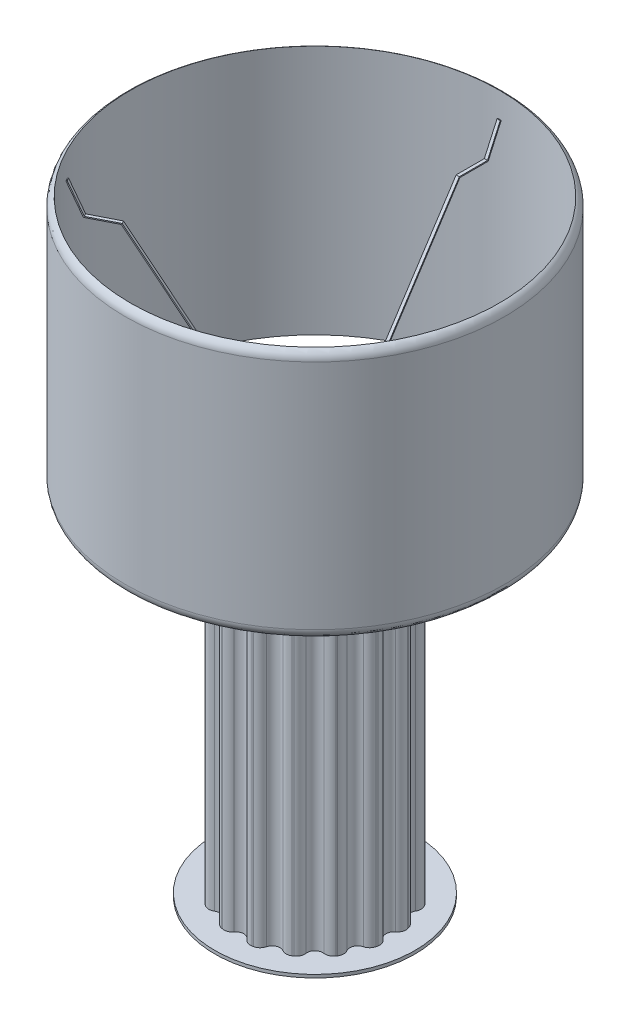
ISO-10303-21;
HEADER;
FILE_DESCRIPTION(('STEP AP214'),'2;1');
FILE_NAME('part.step','',(''),(''),'','','');
FILE_SCHEMA(('AUTOMOTIVE_DESIGN { 1 0 10303 214 1 1 1 1 }'));
ENDSEC;
DATA;
#1=APPLICATION_CONTEXT('core data for automotive mechanical design processes');
#2=APPLICATION_PROTOCOL_DEFINITION('international standard','automotive_design',2000,#1);
#3=PRODUCT_CONTEXT('',#1,'mechanical');
#4=PRODUCT('Part','Part','',(#3));
#5=PRODUCT_RELATED_PRODUCT_CATEGORY('part','',(#4));
#6=PRODUCT_DEFINITION_FORMATION('','',#4);
#7=PRODUCT_DEFINITION_CONTEXT('part definition',#1,'design');
#8=PRODUCT_DEFINITION('design','',#6,#7);
#9=PRODUCT_DEFINITION_SHAPE('','',#8);
#10=(LENGTH_UNIT() NAMED_UNIT(*) SI_UNIT(.MILLI.,.METRE.));
#11=(NAMED_UNIT(*) PLANE_ANGLE_UNIT() SI_UNIT($,.RADIAN.));
#12=(NAMED_UNIT(*) SI_UNIT($,.STERADIAN.) SOLID_ANGLE_UNIT());
#13=UNCERTAINTY_MEASURE_WITH_UNIT(LENGTH_MEASURE(1.E-05),#10,'distance_accuracy_value','');
#14=(GEOMETRIC_REPRESENTATION_CONTEXT(3) GLOBAL_UNCERTAINTY_ASSIGNED_CONTEXT((#13)) GLOBAL_UNIT_ASSIGNED_CONTEXT((#10,
#11,#12)) REPRESENTATION_CONTEXT('',''));
#15=CARTESIAN_POINT('',(0.,0.,0.));
#16=DIRECTION('',(0.,0.,1.));
#17=DIRECTION('',(1.,0.,0.));
#18=AXIS2_PLACEMENT_3D('',#15,#16,#17);
#19=CARTESIAN_POINT('',(-27.9914003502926,-161.683837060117,400.));
#20=DIRECTION('',(0.,-1.,0.));
#21=DIRECTION('',(0.,0.,-1.));
#22=AXIS2_PLACEMENT_3D('',#19,#20,#21);
#23=CYLINDRICAL_SURFACE('',#22,80.);
#24=CARTESIAN_POINT('',(-27.9914003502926,-161.683837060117,400.));
#25=DIRECTION('',(0.,1.,0.));
#26=DIRECTION('',(0.,0.,1.));
#27=AXIS2_PLACEMENT_3D('',#24,#25,#26);
#28=CIRCLE('',#27,80.);
#29=CARTESIAN_POINT('',(-27.9914003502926,-161.683837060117,480.));
#30=VERTEX_POINT('',#29);
#31=EDGE_CURVE('P0_E9',#30,#30,#28,.T.);
#32=ORIENTED_EDGE('',*,*,#31,.F.);
#33=EDGE_LOOP('',(#32));
#34=FACE_BOUND('',#33,.T.);
#35=CARTESIAN_POINT('',(-27.9914003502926,-164.683837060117,400.));
#36=DIRECTION('',(0.,1.,0.));
#37=DIRECTION('',(0.,0.,1.));
#38=AXIS2_PLACEMENT_3D('',#35,#36,#37);
#39=CIRCLE('',#38,80.);
#40=CARTESIAN_POINT('',(-27.9914003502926,-164.683837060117,480.));
#41=VERTEX_POINT('',#40);
#42=EDGE_CURVE('P0_E17',#41,#41,#39,.T.);
#43=ORIENTED_EDGE('',*,*,#42,.T.);
#44=EDGE_LOOP('',(#43));
#45=FACE_BOUND('',#44,.T.);
#46=ADVANCED_FACE('P0_F14',(#34,#45),#23,.T.);
#47=CARTESIAN_POINT('',(-27.9914003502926,-161.683837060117,400.));
#48=DIRECTION('',(0.,1.,0.));
#49=DIRECTION('',(0.,0.,1.));
#50=AXIS2_PLACEMENT_3D('',#47,#48,#49);
#51=PLANE('',#50);
#52=CARTESIAN_POINT('',(-27.9914003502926,-161.683837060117,400.));
#53=DIRECTION('',(0.,1.,0.));
#54=DIRECTION('',(0.,0.,1.));
#55=AXIS2_PLACEMENT_3D('',#52,#53,#54);
#56=CIRCLE('',#55,5.);
#57=CARTESIAN_POINT('',(-27.9914003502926,-161.683837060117,405.));
#58=VERTEX_POINT('',#57);
#59=EDGE_CURVE('P0_E26',#58,#58,#56,.T.);
#60=ORIENTED_EDGE('',*,*,#59,.F.);
#61=EDGE_LOOP('',(#60));
#62=FACE_BOUND('',#61,.T.);
#63=ORIENTED_EDGE('',*,*,#31,.T.);
#64=EDGE_LOOP('',(#63));
#65=FACE_BOUND('',#64,.T.);
#66=ADVANCED_FACE('P0_F41',(#62,#65),#51,.T.);
#67=CARTESIAN_POINT('',(-27.9914003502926,-164.683837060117,400.));
#68=DIRECTION('',(0.,1.,0.));
#69=DIRECTION('',(0.,0.,1.));
#70=AXIS2_PLACEMENT_3D('',#67,#68,#69);
#71=PLANE('',#70);
#72=ORIENTED_EDGE('',*,*,#42,.F.);
#73=EDGE_LOOP('',(#72));
#74=FACE_BOUND('',#73,.T.);
#75=ADVANCED_FACE('P0_F37',(#74),#71,.F.);
#76=CARTESIAN_POINT('',(-27.9914003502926,-111.683837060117,400.));
#77=DIRECTION('',(0.,-1.,0.));
#78=DIRECTION('',(0.,0.,-1.));
#79=AXIS2_PLACEMENT_3D('',#76,#77,#78);
#80=CYLINDRICAL_SURFACE('',#79,5.);
#81=CARTESIAN_POINT('',(-27.9914003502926,-111.683837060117,400.));
#82=DIRECTION('',(0.,1.,0.));
#83=DIRECTION('',(0.,0.,1.));
#84=AXIS2_PLACEMENT_3D('',#81,#82,#83);
#85=CIRCLE('',#84,5.);
#86=CARTESIAN_POINT('',(-27.9914003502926,-111.683837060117,405.));
#87=VERTEX_POINT('',#86);
#88=EDGE_CURVE('P0_E24',#87,#87,#85,.T.);
#89=ORIENTED_EDGE('',*,*,#88,.F.);
#90=EDGE_LOOP('',(#89));
#91=FACE_BOUND('',#90,.T.);
#92=ORIENTED_EDGE('',*,*,#59,.T.);
#93=EDGE_LOOP('',(#92));
#94=FACE_BOUND('',#93,.T.);
#95=ADVANCED_FACE('P0_F34',(#91,#94),#80,.T.);
#96=CARTESIAN_POINT('',(-27.9914003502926,-111.683837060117,400.));
#97=DIRECTION('',(0.,1.,0.));
#98=DIRECTION('',(0.,0.,1.));
#99=AXIS2_PLACEMENT_3D('',#96,#97,#98);
#100=PLANE('',#99);
#101=ORIENTED_EDGE('',*,*,#88,.T.);
#102=EDGE_LOOP('',(#101));
#103=FACE_BOUND('',#102,.T.);
#104=ADVANCED_FACE('P0_F32',(#103),#100,.T.);
#105=CLOSED_SHELL('',(#46,#66,#75,#95,#104));
#106=MANIFOLD_SOLID_BREP('P0_B1',#105);
#107=CARTESIAN_POINT('',(-27.9914003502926,-467.683837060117,466.));
#108=DIRECTION('',(0.,1.,0.));
#109=DIRECTION('',(0.,0.,-1.));
#110=AXIS2_PLACEMENT_3D('',#107,#108,#109);
#111=CONICAL_SURFACE('',#110,10.,0.715584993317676);
#112=CARTESIAN_POINT('',(-27.9914003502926,-471.995955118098,466.));
#113=DIRECTION('',(0.,1.,0.));
#114=DIRECTION('',(0.,0.,1.));
#115=AXIS2_PLACEMENT_3D('',#112,#113,#114);
#116=CIRCLE('',#115,6.25153296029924);
#117=CARTESIAN_POINT('',(-27.9914003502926,-471.995955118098,472.251532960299));
#118=VERTEX_POINT('',#117);
#119=EDGE_CURVE('P1_E10',#118,#118,#116,.T.);
#120=ORIENTED_EDGE('',*,*,#119,.T.);
#121=EDGE_LOOP('',(#120));
#122=FACE_BOUND('',#121,.T.);
#123=CARTESIAN_POINT('',(-27.9914003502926,-467.683837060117,466.));
#124=DIRECTION('',(0.,-1.,0.));
#125=DIRECTION('',(0.,0.,-1.));
#126=AXIS2_PLACEMENT_3D('',#123,#124,#125);
#127=CIRCLE('',#126,10.);
#128=CARTESIAN_POINT('',(-27.9914003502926,-467.683837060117,456.));
#129=VERTEX_POINT('',#128);
#130=EDGE_CURVE('P1_E26',#129,#129,#127,.T.);
#131=ORIENTED_EDGE('',*,*,#130,.T.);
#132=EDGE_LOOP('',(#131));
#133=FACE_BOUND('',#132,.T.);
#134=ADVANCED_FACE('P1_F15',(#122,#133),#111,.T.);
#135=CARTESIAN_POINT('',(-27.9914003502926,-472.683837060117,466.));
#136=DIRECTION('',(0.,-1.,0.));
#137=DIRECTION('',(0.,0.,-1.));
#138=AXIS2_PLACEMENT_3D('',#135,#136,#137);
#139=PLANE('',#138);
#140=CARTESIAN_POINT('',(-27.9914003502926,-472.683837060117,466.));
#141=DIRECTION('',(0.,-1.,0.));
#142=DIRECTION('',(0.,0.,-1.));
#143=AXIS2_PLACEMENT_3D('',#140,#141,#142);
#144=CIRCLE('',#143,4.74211379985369);
#145=CARTESIAN_POINT('',(-27.9914003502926,-472.683837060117,461.257886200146));
#146=VERTEX_POINT('',#145);
#147=EDGE_CURVE('P1_E22',#146,#146,#144,.T.);
#148=ORIENTED_EDGE('',*,*,#147,.T.);
#149=EDGE_LOOP('',(#148));
#150=FACE_BOUND('',#149,.T.);
#151=ADVANCED_FACE('P1_F36',(#150),#139,.T.);
#152=CARTESIAN_POINT('',(-27.9914003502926,-467.683837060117,466.));
#153=DIRECTION('',(0.,-1.,0.));
#154=DIRECTION('',(0.,0.,-1.));
#155=AXIS2_PLACEMENT_3D('',#152,#153,#154);
#156=PLANE('',#155);
#157=ORIENTED_EDGE('',*,*,#130,.F.);
#158=EDGE_LOOP('',(#157));
#159=FACE_BOUND('',#158,.T.);
#160=ADVANCED_FACE('P1_F34',(#159),#156,.F.);
#161=CARTESIAN_POINT('',(-27.9914003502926,-470.683837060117,466.));
#162=DIRECTION('',(0.,-1.,0.));
#163=DIRECTION('',(0.,0.,-1.));
#164=AXIS2_PLACEMENT_3D('',#161,#162,#163);
#165=TOROIDAL_SURFACE('',#164,4.74211379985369,2.);
#166=ORIENTED_EDGE('',*,*,#119,.F.);
#167=EDGE_LOOP('',(#166));
#168=FACE_BOUND('',#167,.T.);
#169=ORIENTED_EDGE('',*,*,#147,.F.);
#170=EDGE_LOOP('',(#169));
#171=FACE_BOUND('',#170,.T.);
#172=ADVANCED_FACE('P1_F17',(#168,#171),#165,.T.);
#173=CLOSED_SHELL('',(#134,#151,#160,#172));
#174=MANIFOLD_SOLID_BREP('P1_B1',#173);
#175=CARTESIAN_POINT('',(22.3932587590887,-467.683837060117,357.369188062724));
#176=DIRECTION('',(0.,1.,0.));
#177=DIRECTION('',(0.,0.,-1.));
#178=AXIS2_PLACEMENT_3D('',#175,#176,#177);
#179=CONICAL_SURFACE('',#178,10.,0.715584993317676);
#180=CARTESIAN_POINT('',(22.3932587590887,-471.995955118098,357.369188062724));
#181=DIRECTION('',(0.,1.,0.));
#182=DIRECTION('',(0.,0.,1.));
#183=AXIS2_PLACEMENT_3D('',#180,#181,#182);
#184=CIRCLE('',#183,6.25153296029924);
#185=CARTESIAN_POINT('',(22.3932587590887,-471.995955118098,363.620721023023));
#186=VERTEX_POINT('',#185);
#187=EDGE_CURVE('P2_E10',#186,#186,#184,.T.);
#188=ORIENTED_EDGE('',*,*,#187,.T.);
#189=EDGE_LOOP('',(#188));
#190=FACE_BOUND('',#189,.T.);
#191=CARTESIAN_POINT('',(22.3932587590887,-467.683837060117,357.369188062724));
#192=DIRECTION('',(0.,-1.,0.));
#193=DIRECTION('',(0.,0.,-1.));
#194=AXIS2_PLACEMENT_3D('',#191,#192,#193);
#195=CIRCLE('',#194,10.);
#196=CARTESIAN_POINT('',(22.3932587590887,-467.683837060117,347.369188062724));
#197=VERTEX_POINT('',#196);
#198=EDGE_CURVE('P2_E26',#197,#197,#195,.T.);
#199=ORIENTED_EDGE('',*,*,#198,.T.);
#200=EDGE_LOOP('',(#199));
#201=FACE_BOUND('',#200,.T.);
#202=ADVANCED_FACE('P2_F15',(#190,#201),#179,.T.);
#203=CARTESIAN_POINT('',(22.3932587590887,-472.683837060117,357.369188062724));
#204=DIRECTION('',(0.,-1.,0.));
#205=DIRECTION('',(0.,0.,-1.));
#206=AXIS2_PLACEMENT_3D('',#203,#204,#205);
#207=PLANE('',#206);
#208=CARTESIAN_POINT('',(22.3932587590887,-472.683837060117,357.369188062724));
#209=DIRECTION('',(0.,-1.,0.));
#210=DIRECTION('',(0.,0.,-1.));
#211=AXIS2_PLACEMENT_3D('',#208,#209,#210);
#212=CIRCLE('',#211,4.74211379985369);
#213=CARTESIAN_POINT('',(22.3932587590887,-472.683837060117,352.62707426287));
#214=VERTEX_POINT('',#213);
#215=EDGE_CURVE('P2_E22',#214,#214,#212,.T.);
#216=ORIENTED_EDGE('',*,*,#215,.T.);
#217=EDGE_LOOP('',(#216));
#218=FACE_BOUND('',#217,.T.);
#219=ADVANCED_FACE('P2_F36',(#218),#207,.T.);
#220=CARTESIAN_POINT('',(22.3932587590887,-467.683837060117,357.369188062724));
#221=DIRECTION('',(0.,-1.,0.));
#222=DIRECTION('',(0.,0.,-1.));
#223=AXIS2_PLACEMENT_3D('',#220,#221,#222);
#224=PLANE('',#223);
#225=ORIENTED_EDGE('',*,*,#198,.F.);
#226=EDGE_LOOP('',(#225));
#227=FACE_BOUND('',#226,.T.);
#228=ADVANCED_FACE('P2_F34',(#227),#224,.F.);
#229=CARTESIAN_POINT('',(22.3932587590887,-470.683837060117,357.369188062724));
#230=DIRECTION('',(0.,-1.,0.));
#231=DIRECTION('',(0.,0.,-1.));
#232=AXIS2_PLACEMENT_3D('',#229,#230,#231);
#233=TOROIDAL_SURFACE('',#232,4.74211379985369,2.);
#234=ORIENTED_EDGE('',*,*,#187,.F.);
#235=EDGE_LOOP('',(#234));
#236=FACE_BOUND('',#235,.T.);
#237=ORIENTED_EDGE('',*,*,#215,.F.);
#238=EDGE_LOOP('',(#237));
#239=FACE_BOUND('',#238,.T.);
#240=ADVANCED_FACE('P2_F17',(#236,#239),#233,.T.);
#241=CLOSED_SHELL('',(#202,#219,#228,#240));
#242=MANIFOLD_SOLID_BREP('P2_B1',#241);
#243=CARTESIAN_POINT('',(-78.3047212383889,-467.683837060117,357.285017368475));
#244=DIRECTION('',(0.,1.,0.));
#245=DIRECTION('',(0.,0.,-1.));
#246=AXIS2_PLACEMENT_3D('',#243,#244,#245);
#247=CONICAL_SURFACE('',#246,10.,0.715584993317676);
#248=CARTESIAN_POINT('',(-78.3047212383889,-471.995955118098,357.285017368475));
#249=DIRECTION('',(0.,1.,0.));
#250=DIRECTION('',(0.,0.,1.));
#251=AXIS2_PLACEMENT_3D('',#248,#249,#250);
#252=CIRCLE('',#251,6.25153296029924);
#253=CARTESIAN_POINT('',(-78.3047212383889,-471.995955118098,363.536550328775));
#254=VERTEX_POINT('',#253);
#255=EDGE_CURVE('P3_E10',#254,#254,#252,.T.);
#256=ORIENTED_EDGE('',*,*,#255,.T.);
#257=EDGE_LOOP('',(#256));
#258=FACE_BOUND('',#257,.T.);
#259=CARTESIAN_POINT('',(-78.3047212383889,-467.683837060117,357.285017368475));
#260=DIRECTION('',(0.,-1.,0.));
#261=DIRECTION('',(0.,0.,-1.));
#262=AXIS2_PLACEMENT_3D('',#259,#260,#261);
#263=CIRCLE('',#262,10.);
#264=CARTESIAN_POINT('',(-78.3047212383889,-467.683837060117,347.285017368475));
#265=VERTEX_POINT('',#264);
#266=EDGE_CURVE('P3_E26',#265,#265,#263,.T.);
#267=ORIENTED_EDGE('',*,*,#266,.T.);
#268=EDGE_LOOP('',(#267));
#269=FACE_BOUND('',#268,.T.);
#270=ADVANCED_FACE('P3_F15',(#258,#269),#247,.T.);
#271=CARTESIAN_POINT('',(-78.3047212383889,-472.683837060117,357.285017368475));
#272=DIRECTION('',(0.,-1.,0.));
#273=DIRECTION('',(0.,0.,-1.));
#274=AXIS2_PLACEMENT_3D('',#271,#272,#273);
#275=PLANE('',#274);
#276=CARTESIAN_POINT('',(-78.3047212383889,-472.683837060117,357.285017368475));
#277=DIRECTION('',(0.,-1.,0.));
#278=DIRECTION('',(0.,0.,-1.));
#279=AXIS2_PLACEMENT_3D('',#276,#277,#278);
#280=CIRCLE('',#279,4.74211379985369);
#281=CARTESIAN_POINT('',(-78.3047212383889,-472.683837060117,352.542903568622));
#282=VERTEX_POINT('',#281);
#283=EDGE_CURVE('P3_E22',#282,#282,#280,.T.);
#284=ORIENTED_EDGE('',*,*,#283,.T.);
#285=EDGE_LOOP('',(#284));
#286=FACE_BOUND('',#285,.T.);
#287=ADVANCED_FACE('P3_F36',(#286),#275,.T.);
#288=CARTESIAN_POINT('',(-78.3047212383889,-467.683837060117,357.285017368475));
#289=DIRECTION('',(0.,-1.,0.));
#290=DIRECTION('',(0.,0.,-1.));
#291=AXIS2_PLACEMENT_3D('',#288,#289,#290);
#292=PLANE('',#291);
#293=ORIENTED_EDGE('',*,*,#266,.F.);
#294=EDGE_LOOP('',(#293));
#295=FACE_BOUND('',#294,.T.);
#296=ADVANCED_FACE('P3_F34',(#295),#292,.F.);
#297=CARTESIAN_POINT('',(-78.3047212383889,-470.683837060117,357.285017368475));
#298=DIRECTION('',(0.,-1.,0.));
#299=DIRECTION('',(0.,0.,-1.));
#300=AXIS2_PLACEMENT_3D('',#297,#298,#299);
#301=TOROIDAL_SURFACE('',#300,4.74211379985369,2.);
#302=ORIENTED_EDGE('',*,*,#255,.F.);
#303=EDGE_LOOP('',(#302));
#304=FACE_BOUND('',#303,.T.);
#305=ORIENTED_EDGE('',*,*,#283,.F.);
#306=EDGE_LOOP('',(#305));
#307=FACE_BOUND('',#306,.T.);
#308=ADVANCED_FACE('P3_F17',(#304,#307),#301,.T.);
#309=CLOSED_SHELL('',(#270,#287,#296,#308));
#310=MANIFOLD_SOLID_BREP('P3_B1',#309);
#311=CARTESIAN_POINT('',(-27.9914003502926,-467.683837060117,400.));
#312=DIRECTION('',(0.,1.,0.));
#313=DIRECTION('',(0.,0.,1.));
#314=AXIS2_PLACEMENT_3D('',#311,#312,#313);
#315=CYLINDRICAL_SURFACE('',#314,95.);
#316=CARTESIAN_POINT('',(-27.9914003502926,-467.683837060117,400.));
#317=DIRECTION('',(0.,-1.,0.));
#318=DIRECTION('',(0.,0.,-1.));
#319=AXIS2_PLACEMENT_3D('',#316,#317,#318);
#320=CIRCLE('',#319,95.);
#321=CARTESIAN_POINT('',(-27.9914003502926,-467.683837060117,305.));
#322=VERTEX_POINT('',#321);
#323=EDGE_CURVE('P4_E10',#322,#322,#320,.T.);
#324=ORIENTED_EDGE('',*,*,#323,.F.);
#325=EDGE_LOOP('',(#324));
#326=FACE_BOUND('',#325,.T.);
#327=CARTESIAN_POINT('',(-27.9914003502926,-464.683837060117,400.));
#328=DIRECTION('',(0.,-1.,0.));
#329=DIRECTION('',(0.,0.,-1.));
#330=AXIS2_PLACEMENT_3D('',#327,#328,#329);
#331=CIRCLE('',#330,95.);
#332=CARTESIAN_POINT('',(-27.9914003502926,-464.683837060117,305.));
#333=VERTEX_POINT('',#332);
#334=EDGE_CURVE('P4_E18',#333,#333,#331,.T.);
#335=ORIENTED_EDGE('',*,*,#334,.T.);
#336=EDGE_LOOP('',(#335));
#337=FACE_BOUND('',#336,.T.);
#338=ADVANCED_FACE('P4_F15',(#326,#337),#315,.T.);
#339=CARTESIAN_POINT('',(-27.9914003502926,-467.683837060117,400.));
#340=DIRECTION('',(0.,-1.,0.));
#341=DIRECTION('',(0.,0.,-1.));
#342=AXIS2_PLACEMENT_3D('',#339,#340,#341);
#343=PLANE('',#342);
#344=ORIENTED_EDGE('',*,*,#323,.T.);
#345=EDGE_LOOP('',(#344));
#346=FACE_BOUND('',#345,.T.);
#347=ADVANCED_FACE('P4_F30',(#346),#343,.T.);
#348=CARTESIAN_POINT('',(-27.9914003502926,-464.683837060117,400.));
#349=DIRECTION('',(0.,-1.,0.));
#350=DIRECTION('',(0.,0.,-1.));
#351=AXIS2_PLACEMENT_3D('',#348,#349,#350);
#352=PLANE('',#351);
#353=ORIENTED_EDGE('',*,*,#334,.F.);
#354=EDGE_LOOP('',(#353));
#355=FACE_BOUND('',#354,.T.);
#356=ADVANCED_FACE('P4_F28',(#355),#352,.F.);
#357=CLOSED_SHELL('',(#338,#347,#356));
#358=MANIFOLD_SOLID_BREP('P4_B1',#357);
#359=CARTESIAN_POINT('',(-27.9914003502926,-164.683837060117,400.));
#360=DIRECTION('',(0.,-1.,0.));
#361=DIRECTION('',(0.,0.,-1.));
#362=AXIS2_PLACEMENT_3D('',#359,#360,#361);
#363=CYLINDRICAL_SURFACE('',#362,75.);
#364=CARTESIAN_POINT('',(-27.9914003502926,-164.683837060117,400.));
#365=DIRECTION('',(0.,1.,0.));
#366=DIRECTION('',(0.,0.,1.));
#367=AXIS2_PLACEMENT_3D('',#364,#365,#366);
#368=CIRCLE('',#367,75.);
#369=CARTESIAN_POINT('',(13.126458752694,-164.683837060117,462.724171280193));
#370=VERTEX_POINT('',#369);
#371=CARTESIAN_POINT('',(14.2230542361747,-164.683837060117,461.991449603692));
#372=VERTEX_POINT('',#371);
#373=EDGE_CURVE('P5_E831',#370,#372,#368,.T.);
#374=ORIENTED_EDGE('',*,*,#373,.F.);
#375=DIRECTION('',(0.,-1.,0.));
#376=VECTOR('',#375,1.);
#377=CARTESIAN_POINT('',(13.126458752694,-164.683837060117,462.724171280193));
#378=LINE('',#377,#376);
#379=CARTESIAN_POINT('',(13.126458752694,-464.683837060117,462.724171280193));
#380=VERTEX_POINT('',#379);
#381=EDGE_CURVE('P5_E666',#370,#380,#378,.T.);
#382=ORIENTED_EDGE('',*,*,#381,.T.);
#383=CARTESIAN_POINT('',(-27.9914003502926,-464.683837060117,400.));
#384=DIRECTION('',(0.,1.,0.));
#385=DIRECTION('',(0.,0.,1.));
#386=AXIS2_PLACEMENT_3D('',#383,#384,#385);
#387=CIRCLE('',#386,75.);
#388=CARTESIAN_POINT('',(14.2230542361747,-464.683837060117,461.991449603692));
#389=VERTEX_POINT('',#388);
#390=EDGE_CURVE('P5_E828',#380,#389,#387,.T.);
#391=ORIENTED_EDGE('',*,*,#390,.T.);
#392=DIRECTION('',(0.,-1.,0.));
#393=VECTOR('',#392,1.);
#394=CARTESIAN_POINT('',(14.2230542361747,-164.683837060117,461.991449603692));
#395=LINE('',#394,#393);
#396=EDGE_CURVE('P5_E498',#389,#372,#395,.F.);
#397=ORIENTED_EDGE('',*,*,#396,.T.);
#398=EDGE_LOOP('',(#374,#382,#391,#397));
#399=FACE_BOUND('',#398,.T.);
#400=ADVANCED_FACE('P5_F17',(#399),#363,.T.);
#401=CARTESIAN_POINT('',(34.0000492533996,-164.683837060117,442.214454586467));
#402=VERTEX_POINT('',#401);
#403=CARTESIAN_POINT('',(34.7327709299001,-164.683837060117,441.117859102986));
#404=VERTEX_POINT('',#403);
#405=EDGE_CURVE('P5_E1531',#402,#404,#368,.T.);
#406=ORIENTED_EDGE('',*,*,#405,.F.);
#407=DIRECTION('',(0.,-1.,0.));
#408=VECTOR('',#407,1.);
#409=CARTESIAN_POINT('',(34.0000492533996,-164.683837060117,442.214454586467));
#410=LINE('',#409,#408);
#411=CARTESIAN_POINT('',(34.0000492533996,-464.683837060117,442.214454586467));
#412=VERTEX_POINT('',#411);
#413=EDGE_CURVE('P5_E675',#402,#412,#410,.T.);
#414=ORIENTED_EDGE('',*,*,#413,.T.);
#415=CARTESIAN_POINT('',(34.7327709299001,-464.683837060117,441.117859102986));
#416=VERTEX_POINT('',#415);
#417=EDGE_CURVE('P5_E1543',#412,#416,#387,.T.);
#418=ORIENTED_EDGE('',*,*,#417,.T.);
#419=DIRECTION('',(0.,-1.,0.));
#420=VECTOR('',#419,1.);
#421=CARTESIAN_POINT('',(34.7327709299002,-164.683837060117,441.117859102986));
#422=LINE('',#421,#420);
#423=EDGE_CURVE('P5_E510',#416,#404,#422,.F.);
#424=ORIENTED_EDGE('',*,*,#423,.T.);
#425=EDGE_LOOP('',(#406,#414,#418,#424));
#426=FACE_BOUND('',#425,.T.);
#427=ADVANCED_FACE('P5_F913',(#426),#363,.T.);
#428=CARTESIAN_POINT('',(45.436003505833,-164.683837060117,415.277969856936));
#429=VERTEX_POINT('',#428);
#430=CARTESIAN_POINT('',(45.6933011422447,-164.683837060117,413.984447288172));
#431=VERTEX_POINT('',#430);
#432=EDGE_CURVE('P5_E1526',#429,#431,#368,.T.);
#433=ORIENTED_EDGE('',*,*,#432,.F.);
#434=DIRECTION('',(0.,-1.,0.));
#435=VECTOR('',#434,1.);
#436=CARTESIAN_POINT('',(45.436003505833,-164.683837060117,415.277969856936));
#437=LINE('',#436,#435);
#438=CARTESIAN_POINT('',(45.436003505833,-464.683837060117,415.277969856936));
#439=VERTEX_POINT('',#438);
#440=EDGE_CURVE('P5_E684',#429,#439,#437,.T.);
#441=ORIENTED_EDGE('',*,*,#440,.T.);
#442=CARTESIAN_POINT('',(45.6933011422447,-464.683837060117,413.984447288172));
#443=VERTEX_POINT('',#442);
#444=EDGE_CURVE('P5_E1536',#439,#443,#387,.T.);
#445=ORIENTED_EDGE('',*,*,#444,.T.);
#446=DIRECTION('',(0.,-1.,0.));
#447=VECTOR('',#446,1.);
#448=CARTESIAN_POINT('',(45.6933011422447,-164.683837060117,413.984447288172));
#449=LINE('',#448,#447);
#450=EDGE_CURVE('P5_E522',#443,#431,#449,.F.);
#451=ORIENTED_EDGE('',*,*,#450,.T.);
#452=EDGE_LOOP('',(#433,#441,#445,#451));
#453=FACE_BOUND('',#452,.T.);
#454=ADVANCED_FACE('P5_F918',(#453),#363,.T.);
#455=CARTESIAN_POINT('',(45.6933011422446,-164.683837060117,386.015552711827));
#456=VERTEX_POINT('',#455);
#457=CARTESIAN_POINT('',(45.4360035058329,-164.683837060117,384.722030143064));
#458=VERTEX_POINT('',#457);
#459=EDGE_CURVE('P5_E1532',#456,#458,#368,.T.);
#460=ORIENTED_EDGE('',*,*,#459,.F.);
#461=DIRECTION('',(0.,-1.,0.));
#462=VECTOR('',#461,1.);
#463=CARTESIAN_POINT('',(45.6933011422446,-164.683837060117,386.015552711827));
#464=LINE('',#463,#462);
#465=CARTESIAN_POINT('',(45.6933011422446,-464.683837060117,386.015552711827));
#466=VERTEX_POINT('',#465);
#467=EDGE_CURVE('P5_E693',#456,#466,#464,.T.);
#468=ORIENTED_EDGE('',*,*,#467,.T.);
#469=CARTESIAN_POINT('',(45.4360035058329,-464.683837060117,384.722030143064));
#470=VERTEX_POINT('',#469);
#471=EDGE_CURVE('P5_E1545',#466,#470,#387,.T.);
#472=ORIENTED_EDGE('',*,*,#471,.T.);
#473=DIRECTION('',(0.,-1.,0.));
#474=VECTOR('',#473,1.);
#475=CARTESIAN_POINT('',(45.4360035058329,-164.683837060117,384.722030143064));
#476=LINE('',#475,#474);
#477=EDGE_CURVE('P5_E534',#470,#458,#476,.F.);
#478=ORIENTED_EDGE('',*,*,#477,.T.);
#479=EDGE_LOOP('',(#460,#468,#472,#478));
#480=FACE_BOUND('',#479,.T.);
#481=ADVANCED_FACE('P5_F1489',(#480),#363,.T.);
#482=CARTESIAN_POINT('',(34.7327709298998,-164.683837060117,358.882140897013));
#483=VERTEX_POINT('',#482);
#484=CARTESIAN_POINT('',(34.0000492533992,-164.683837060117,357.785545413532));
#485=VERTEX_POINT('',#484);
#486=EDGE_CURVE('P5_E1598',#483,#485,#368,.T.);
#487=ORIENTED_EDGE('',*,*,#486,.F.);
#488=DIRECTION('',(0.,-1.,0.));
#489=VECTOR('',#488,1.);
#490=CARTESIAN_POINT('',(34.7327709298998,-164.683837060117,358.882140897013));
#491=LINE('',#490,#489);
#492=CARTESIAN_POINT('',(34.7327709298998,-464.683837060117,358.882140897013));
#493=VERTEX_POINT('',#492);
#494=EDGE_CURVE('P5_E702',#483,#493,#491,.T.);
#495=ORIENTED_EDGE('',*,*,#494,.T.);
#496=CARTESIAN_POINT('',(34.0000492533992,-464.683837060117,357.785545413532));
#497=VERTEX_POINT('',#496);
#498=EDGE_CURVE('P5_E1546',#493,#497,#387,.T.);
#499=ORIENTED_EDGE('',*,*,#498,.T.);
#500=DIRECTION('',(0.,-1.,0.));
#501=VECTOR('',#500,1.);
#502=CARTESIAN_POINT('',(34.0000492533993,-164.683837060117,357.785545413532));
#503=LINE('',#502,#501);
#504=EDGE_CURVE('P5_E546',#497,#485,#503,.F.);
#505=ORIENTED_EDGE('',*,*,#504,.T.);
#506=EDGE_LOOP('',(#487,#495,#499,#505));
#507=FACE_BOUND('',#506,.T.);
#508=ADVANCED_FACE('P5_F1481',(#507),#363,.T.);
#509=CARTESIAN_POINT('',(14.2230542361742,-164.683837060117,338.008550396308));
#510=VERTEX_POINT('',#509);
#511=CARTESIAN_POINT('',(13.1264587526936,-164.683837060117,337.275828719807));
#512=VERTEX_POINT('',#511);
#513=EDGE_CURVE('P5_E1595',#510,#512,#368,.T.);
#514=ORIENTED_EDGE('',*,*,#513,.F.);
#515=DIRECTION('',(0.,-1.,0.));
#516=VECTOR('',#515,1.);
#517=CARTESIAN_POINT('',(14.2230542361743,-164.683837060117,338.008550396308));
#518=LINE('',#517,#516);
#519=CARTESIAN_POINT('',(14.2230542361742,-464.683837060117,338.008550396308));
#520=VERTEX_POINT('',#519);
#521=EDGE_CURVE('P5_E711',#510,#520,#518,.T.);
#522=ORIENTED_EDGE('',*,*,#521,.T.);
#523=CARTESIAN_POINT('',(13.1264587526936,-464.683837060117,337.275828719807));
#524=VERTEX_POINT('',#523);
#525=EDGE_CURVE('P5_E1548',#520,#524,#387,.T.);
#526=ORIENTED_EDGE('',*,*,#525,.T.);
#527=DIRECTION('',(0.,-1.,0.));
#528=VECTOR('',#527,1.);
#529=CARTESIAN_POINT('',(13.1264587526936,-164.683837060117,337.275828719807));
#530=LINE('',#529,#528);
#531=EDGE_CURVE('P5_E558',#524,#512,#530,.F.);
#532=ORIENTED_EDGE('',*,*,#531,.T.);
#533=EDGE_LOOP('',(#514,#522,#526,#532));
#534=FACE_BOUND('',#533,.T.);
#535=ADVANCED_FACE('P5_F1473',(#534),#363,.T.);
#536=CARTESIAN_POINT('',(-12.7134304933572,-164.683837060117,326.572596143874));
#537=VERTEX_POINT('',#536);
#538=CARTESIAN_POINT('',(-14.0069530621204,-164.683837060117,326.315298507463));
#539=VERTEX_POINT('',#538);
#540=EDGE_CURVE('P5_E1594',#537,#539,#368,.T.);
#541=ORIENTED_EDGE('',*,*,#540,.F.);
#542=DIRECTION('',(0.,-1.,0.));
#543=VECTOR('',#542,1.);
#544=CARTESIAN_POINT('',(-12.7134304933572,-164.683837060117,326.572596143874));
#545=LINE('',#544,#543);
#546=CARTESIAN_POINT('',(-12.7134304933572,-464.683837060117,326.572596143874));
#547=VERTEX_POINT('',#546);
#548=EDGE_CURVE('P5_E720',#537,#547,#545,.T.);
#549=ORIENTED_EDGE('',*,*,#548,.T.);
#550=CARTESIAN_POINT('',(-14.0069530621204,-464.683837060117,326.315298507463));
#551=VERTEX_POINT('',#550);
#552=EDGE_CURVE('P5_E1550',#547,#551,#387,.T.);
#553=ORIENTED_EDGE('',*,*,#552,.T.);
#554=DIRECTION('',(0.,-1.,0.));
#555=VECTOR('',#554,1.);
#556=CARTESIAN_POINT('',(-14.0069530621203,-164.683837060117,326.315298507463));
#557=LINE('',#556,#555);
#558=EDGE_CURVE('P5_E570',#551,#539,#557,.F.);
#559=ORIENTED_EDGE('',*,*,#558,.T.);
#560=EDGE_LOOP('',(#541,#549,#553,#559));
#561=FACE_BOUND('',#560,.T.);
#562=ADVANCED_FACE('P5_F1465',(#561),#363,.T.);
#563=CARTESIAN_POINT('',(-41.9758476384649,-164.683837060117,326.315298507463));
#564=VERTEX_POINT('',#563);
#565=CARTESIAN_POINT('',(-43.2693702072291,-164.683837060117,326.572596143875));
#566=VERTEX_POINT('',#565);
#567=EDGE_CURVE('P5_E888',#564,#566,#368,.T.);
#568=ORIENTED_EDGE('',*,*,#567,.F.);
#569=DIRECTION('',(0.,-1.,0.));
#570=VECTOR('',#569,1.);
#571=CARTESIAN_POINT('',(-41.9758476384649,-164.683837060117,326.315298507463));
#572=LINE('',#571,#570);
#573=CARTESIAN_POINT('',(-41.9758476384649,-464.683837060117,326.315298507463));
#574=VERTEX_POINT('',#573);
#575=EDGE_CURVE('P5_E729',#564,#574,#572,.T.);
#576=ORIENTED_EDGE('',*,*,#575,.T.);
#577=CARTESIAN_POINT('',(-43.2693702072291,-464.683837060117,326.572596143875));
#578=VERTEX_POINT('',#577);
#579=EDGE_CURVE('P5_E1552',#574,#578,#387,.T.);
#580=ORIENTED_EDGE('',*,*,#579,.T.);
#581=DIRECTION('',(0.,-1.,0.));
#582=VECTOR('',#581,1.);
#583=CARTESIAN_POINT('',(-43.2693702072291,-164.683837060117,326.572596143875));
#584=LINE('',#583,#582);
#585=EDGE_CURVE('P5_E582',#578,#566,#584,.F.);
#586=ORIENTED_EDGE('',*,*,#585,.T.);
#587=EDGE_LOOP('',(#568,#576,#580,#586));
#588=FACE_BOUND('',#587,.T.);
#589=ADVANCED_FACE('P5_F1457',(#588),#363,.T.);
#590=CARTESIAN_POINT('',(-69.1092594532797,-164.683837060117,337.275828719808));
#591=VERTEX_POINT('',#590);
#592=CARTESIAN_POINT('',(-70.2058549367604,-164.683837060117,338.008550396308));
#593=VERTEX_POINT('',#592);
#594=EDGE_CURVE('P5_E871',#591,#593,#368,.T.);
#595=ORIENTED_EDGE('',*,*,#594,.F.);
#596=DIRECTION('',(0.,-1.,0.));
#597=VECTOR('',#596,1.);
#598=CARTESIAN_POINT('',(-69.1092594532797,-164.683837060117,337.275828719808));
#599=LINE('',#598,#597);
#600=CARTESIAN_POINT('',(-69.1092594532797,-464.683837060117,337.275828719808));
#601=VERTEX_POINT('',#600);
#602=EDGE_CURVE('P5_E738',#591,#601,#599,.T.);
#603=ORIENTED_EDGE('',*,*,#602,.T.);
#604=CARTESIAN_POINT('',(-70.2058549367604,-464.683837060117,338.008550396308));
#605=VERTEX_POINT('',#604);
#606=EDGE_CURVE('P5_E876',#601,#605,#387,.T.);
#607=ORIENTED_EDGE('',*,*,#606,.T.);
#608=DIRECTION('',(0.,-1.,0.));
#609=VECTOR('',#608,1.);
#610=CARTESIAN_POINT('',(-70.2058549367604,-164.683837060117,338.008550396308));
#611=LINE('',#610,#609);
#612=EDGE_CURVE('P5_E594',#605,#593,#611,.F.);
#613=ORIENTED_EDGE('',*,*,#612,.T.);
#614=EDGE_LOOP('',(#595,#603,#607,#613));
#615=FACE_BOUND('',#614,.T.);
#616=ADVANCED_FACE('P5_F1450',(#615),#363,.T.);
#617=CARTESIAN_POINT('',(-89.9828499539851,-164.683837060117,357.785545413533));
#618=VERTEX_POINT('',#617);
#619=CARTESIAN_POINT('',(-90.7155716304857,-164.683837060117,358.882140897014));
#620=VERTEX_POINT('',#619);
#621=EDGE_CURVE('P5_E882',#618,#620,#368,.T.);
#622=ORIENTED_EDGE('',*,*,#621,.F.);
#623=DIRECTION('',(0.,-1.,0.));
#624=VECTOR('',#623,1.);
#625=CARTESIAN_POINT('',(-89.9828499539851,-164.683837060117,357.785545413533));
#626=LINE('',#625,#624);
#627=CARTESIAN_POINT('',(-89.9828499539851,-464.683837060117,357.785545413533));
#628=VERTEX_POINT('',#627);
#629=EDGE_CURVE('P5_E747',#618,#628,#626,.T.);
#630=ORIENTED_EDGE('',*,*,#629,.T.);
#631=CARTESIAN_POINT('',(-90.7155716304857,-464.683837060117,358.882140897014));
#632=VERTEX_POINT('',#631);
#633=EDGE_CURVE('P5_E1555',#628,#632,#387,.T.);
#634=ORIENTED_EDGE('',*,*,#633,.T.);
#635=DIRECTION('',(0.,-1.,0.));
#636=VECTOR('',#635,1.);
#637=CARTESIAN_POINT('',(-90.7155716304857,-164.683837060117,358.882140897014));
#638=LINE('',#637,#636);
#639=EDGE_CURVE('P5_E606',#632,#620,#638,.F.);
#640=ORIENTED_EDGE('',*,*,#639,.T.);
#641=EDGE_LOOP('',(#622,#630,#634,#640));
#642=FACE_BOUND('',#641,.T.);
#643=ADVANCED_FACE('P5_F885',(#642),#363,.T.);
#644=CARTESIAN_POINT('',(-101.418804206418,-164.683837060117,384.722030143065));
#645=VERTEX_POINT('',#644);
#646=CARTESIAN_POINT('',(-101.67610184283,-164.683837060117,386.015552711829));
#647=VERTEX_POINT('',#646);
#648=EDGE_CURVE('P5_E887',#645,#647,#368,.T.);
#649=ORIENTED_EDGE('',*,*,#648,.F.);
#650=DIRECTION('',(0.,-1.,0.));
#651=VECTOR('',#650,1.);
#652=CARTESIAN_POINT('',(-101.418804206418,-164.683837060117,384.722030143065));
#653=LINE('',#652,#651);
#654=CARTESIAN_POINT('',(-101.418804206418,-464.683837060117,384.722030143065));
#655=VERTEX_POINT('',#654);
#656=EDGE_CURVE('P5_E756',#645,#655,#653,.T.);
#657=ORIENTED_EDGE('',*,*,#656,.T.);
#658=CARTESIAN_POINT('',(-101.67610184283,-464.683837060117,386.015552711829));
#659=VERTEX_POINT('',#658);
#660=EDGE_CURVE('P5_E826',#655,#659,#387,.T.);
#661=ORIENTED_EDGE('',*,*,#660,.T.);
#662=DIRECTION('',(0.,-1.,0.));
#663=VECTOR('',#662,1.);
#664=CARTESIAN_POINT('',(-101.67610184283,-164.683837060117,386.015552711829));
#665=LINE('',#664,#663);
#666=EDGE_CURVE('P5_E618',#659,#647,#665,.F.);
#667=ORIENTED_EDGE('',*,*,#666,.T.);
#668=EDGE_LOOP('',(#649,#657,#661,#667));
#669=FACE_BOUND('',#668,.T.);
#670=ADVANCED_FACE('P5_F908',(#669),#363,.T.);
#671=CARTESIAN_POINT('',(-101.67610184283,-164.683837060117,413.984447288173));
#672=VERTEX_POINT('',#671);
#673=CARTESIAN_POINT('',(-101.418804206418,-164.683837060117,415.277969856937));
#674=VERTEX_POINT('',#673);
#675=EDGE_CURVE('P5_E889',#672,#674,#368,.T.);
#676=ORIENTED_EDGE('',*,*,#675,.F.);
#677=DIRECTION('',(0.,-1.,0.));
#678=VECTOR('',#677,1.);
#679=CARTESIAN_POINT('',(-101.67610184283,-164.683837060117,413.984447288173));
#680=LINE('',#679,#678);
#681=CARTESIAN_POINT('',(-101.67610184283,-464.683837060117,413.984447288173));
#682=VERTEX_POINT('',#681);
#683=EDGE_CURVE('P5_E765',#672,#682,#680,.T.);
#684=ORIENTED_EDGE('',*,*,#683,.T.);
#685=CARTESIAN_POINT('',(-101.418804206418,-464.683837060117,415.277969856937));
#686=VERTEX_POINT('',#685);
#687=EDGE_CURVE('P5_E825',#682,#686,#387,.T.);
#688=ORIENTED_EDGE('',*,*,#687,.T.);
#689=DIRECTION('',(0.,-1.,0.));
#690=VECTOR('',#689,1.);
#691=CARTESIAN_POINT('',(-101.418804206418,-164.683837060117,415.277969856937));
#692=LINE('',#691,#690);
#693=EDGE_CURVE('P5_E630',#686,#674,#692,.F.);
#694=ORIENTED_EDGE('',*,*,#693,.T.);
#695=EDGE_LOOP('',(#676,#684,#688,#694));
#696=FACE_BOUND('',#695,.T.);
#697=ADVANCED_FACE('P5_F900',(#696),#363,.T.);
#698=CARTESIAN_POINT('',(-90.7155716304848,-164.683837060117,441.117859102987));
#699=VERTEX_POINT('',#698);
#700=CARTESIAN_POINT('',(-89.9828499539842,-164.683837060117,442.214454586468));
#701=VERTEX_POINT('',#700);
#702=EDGE_CURVE('P5_E808',#699,#701,#368,.T.);
#703=ORIENTED_EDGE('',*,*,#702,.F.);
#704=DIRECTION('',(0.,-1.,0.));
#705=VECTOR('',#704,1.);
#706=CARTESIAN_POINT('',(-90.7155716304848,-164.683837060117,441.117859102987));
#707=LINE('',#706,#705);
#708=CARTESIAN_POINT('',(-90.7155716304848,-464.683837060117,441.117859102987));
#709=VERTEX_POINT('',#708);
#710=EDGE_CURVE('P5_E774',#699,#709,#707,.T.);
#711=ORIENTED_EDGE('',*,*,#710,.T.);
#712=CARTESIAN_POINT('',(-89.9828499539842,-464.683837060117,442.214454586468));
#713=VERTEX_POINT('',#712);
#714=EDGE_CURVE('P5_E822',#709,#713,#387,.T.);
#715=ORIENTED_EDGE('',*,*,#714,.T.);
#716=DIRECTION('',(0.,-1.,0.));
#717=VECTOR('',#716,1.);
#718=CARTESIAN_POINT('',(-89.9828499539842,-164.683837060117,442.214454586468));
#719=LINE('',#718,#717);
#720=EDGE_CURVE('P5_E642',#713,#701,#719,.F.);
#721=ORIENTED_EDGE('',*,*,#720,.T.);
#722=EDGE_LOOP('',(#703,#711,#715,#721));
#723=FACE_BOUND('',#722,.T.);
#724=ADVANCED_FACE('P5_F898',(#723),#363,.T.);
#725=CARTESIAN_POINT('',(-70.2058549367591,-164.683837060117,461.991449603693));
#726=VERTEX_POINT('',#725);
#727=CARTESIAN_POINT('',(-69.1092594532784,-164.683837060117,462.724171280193));
#728=VERTEX_POINT('',#727);
#729=EDGE_CURVE('P5_E798',#726,#728,#368,.T.);
#730=ORIENTED_EDGE('',*,*,#729,.F.);
#731=DIRECTION('',(0.,-1.,0.));
#732=VECTOR('',#731,1.);
#733=CARTESIAN_POINT('',(-70.2058549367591,-164.683837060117,461.991449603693));
#734=LINE('',#733,#732);
#735=CARTESIAN_POINT('',(-70.2058549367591,-464.683837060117,461.991449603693));
#736=VERTEX_POINT('',#735);
#737=EDGE_CURVE('P5_E783',#726,#736,#734,.T.);
#738=ORIENTED_EDGE('',*,*,#737,.T.);
#739=CARTESIAN_POINT('',(-69.1092594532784,-464.683837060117,462.724171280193));
#740=VERTEX_POINT('',#739);
#741=EDGE_CURVE('P5_E424',#736,#740,#387,.T.);
#742=ORIENTED_EDGE('',*,*,#741,.T.);
#743=DIRECTION('',(0.,-1.,0.));
#744=VECTOR('',#743,1.);
#745=CARTESIAN_POINT('',(-69.1092594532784,-164.683837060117,462.724171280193));
#746=LINE('',#745,#744);
#747=EDGE_CURVE('P5_E654',#740,#728,#746,.F.);
#748=ORIENTED_EDGE('',*,*,#747,.T.);
#749=EDGE_LOOP('',(#730,#738,#742,#748));
#750=FACE_BOUND('',#749,.T.);
#751=ADVANCED_FACE('P5_F805',(#750),#363,.T.);
#752=CARTESIAN_POINT('',(-14.0069530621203,-464.683837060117,473.684701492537));
#753=VERTEX_POINT('',#752);
#754=CARTESIAN_POINT('',(-12.7134304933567,-464.683837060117,473.427403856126));
#755=VERTEX_POINT('',#754);
#756=EDGE_CURVE('P5_E427',#753,#755,#387,.T.);
#757=ORIENTED_EDGE('',*,*,#756,.T.);
#758=DIRECTION('',(0.,-1.,0.));
#759=VECTOR('',#758,1.);
#760=CARTESIAN_POINT('',(-12.7134304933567,-164.683837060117,473.427403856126));
#761=LINE('',#760,#759);
#762=CARTESIAN_POINT('',(-12.7134304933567,-164.683837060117,473.427403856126));
#763=VERTEX_POINT('',#762);
#764=EDGE_CURVE('P5_E487',#755,#763,#761,.F.);
#765=ORIENTED_EDGE('',*,*,#764,.T.);
#766=CARTESIAN_POINT('',(-14.0069530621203,-164.683837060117,473.684701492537));
#767=VERTEX_POINT('',#766);
#768=EDGE_CURVE('P5_E445',#767,#763,#368,.T.);
#769=ORIENTED_EDGE('',*,*,#768,.F.);
#770=DIRECTION('',(0.,-1.,0.));
#771=VECTOR('',#770,1.);
#772=CARTESIAN_POINT('',(-14.0069530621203,-164.683837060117,473.684701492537));
#773=LINE('',#772,#771);
#774=EDGE_CURVE('P5_E436',#767,#753,#773,.T.);
#775=ORIENTED_EDGE('',*,*,#774,.T.);
#776=EDGE_LOOP('',(#757,#765,#769,#775));
#777=FACE_BOUND('',#776,.T.);
#778=ADVANCED_FACE('P5_F907',(#777),#363,.T.);
#779=CARTESIAN_POINT('',(-43.2693702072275,-164.683837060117,473.427403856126));
#780=VERTEX_POINT('',#779);
#781=CARTESIAN_POINT('',(-41.9758476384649,-164.683837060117,473.684701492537));
#782=VERTEX_POINT('',#781);
#783=EDGE_CURVE('P5_E809',#780,#782,#368,.T.);
#784=ORIENTED_EDGE('',*,*,#783,.F.);
#785=DIRECTION('',(0.,-1.,0.));
#786=VECTOR('',#785,1.);
#787=CARTESIAN_POINT('',(-43.2693702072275,-164.683837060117,473.427403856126));
#788=LINE('',#787,#786);
#789=CARTESIAN_POINT('',(-43.2693702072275,-464.683837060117,473.427403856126));
#790=VERTEX_POINT('',#789);
#791=EDGE_CURVE('P5_E423',#780,#790,#788,.T.);
#792=ORIENTED_EDGE('',*,*,#791,.T.);
#793=CARTESIAN_POINT('',(-41.9758476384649,-464.683837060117,473.684701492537));
#794=VERTEX_POINT('',#793);
#795=EDGE_CURVE('P5_E416',#790,#794,#387,.T.);
#796=ORIENTED_EDGE('',*,*,#795,.T.);
#797=DIRECTION('',(0.,-1.,0.));
#798=VECTOR('',#797,1.);
#799=CARTESIAN_POINT('',(-41.9758476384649,-164.683837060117,473.684701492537));
#800=LINE('',#799,#798);
#801=EDGE_CURVE('P5_E421',#794,#782,#800,.F.);
#802=ORIENTED_EDGE('',*,*,#801,.T.);
#803=EDGE_LOOP('',(#784,#792,#796,#802));
#804=FACE_BOUND('',#803,.T.);
#805=ADVANCED_FACE('P5_F419',(#804),#363,.T.);
#806=CARTESIAN_POINT('',(-27.9914003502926,-164.683837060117,400.));
#807=DIRECTION('',(0.,1.,0.));
#808=DIRECTION('',(0.,0.,1.));
#809=AXIS2_PLACEMENT_3D('',#806,#807,#808);
#810=PLANE('',#809);
#811=CARTESIAN_POINT('',(-56.6926577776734,-164.683837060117,469.290964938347));
#812=DIRECTION('',(0.,1.,0.));
#813=DIRECTION('',(-0.382683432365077,0.,0.923879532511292));
#814=AXIS2_PLACEMENT_3D('',#811,#812,#813);
#815=CIRCLE('',#814,7.5);
#816=CARTESIAN_POINT('',(-49.4089782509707,-164.683837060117,467.50266615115));
#817=VERTEX_POINT('',#816);
#818=CARTESIAN_POINT('',(-60.5784787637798,-164.683837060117,462.876107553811));
#819=VERTEX_POINT('',#818);
#820=EDGE_CURVE('P5_E852',#817,#819,#815,.T.);
#821=ORIENTED_EDGE('',*,*,#820,.F.);
#822=CARTESIAN_POINT('',(-41.6397200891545,-164.683837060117,465.595147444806));
#823=DIRECTION('',(0.,1.,0.));
#824=DIRECTION('',(0.,0.,1.));
#825=AXIS2_PLACEMENT_3D('',#822,#823,#824);
#826=CIRCLE('',#825,8.);
#827=EDGE_CURVE('P5_E11',#817,#780,#826,.T.);
#828=ORIENTED_EDGE('',*,*,#827,.T.);
#829=ORIENTED_EDGE('',*,*,#783,.T.);
#830=CARTESIAN_POINT('',(-40.4841732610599,-164.683837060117,465.825));
#831=DIRECTION('',(0.,1.,0.));
#832=DIRECTION('',(0.,0.,1.));
#833=AXIS2_PLACEMENT_3D('',#830,#831,#832);
#834=CIRCLE('',#833,8.);
#835=CARTESIAN_POINT('',(-34.0362904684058,-164.683837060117,470.560483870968));
#836=VERTEX_POINT('',#835);
#837=EDGE_CURVE('P5_E442',#782,#836,#834,.T.);
#838=ORIENTED_EDGE('',*,*,#837,.T.);
#839=CARTESIAN_POINT('',(-27.9914003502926,-164.683837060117,475.));
#840=DIRECTION('',(0.,1.,0.));
#841=DIRECTION('',(0.,0.,1.));
#842=AXIS2_PLACEMENT_3D('',#839,#840,#841);
#843=CIRCLE('',#842,7.5);
#844=CARTESIAN_POINT('',(-21.9465102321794,-164.683837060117,470.560483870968));
#845=VERTEX_POINT('',#844);
#846=EDGE_CURVE('P5_E425',#845,#836,#843,.T.);
#847=ORIENTED_EDGE('',*,*,#846,.F.);
#848=CARTESIAN_POINT('',(-15.4986274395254,-164.683837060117,465.825));
#849=DIRECTION('',(0.,1.,0.));
#850=DIRECTION('',(0.,0.,1.));
#851=AXIS2_PLACEMENT_3D('',#848,#849,#850);
#852=CIRCLE('',#851,8.);
#853=EDGE_CURVE('P5_E455',#845,#767,#852,.T.);
#854=ORIENTED_EDGE('',*,*,#853,.T.);
#855=ORIENTED_EDGE('',*,*,#768,.T.);
#856=CARTESIAN_POINT('',(-14.3430806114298,-164.683837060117,465.595147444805));
#857=DIRECTION('',(0.,1.,0.));
#858=DIRECTION('',(0.,0.,1.));
#859=AXIS2_PLACEMENT_3D('',#856,#857,#858);
#860=CIRCLE('',#859,8.);
#861=CARTESIAN_POINT('',(-6.57382244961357,-164.683837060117,467.502666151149));
#862=VERTEX_POINT('',#861);
#863=EDGE_CURVE('P5_E490',#763,#862,#860,.T.);
#864=ORIENTED_EDGE('',*,*,#863,.T.);
#865=CARTESIAN_POINT('',(0.709857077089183,-164.683837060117,469.290964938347));
#866=DIRECTION('',(0.,1.,0.));
#867=DIRECTION('',(0.382683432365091,0.,0.923879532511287));
#868=AXIS2_PLACEMENT_3D('',#865,#866,#867);
#869=CIRCLE('',#868,7.5);
#870=CARTESIAN_POINT('',(4.59567806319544,-164.683837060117,462.876107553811));
#871=VERTEX_POINT('',#870);
#872=EDGE_CURVE('P5_E833',#871,#862,#869,.T.);
#873=ORIENTED_EDGE('',*,*,#872,.F.);
#874=CARTESIAN_POINT('',(8.74055378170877,-164.683837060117,456.033593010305));
#875=DIRECTION('',(0.,1.,0.));
#876=DIRECTION('',(0.,0.,1.));
#877=AXIS2_PLACEMENT_3D('',#874,#875,#876);
#878=CIRCLE('',#877,8.);
#879=EDGE_CURVE('P5_E673',#871,#370,#878,.T.);
#880=ORIENTED_EDGE('',*,*,#879,.T.);
#881=ORIENTED_EDGE('',*,*,#373,.T.);
#882=CARTESIAN_POINT('',(9.72017908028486,-164.683837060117,455.379028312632));
#883=DIRECTION('',(0.,1.,0.));
#884=DIRECTION('',(0.,0.,1.));
#885=AXIS2_PLACEMENT_3D('',#882,#883,#884);
#886=CIRCLE('',#885,8.);
#887=CARTESIAN_POINT('',(17.6280134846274,-164.683837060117,454.168179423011));
#888=VERTEX_POINT('',#887);
#889=EDGE_CURVE('P5_E501',#372,#888,#886,.T.);
#890=ORIENTED_EDGE('',*,*,#889,.T.);
#891=CARTESIAN_POINT('',(25.0416082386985,-164.683837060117,453.033008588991));
#892=DIRECTION('',(0.,1.,0.));
#893=DIRECTION('',(0.707106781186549,0.,0.707106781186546));
#894=AXIS2_PLACEMENT_3D('',#891,#892,#893);
#895=CIRCLE('',#894,7.5);
#896=CARTESIAN_POINT('',(26.1767790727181,-164.683837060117,445.61941383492));
#897=VERTEX_POINT('',#896);
#898=EDGE_CURVE('P5_E835',#897,#888,#895,.T.);
#899=ORIENTED_EDGE('',*,*,#898,.F.);
#900=CARTESIAN_POINT('',(27.3876279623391,-164.683837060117,437.711579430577));
#901=DIRECTION('',(0.,1.,0.));
#902=DIRECTION('',(0.,0.,1.));
#903=AXIS2_PLACEMENT_3D('',#900,#901,#902);
#904=CIRCLE('',#903,8.);
#905=EDGE_CURVE('P5_E682',#897,#402,#904,.T.);
#906=ORIENTED_EDGE('',*,*,#905,.T.);
#907=ORIENTED_EDGE('',*,*,#405,.T.);
#908=CARTESIAN_POINT('',(28.0421926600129,-164.683837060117,436.731954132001));
#909=DIRECTION('',(0.,1.,0.));
#910=DIRECTION('',(0.,0.,1.));
#911=AXIS2_PLACEMENT_3D('',#908,#909,#910);
#912=CIRCLE('',#911,8.);
#913=CARTESIAN_POINT('',(34.884707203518,-164.683837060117,432.587078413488));
#914=VERTEX_POINT('',#913);
#915=EDGE_CURVE('P5_E513',#404,#914,#912,.T.);
#916=ORIENTED_EDGE('',*,*,#915,.T.);
#917=CARTESIAN_POINT('',(41.299564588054,-164.683837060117,428.701257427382));
#918=DIRECTION('',(0.,1.,0.));
#919=DIRECTION('',(0.923879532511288,0.,0.382683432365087));
#920=AXIS2_PLACEMENT_3D('',#917,#918,#919);
#921=CIRCLE('',#920,7.5);
#922=CARTESIAN_POINT('',(39.5112658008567,-164.683837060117,421.417577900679));
#923=VERTEX_POINT('',#922);
#924=EDGE_CURVE('P5_E849',#923,#914,#921,.T.);
#925=ORIENTED_EDGE('',*,*,#924,.F.);
#926=CARTESIAN_POINT('',(37.6037470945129,-164.683837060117,413.648319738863));
#927=DIRECTION('',(0.,1.,0.));
#928=DIRECTION('',(0.,0.,1.));
#929=AXIS2_PLACEMENT_3D('',#926,#927,#928);
#930=CIRCLE('',#929,8.);
#931=EDGE_CURVE('P5_E691',#923,#429,#930,.T.);
#932=ORIENTED_EDGE('',*,*,#931,.T.);
#933=ORIENTED_EDGE('',*,*,#432,.T.);
#934=CARTESIAN_POINT('',(37.8335996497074,-164.683837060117,412.492772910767));
#935=DIRECTION('',(0.,1.,0.));
#936=DIRECTION('',(0.,0.,1.));
#937=AXIS2_PLACEMENT_3D('',#934,#935,#936);
#938=CIRCLE('',#937,8.);
#939=CARTESIAN_POINT('',(42.5690835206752,-164.683837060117,406.044890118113));
#940=VERTEX_POINT('',#939);
#941=EDGE_CURVE('P5_E525',#431,#940,#938,.T.);
#942=ORIENTED_EDGE('',*,*,#941,.T.);
#943=CARTESIAN_POINT('',(47.0085996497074,-164.683837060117,400.));
#944=DIRECTION('',(0.,1.,0.));
#945=DIRECTION('',(1.,0.,0.));
#946=AXIS2_PLACEMENT_3D('',#943,#944,#945);
#947=CIRCLE('',#946,7.5);
#948=CARTESIAN_POINT('',(42.5690835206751,-164.683837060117,393.955109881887));
#949=VERTEX_POINT('',#948);
#950=EDGE_CURVE('P5_E847',#949,#940,#947,.T.);
#951=ORIENTED_EDGE('',*,*,#950,.F.);
#952=CARTESIAN_POINT('',(37.8335996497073,-164.683837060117,387.507227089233));
#953=DIRECTION('',(0.,1.,0.));
#954=DIRECTION('',(0.,0.,1.));
#955=AXIS2_PLACEMENT_3D('',#952,#953,#954);
#956=CIRCLE('',#955,8.);
#957=EDGE_CURVE('P5_E700',#949,#456,#956,.T.);
#958=ORIENTED_EDGE('',*,*,#957,.T.);
#959=ORIENTED_EDGE('',*,*,#459,.T.);
#960=CARTESIAN_POINT('',(37.6037470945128,-164.683837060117,386.351680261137));
#961=DIRECTION('',(0.,1.,0.));
#962=DIRECTION('',(0.,0.,1.));
#963=AXIS2_PLACEMENT_3D('',#960,#961,#962);
#964=CIRCLE('',#963,8.);
#965=CARTESIAN_POINT('',(39.5112658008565,-164.683837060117,378.582422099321));
#966=VERTEX_POINT('',#965);
#967=EDGE_CURVE('P5_E537',#458,#966,#964,.T.);
#968=ORIENTED_EDGE('',*,*,#967,.T.);
#969=CARTESIAN_POINT('',(41.2995645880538,-164.683837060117,371.298742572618));
#970=DIRECTION('',(0.,1.,0.));
#971=DIRECTION('',(0.923879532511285,0.,-0.382683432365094));
#972=AXIS2_PLACEMENT_3D('',#969,#970,#971);
#973=CIRCLE('',#972,7.5);
#974=CARTESIAN_POINT('',(34.8847072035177,-164.683837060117,367.412921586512));
#975=VERTEX_POINT('',#974);
#976=EDGE_CURVE('P5_E845',#975,#966,#973,.T.);
#977=ORIENTED_EDGE('',*,*,#976,.F.);
#978=CARTESIAN_POINT('',(28.0421926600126,-164.683837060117,363.268045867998));
#979=DIRECTION('',(0.,1.,0.));
#980=DIRECTION('',(0.,0.,1.));
#981=AXIS2_PLACEMENT_3D('',#978,#979,#980);
#982=CIRCLE('',#981,8.);
#983=EDGE_CURVE('P5_E709',#975,#483,#982,.T.);
#984=ORIENTED_EDGE('',*,*,#983,.T.);
#985=ORIENTED_EDGE('',*,*,#486,.T.);
#986=CARTESIAN_POINT('',(27.3876279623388,-164.683837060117,362.288420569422));
#987=DIRECTION('',(0.,1.,0.));
#988=DIRECTION('',(0.,0.,1.));
#989=AXIS2_PLACEMENT_3D('',#986,#987,#988);
#990=CIRCLE('',#989,8.);
#991=CARTESIAN_POINT('',(26.1767790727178,-164.683837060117,354.38058616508));
#992=VERTEX_POINT('',#991);
#993=EDGE_CURVE('P5_E549',#485,#992,#990,.T.);
#994=ORIENTED_EDGE('',*,*,#993,.T.);
#995=CARTESIAN_POINT('',(25.0416082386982,-164.683837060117,346.966991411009));
#996=DIRECTION('',(0.,1.,0.));
#997=DIRECTION('',(0.707106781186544,0.,-0.707106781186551));
#998=AXIS2_PLACEMENT_3D('',#995,#996,#997);
#999=CIRCLE('',#998,7.5);
#1000=CARTESIAN_POINT('',(17.628013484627,-164.683837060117,345.831820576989));
#1001=VERTEX_POINT('',#1000);
#1002=EDGE_CURVE('P5_E843',#1001,#992,#999,.T.);
#1003=ORIENTED_EDGE('',*,*,#1002,.F.);
#1004=CARTESIAN_POINT('',(9.72017908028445,-164.683837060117,344.620971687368));
#1005=DIRECTION('',(0.,1.,0.));
#1006=DIRECTION('',(0.,0.,1.));
#1007=AXIS2_PLACEMENT_3D('',#1004,#1005,#1006);
#1008=CIRCLE('',#1007,8.);
#1009=EDGE_CURVE('P5_E718',#1001,#510,#1008,.T.);
#1010=ORIENTED_EDGE('',*,*,#1009,.T.);
#1011=ORIENTED_EDGE('',*,*,#513,.T.);
#1012=CARTESIAN_POINT('',(8.74055378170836,-164.683837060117,343.966406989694));
#1013=DIRECTION('',(0.,1.,0.));
#1014=DIRECTION('',(0.,0.,1.));
#1015=AXIS2_PLACEMENT_3D('',#1012,#1013,#1014);
#1016=CIRCLE('',#1015,8.);
#1017=CARTESIAN_POINT('',(4.59567806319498,-164.683837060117,337.123892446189));
#1018=VERTEX_POINT('',#1017);
#1019=EDGE_CURVE('P5_E561',#512,#1018,#1016,.T.);
#1020=ORIENTED_EDGE('',*,*,#1019,.T.);
#1021=CARTESIAN_POINT('',(0.709857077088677,-164.683837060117,330.709035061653));
#1022=DIRECTION('',(0.,1.,0.));
#1023=DIRECTION('',(0.382683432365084,0.,-0.923879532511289));
#1024=AXIS2_PLACEMENT_3D('',#1021,#1022,#1023);
#1025=CIRCLE('',#1024,7.5);
#1026=CARTESIAN_POINT('',(-6.57382244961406,-164.683837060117,332.497333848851));
#1027=VERTEX_POINT('',#1026);
#1028=EDGE_CURVE('P5_E841',#1027,#1018,#1025,.T.);
#1029=ORIENTED_EDGE('',*,*,#1028,.F.);
#1030=CARTESIAN_POINT('',(-14.3430806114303,-164.683837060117,334.404852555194));
#1031=DIRECTION('',(0.,1.,0.));
#1032=DIRECTION('',(0.,0.,1.));
#1033=AXIS2_PLACEMENT_3D('',#1030,#1031,#1032);
#1034=CIRCLE('',#1033,8.);
#1035=EDGE_CURVE('P5_E727',#1027,#537,#1034,.T.);
#1036=ORIENTED_EDGE('',*,*,#1035,.T.);
#1037=ORIENTED_EDGE('',*,*,#540,.T.);
#1038=CARTESIAN_POINT('',(-15.4986274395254,-164.683837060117,334.175));
#1039=DIRECTION('',(0.,1.,0.));
#1040=DIRECTION('',(0.,0.,1.));
#1041=AXIS2_PLACEMENT_3D('',#1038,#1039,#1040);
#1042=CIRCLE('',#1041,8.);
#1043=CARTESIAN_POINT('',(-21.9465102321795,-164.683837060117,329.439516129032));
#1044=VERTEX_POINT('',#1043);
#1045=EDGE_CURVE('P5_E573',#539,#1044,#1042,.T.);
#1046=ORIENTED_EDGE('',*,*,#1045,.T.);
#1047=CARTESIAN_POINT('',(-27.9914003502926,-164.683837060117,325.));
#1048=DIRECTION('',(0.,1.,0.));
#1049=DIRECTION('',(0.,0.,-1.));
#1050=AXIS2_PLACEMENT_3D('',#1047,#1048,#1049);
#1051=CIRCLE('',#1050,7.5);
#1052=CARTESIAN_POINT('',(-34.0362904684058,-164.683837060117,329.439516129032));
#1053=VERTEX_POINT('',#1052);
#1054=EDGE_CURVE('P5_E838',#1053,#1044,#1051,.T.);
#1055=ORIENTED_EDGE('',*,*,#1054,.F.);
#1056=CARTESIAN_POINT('',(-40.4841732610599,-164.683837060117,334.175));
#1057=DIRECTION('',(0.,1.,0.));
#1058=DIRECTION('',(0.,0.,1.));
#1059=AXIS2_PLACEMENT_3D('',#1056,#1057,#1058);
#1060=CIRCLE('',#1059,8.);
#1061=EDGE_CURVE('P5_E736',#1053,#564,#1060,.T.);
#1062=ORIENTED_EDGE('',*,*,#1061,.T.);
#1063=ORIENTED_EDGE('',*,*,#567,.T.);
#1064=CARTESIAN_POINT('',(-41.6397200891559,-164.683837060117,334.404852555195));
#1065=DIRECTION('',(0.,1.,0.));
#1066=DIRECTION('',(0.,0.,1.));
#1067=AXIS2_PLACEMENT_3D('',#1064,#1065,#1066);
#1068=CIRCLE('',#1067,8.);
#1069=CARTESIAN_POINT('',(-49.4089782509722,-164.683837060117,332.497333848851));
#1070=VERTEX_POINT('',#1069);
#1071=EDGE_CURVE('P5_E585',#566,#1070,#1068,.T.);
#1072=ORIENTED_EDGE('',*,*,#1071,.T.);
#1073=CARTESIAN_POINT('',(-56.6926577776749,-164.683837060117,330.709035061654));
#1074=DIRECTION('',(0.,1.,0.));
#1075=DIRECTION('',(-0.382683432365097,0.,-0.923879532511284));
#1076=AXIS2_PLACEMENT_3D('',#1073,#1074,#1075);
#1077=CIRCLE('',#1076,7.5);
#1078=CARTESIAN_POINT('',(-60.5784787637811,-164.683837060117,337.12389244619));
#1079=VERTEX_POINT('',#1078);
#1080=EDGE_CURVE('P5_E836',#1079,#1070,#1077,.T.);
#1081=ORIENTED_EDGE('',*,*,#1080,.F.);
#1082=CARTESIAN_POINT('',(-64.7233544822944,-164.683837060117,343.966406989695));
#1083=DIRECTION('',(0.,1.,0.));
#1084=DIRECTION('',(0.,0.,1.));
#1085=AXIS2_PLACEMENT_3D('',#1082,#1083,#1084);
#1086=CIRCLE('',#1085,8.);
#1087=EDGE_CURVE('P5_E745',#1079,#591,#1086,.T.);
#1088=ORIENTED_EDGE('',*,*,#1087,.T.);
#1089=ORIENTED_EDGE('',*,*,#594,.T.);
#1090=CARTESIAN_POINT('',(-65.7029797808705,-164.683837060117,344.620971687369));
#1091=DIRECTION('',(0.,1.,0.));
#1092=DIRECTION('',(0.,0.,1.));
#1093=AXIS2_PLACEMENT_3D('',#1090,#1091,#1092);
#1094=CIRCLE('',#1093,8.);
#1095=CARTESIAN_POINT('',(-73.610814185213,-164.683837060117,345.83182057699));
#1096=VERTEX_POINT('',#1095);
#1097=EDGE_CURVE('P5_E597',#593,#1096,#1094,.T.);
#1098=ORIENTED_EDGE('',*,*,#1097,.T.);
#1099=CARTESIAN_POINT('',(-81.0244089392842,-164.683837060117,346.966991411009));
#1100=DIRECTION('',(0.,1.,0.));
#1101=DIRECTION('',(-0.707106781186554,0.,-0.707106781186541));
#1102=AXIS2_PLACEMENT_3D('',#1099,#1100,#1101);
#1103=CIRCLE('',#1102,7.5);
#1104=CARTESIAN_POINT('',(-82.1595797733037,-164.683837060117,354.380586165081));
#1105=VERTEX_POINT('',#1104);
#1106=EDGE_CURVE('P5_E839',#1105,#1096,#1103,.T.);
#1107=ORIENTED_EDGE('',*,*,#1106,.F.);
#1108=CARTESIAN_POINT('',(-83.3704286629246,-164.683837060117,362.288420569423));
#1109=DIRECTION('',(0.,1.,0.));
#1110=DIRECTION('',(0.,0.,1.));
#1111=AXIS2_PLACEMENT_3D('',#1108,#1109,#1110);
#1112=CIRCLE('',#1111,8.);
#1113=EDGE_CURVE('P5_E754',#1105,#618,#1112,.T.);
#1114=ORIENTED_EDGE('',*,*,#1113,.T.);
#1115=ORIENTED_EDGE('',*,*,#621,.T.);
#1116=CARTESIAN_POINT('',(-84.0249933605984,-164.683837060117,363.268045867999));
#1117=DIRECTION('',(0.,1.,0.));
#1118=DIRECTION('',(0.,0.,1.));
#1119=AXIS2_PLACEMENT_3D('',#1116,#1117,#1118);
#1120=CIRCLE('',#1119,8.);
#1121=CARTESIAN_POINT('',(-90.8675079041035,-164.683837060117,367.412921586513));
#1122=VERTEX_POINT('',#1121);
#1123=EDGE_CURVE('P5_E609',#620,#1122,#1120,.T.);
#1124=ORIENTED_EDGE('',*,*,#1123,.T.);
#1125=CARTESIAN_POINT('',(-97.2823652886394,-164.683837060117,371.298742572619));
#1126=DIRECTION('',(0.,1.,0.));
#1127=DIRECTION('',(-0.923879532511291,0.,-0.382683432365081));
#1128=AXIS2_PLACEMENT_3D('',#1125,#1126,#1127);
#1129=CIRCLE('',#1128,7.5);
#1130=CARTESIAN_POINT('',(-95.4940665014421,-164.683837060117,378.582422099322));
#1131=VERTEX_POINT('',#1130);
#1132=EDGE_CURVE('P5_E859',#1131,#1122,#1129,.T.);
#1133=ORIENTED_EDGE('',*,*,#1132,.F.);
#1134=CARTESIAN_POINT('',(-93.5865477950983,-164.683837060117,386.351680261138));
#1135=DIRECTION('',(0.,1.,0.));
#1136=DIRECTION('',(0.,0.,1.));
#1137=AXIS2_PLACEMENT_3D('',#1134,#1135,#1136);
#1138=CIRCLE('',#1137,8.);
#1139=EDGE_CURVE('P5_E763',#1131,#645,#1138,.T.);
#1140=ORIENTED_EDGE('',*,*,#1139,.T.);
#1141=ORIENTED_EDGE('',*,*,#648,.T.);
#1142=CARTESIAN_POINT('',(-93.8164003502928,-164.683837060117,387.507227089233));
#1143=DIRECTION('',(0.,1.,0.));
#1144=DIRECTION('',(0.,0.,1.));
#1145=AXIS2_PLACEMENT_3D('',#1142,#1143,#1144);
#1146=CIRCLE('',#1145,8.);
#1147=CARTESIAN_POINT('',(-98.5518842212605,-164.683837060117,393.955109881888));
#1148=VERTEX_POINT('',#1147);
#1149=EDGE_CURVE('P5_E621',#647,#1148,#1146,.T.);
#1150=ORIENTED_EDGE('',*,*,#1149,.T.);
#1151=CARTESIAN_POINT('',(-102.991400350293,-164.683837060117,400.000000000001));
#1152=DIRECTION('',(0.,1.,0.));
#1153=DIRECTION('',(-1.,0.,0.));
#1154=AXIS2_PLACEMENT_3D('',#1151,#1152,#1153);
#1155=CIRCLE('',#1154,7.5);
#1156=CARTESIAN_POINT('',(-98.5518842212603,-164.683837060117,406.044890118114));
#1157=VERTEX_POINT('',#1156);
#1158=EDGE_CURVE('P5_E857',#1157,#1148,#1155,.T.);
#1159=ORIENTED_EDGE('',*,*,#1158,.F.);
#1160=CARTESIAN_POINT('',(-93.8164003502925,-164.683837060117,412.492772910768));
#1161=DIRECTION('',(0.,1.,0.));
#1162=DIRECTION('',(0.,0.,1.));
#1163=AXIS2_PLACEMENT_3D('',#1160,#1161,#1162);
#1164=CIRCLE('',#1163,8.);
#1165=EDGE_CURVE('P5_E772',#1157,#672,#1164,.T.);
#1166=ORIENTED_EDGE('',*,*,#1165,.T.);
#1167=ORIENTED_EDGE('',*,*,#675,.T.);
#1168=CARTESIAN_POINT('',(-93.586547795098,-164.683837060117,413.648319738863));
#1169=DIRECTION('',(0.,1.,0.));
#1170=DIRECTION('',(0.,0.,1.));
#1171=AXIS2_PLACEMENT_3D('',#1168,#1169,#1170);
#1172=CIRCLE('',#1171,8.);
#1173=CARTESIAN_POINT('',(-95.4940665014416,-164.683837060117,421.41757790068));
#1174=VERTEX_POINT('',#1173);
#1175=EDGE_CURVE('P5_E633',#674,#1174,#1172,.T.);
#1176=ORIENTED_EDGE('',*,*,#1175,.T.);
#1177=CARTESIAN_POINT('',(-97.2823652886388,-164.683837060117,428.701257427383));
#1178=DIRECTION('',(0.,1.,0.));
#1179=DIRECTION('',(-0.923879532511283,0.,0.3826834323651));
#1180=AXIS2_PLACEMENT_3D('',#1177,#1178,#1179);
#1181=CIRCLE('',#1180,7.5);
#1182=CARTESIAN_POINT('',(-90.8675079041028,-164.683837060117,432.587078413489));
#1183=VERTEX_POINT('',#1182);
#1184=EDGE_CURVE('P5_E855',#1183,#1174,#1181,.T.);
#1185=ORIENTED_EDGE('',*,*,#1184,.F.);
#1186=CARTESIAN_POINT('',(-84.0249933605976,-164.683837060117,436.731954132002));
#1187=DIRECTION('',(0.,1.,0.));
#1188=DIRECTION('',(0.,0.,1.));
#1189=AXIS2_PLACEMENT_3D('',#1186,#1187,#1188);
#1190=CIRCLE('',#1189,8.);
#1191=EDGE_CURVE('P5_E781',#1183,#699,#1190,.T.);
#1192=ORIENTED_EDGE('',*,*,#1191,.T.);
#1193=ORIENTED_EDGE('',*,*,#702,.T.);
#1194=CARTESIAN_POINT('',(-83.3704286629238,-164.683837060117,437.711579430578));
#1195=DIRECTION('',(0.,1.,0.));
#1196=DIRECTION('',(0.,0.,1.));
#1197=AXIS2_PLACEMENT_3D('',#1194,#1195,#1196);
#1198=CIRCLE('',#1197,8.);
#1199=CARTESIAN_POINT('',(-82.1595797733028,-164.683837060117,445.619413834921));
#1200=VERTEX_POINT('',#1199);
#1201=EDGE_CURVE('P5_E645',#701,#1200,#1198,.T.);
#1202=ORIENTED_EDGE('',*,*,#1201,.T.);
#1203=CARTESIAN_POINT('',(-81.024408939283,-164.683837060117,453.033008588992));
#1204=DIRECTION('',(0.,1.,0.));
#1205=DIRECTION('',(-0.707106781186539,0.,0.707106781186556));
#1206=AXIS2_PLACEMENT_3D('',#1203,#1204,#1205);
#1207=CIRCLE('',#1206,7.5);
#1208=CARTESIAN_POINT('',(-73.6108141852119,-164.683837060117,454.168179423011));
#1209=VERTEX_POINT('',#1208);
#1210=EDGE_CURVE('P5_E800',#1209,#1200,#1207,.T.);
#1211=ORIENTED_EDGE('',*,*,#1210,.F.);
#1212=CARTESIAN_POINT('',(-65.7029797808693,-164.683837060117,455.379028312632));
#1213=DIRECTION('',(0.,1.,0.));
#1214=DIRECTION('',(0.,0.,1.));
#1215=AXIS2_PLACEMENT_3D('',#1212,#1213,#1214);
#1216=CIRCLE('',#1215,8.);
#1217=EDGE_CURVE('P5_E790',#1209,#726,#1216,.T.);
#1218=ORIENTED_EDGE('',*,*,#1217,.T.);
#1219=ORIENTED_EDGE('',*,*,#729,.T.);
#1220=CARTESIAN_POINT('',(-64.7233544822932,-164.683837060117,456.033593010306));
#1221=DIRECTION('',(0.,1.,0.));
#1222=DIRECTION('',(0.,0.,1.));
#1223=AXIS2_PLACEMENT_3D('',#1220,#1221,#1222);
#1224=CIRCLE('',#1223,8.);
#1225=EDGE_CURVE('P5_E657',#728,#819,#1224,.T.);
#1226=ORIENTED_EDGE('',*,*,#1225,.T.);
#1227=EDGE_LOOP('',(#821,#828,#829,#838,#847,#854,#855,#864,#873,#880,#881,#890,#899,#906,#907,
#916,#925,#932,#933,#942,#951,#958,#959,#968,#977,#984,#985,#994,#1003,#1010,#1011,#1020,#1029,
#1036,#1037,#1046,#1055,#1062,#1063,#1072,#1081,#1088,#1089,#1098,#1107,#1114,#1115,#1124,#1133,
#1140,#1141,#1150,#1159,#1166,#1167,#1176,#1185,#1192,#1193,#1202,#1211,#1218,#1219,#1226));
#1228=FACE_BOUND('',#1227,.T.);
#1229=ADVANCED_FACE('P5_F797',(#1228),#810,.T.);
#1230=CARTESIAN_POINT('',(-27.9914003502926,-464.683837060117,400.));
#1231=DIRECTION('',(0.,1.,0.));
#1232=DIRECTION('',(0.,0.,1.));
#1233=AXIS2_PLACEMENT_3D('',#1230,#1231,#1232);
#1234=PLANE('',#1233);
#1235=ORIENTED_EDGE('',*,*,#795,.F.);
#1236=CARTESIAN_POINT('',(-41.6397200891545,-464.683837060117,465.595147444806));
#1237=DIRECTION('',(0.,1.,0.));
#1238=DIRECTION('',(0.,0.,1.));
#1239=AXIS2_PLACEMENT_3D('',#1236,#1237,#1238);
#1240=CIRCLE('',#1239,8.);
#1241=CARTESIAN_POINT('',(-49.4089782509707,-464.683837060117,467.50266615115));
#1242=VERTEX_POINT('',#1241);
#1243=EDGE_CURVE('P5_E39',#790,#1242,#1240,.F.);
#1244=ORIENTED_EDGE('',*,*,#1243,.T.);
#1245=CARTESIAN_POINT('',(-56.6926577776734,-464.683837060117,469.290964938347));
#1246=DIRECTION('',(0.,1.,0.));
#1247=DIRECTION('',(0.,0.,1.));
#1248=AXIS2_PLACEMENT_3D('',#1245,#1246,#1247);
#1249=CIRCLE('',#1248,7.5);
#1250=CARTESIAN_POINT('',(-60.5784787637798,-464.683837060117,462.876107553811));
#1251=VERTEX_POINT('',#1250);
#1252=EDGE_CURVE('P5_E459',#1242,#1251,#1249,.T.);
#1253=ORIENTED_EDGE('',*,*,#1252,.T.);
#1254=CARTESIAN_POINT('',(-64.7233544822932,-464.683837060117,456.033593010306));
#1255=DIRECTION('',(0.,1.,0.));
#1256=DIRECTION('',(0.,0.,1.));
#1257=AXIS2_PLACEMENT_3D('',#1254,#1255,#1256);
#1258=CIRCLE('',#1257,8.);
#1259=EDGE_CURVE('P5_E663',#1251,#740,#1258,.F.);
#1260=ORIENTED_EDGE('',*,*,#1259,.T.);
#1261=ORIENTED_EDGE('',*,*,#741,.F.);
#1262=CARTESIAN_POINT('',(-65.7029797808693,-464.683837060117,455.379028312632));
#1263=DIRECTION('',(0.,1.,0.));
#1264=DIRECTION('',(0.,0.,1.));
#1265=AXIS2_PLACEMENT_3D('',#1262,#1263,#1264);
#1266=CIRCLE('',#1265,8.);
#1267=CARTESIAN_POINT('',(-73.6108141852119,-464.683837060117,454.168179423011));
#1268=VERTEX_POINT('',#1267);
#1269=EDGE_CURVE('P5_E786',#736,#1268,#1266,.F.);
#1270=ORIENTED_EDGE('',*,*,#1269,.T.);
#1271=CARTESIAN_POINT('',(-81.024408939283,-464.683837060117,453.033008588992));
#1272=DIRECTION('',(0.,1.,0.));
#1273=DIRECTION('',(0.,0.,1.));
#1274=AXIS2_PLACEMENT_3D('',#1271,#1272,#1273);
#1275=CIRCLE('',#1274,7.5);
#1276=CARTESIAN_POINT('',(-82.1595797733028,-464.683837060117,445.619413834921));
#1277=VERTEX_POINT('',#1276);
#1278=EDGE_CURVE('P5_E461',#1268,#1277,#1275,.T.);
#1279=ORIENTED_EDGE('',*,*,#1278,.T.);
#1280=CARTESIAN_POINT('',(-83.3704286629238,-464.683837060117,437.711579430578));
#1281=DIRECTION('',(0.,1.,0.));
#1282=DIRECTION('',(0.,0.,1.));
#1283=AXIS2_PLACEMENT_3D('',#1280,#1281,#1282);
#1284=CIRCLE('',#1283,8.);
#1285=EDGE_CURVE('P5_E651',#1277,#713,#1284,.F.);
#1286=ORIENTED_EDGE('',*,*,#1285,.T.);
#1287=ORIENTED_EDGE('',*,*,#714,.F.);
#1288=CARTESIAN_POINT('',(-84.0249933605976,-464.683837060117,436.731954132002));
#1289=DIRECTION('',(0.,1.,0.));
#1290=DIRECTION('',(0.,0.,1.));
#1291=AXIS2_PLACEMENT_3D('',#1288,#1289,#1290);
#1292=CIRCLE('',#1291,8.);
#1293=CARTESIAN_POINT('',(-90.8675079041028,-464.683837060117,432.587078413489));
#1294=VERTEX_POINT('',#1293);
#1295=EDGE_CURVE('P5_E777',#709,#1294,#1292,.F.);
#1296=ORIENTED_EDGE('',*,*,#1295,.T.);
#1297=CARTESIAN_POINT('',(-97.2823652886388,-464.683837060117,428.701257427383));
#1298=DIRECTION('',(0.,1.,0.));
#1299=DIRECTION('',(0.,0.,1.));
#1300=AXIS2_PLACEMENT_3D('',#1297,#1298,#1299);
#1301=CIRCLE('',#1300,7.5);
#1302=CARTESIAN_POINT('',(-95.4940665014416,-464.683837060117,421.41757790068));
#1303=VERTEX_POINT('',#1302);
#1304=EDGE_CURVE('P5_E463',#1294,#1303,#1301,.T.);
#1305=ORIENTED_EDGE('',*,*,#1304,.T.);
#1306=CARTESIAN_POINT('',(-93.586547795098,-464.683837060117,413.648319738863));
#1307=DIRECTION('',(0.,1.,0.));
#1308=DIRECTION('',(0.,0.,1.));
#1309=AXIS2_PLACEMENT_3D('',#1306,#1307,#1308);
#1310=CIRCLE('',#1309,8.);
#1311=EDGE_CURVE('P5_E639',#1303,#686,#1310,.F.);
#1312=ORIENTED_EDGE('',*,*,#1311,.T.);
#1313=ORIENTED_EDGE('',*,*,#687,.F.);
#1314=CARTESIAN_POINT('',(-93.8164003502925,-464.683837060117,412.492772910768));
#1315=DIRECTION('',(0.,1.,0.));
#1316=DIRECTION('',(0.,0.,1.));
#1317=AXIS2_PLACEMENT_3D('',#1314,#1315,#1316);
#1318=CIRCLE('',#1317,8.);
#1319=CARTESIAN_POINT('',(-98.5518842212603,-464.683837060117,406.044890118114));
#1320=VERTEX_POINT('',#1319);
#1321=EDGE_CURVE('P5_E768',#682,#1320,#1318,.F.);
#1322=ORIENTED_EDGE('',*,*,#1321,.T.);
#1323=CARTESIAN_POINT('',(-102.991400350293,-464.683837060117,400.000000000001));
#1324=DIRECTION('',(0.,1.,0.));
#1325=DIRECTION('',(0.,0.,1.));
#1326=AXIS2_PLACEMENT_3D('',#1323,#1324,#1325);
#1327=CIRCLE('',#1326,7.5);
#1328=CARTESIAN_POINT('',(-98.5518842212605,-464.683837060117,393.955109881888));
#1329=VERTEX_POINT('',#1328);
#1330=EDGE_CURVE('P5_E465',#1320,#1329,#1327,.T.);
#1331=ORIENTED_EDGE('',*,*,#1330,.T.);
#1332=CARTESIAN_POINT('',(-93.8164003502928,-464.683837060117,387.507227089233));
#1333=DIRECTION('',(0.,1.,0.));
#1334=DIRECTION('',(0.,0.,1.));
#1335=AXIS2_PLACEMENT_3D('',#1332,#1333,#1334);
#1336=CIRCLE('',#1335,8.);
#1337=EDGE_CURVE('P5_E627',#1329,#659,#1336,.F.);
#1338=ORIENTED_EDGE('',*,*,#1337,.T.);
#1339=ORIENTED_EDGE('',*,*,#660,.F.);
#1340=CARTESIAN_POINT('',(-93.5865477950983,-464.683837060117,386.351680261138));
#1341=DIRECTION('',(0.,1.,0.));
#1342=DIRECTION('',(0.,0.,1.));
#1343=AXIS2_PLACEMENT_3D('',#1340,#1341,#1342);
#1344=CIRCLE('',#1343,8.);
#1345=CARTESIAN_POINT('',(-95.4940665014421,-464.683837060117,378.582422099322));
#1346=VERTEX_POINT('',#1345);
#1347=EDGE_CURVE('P5_E759',#655,#1346,#1344,.F.);
#1348=ORIENTED_EDGE('',*,*,#1347,.T.);
#1349=CARTESIAN_POINT('',(-97.2823652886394,-464.683837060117,371.298742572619));
#1350=DIRECTION('',(0.,1.,0.));
#1351=DIRECTION('',(0.,0.,1.));
#1352=AXIS2_PLACEMENT_3D('',#1349,#1350,#1351);
#1353=CIRCLE('',#1352,7.5);
#1354=CARTESIAN_POINT('',(-90.8675079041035,-464.683837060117,367.412921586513));
#1355=VERTEX_POINT('',#1354);
#1356=EDGE_CURVE('P5_E467',#1346,#1355,#1353,.T.);
#1357=ORIENTED_EDGE('',*,*,#1356,.T.);
#1358=CARTESIAN_POINT('',(-84.0249933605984,-464.683837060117,363.268045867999));
#1359=DIRECTION('',(0.,1.,0.));
#1360=DIRECTION('',(0.,0.,1.));
#1361=AXIS2_PLACEMENT_3D('',#1358,#1359,#1360);
#1362=CIRCLE('',#1361,8.);
#1363=EDGE_CURVE('P5_E615',#1355,#632,#1362,.F.);
#1364=ORIENTED_EDGE('',*,*,#1363,.T.);
#1365=ORIENTED_EDGE('',*,*,#633,.F.);
#1366=CARTESIAN_POINT('',(-83.3704286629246,-464.683837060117,362.288420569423));
#1367=DIRECTION('',(0.,1.,0.));
#1368=DIRECTION('',(0.,0.,1.));
#1369=AXIS2_PLACEMENT_3D('',#1366,#1367,#1368);
#1370=CIRCLE('',#1369,8.);
#1371=CARTESIAN_POINT('',(-82.1595797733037,-464.683837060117,354.380586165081));
#1372=VERTEX_POINT('',#1371);
#1373=EDGE_CURVE('P5_E750',#628,#1372,#1370,.F.);
#1374=ORIENTED_EDGE('',*,*,#1373,.T.);
#1375=CARTESIAN_POINT('',(-81.0244089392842,-464.683837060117,346.966991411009));
#1376=DIRECTION('',(0.,1.,0.));
#1377=DIRECTION('',(0.,0.,1.));
#1378=AXIS2_PLACEMENT_3D('',#1375,#1376,#1377);
#1379=CIRCLE('',#1378,7.5);
#1380=CARTESIAN_POINT('',(-73.610814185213,-464.683837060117,345.83182057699));
#1381=VERTEX_POINT('',#1380);
#1382=EDGE_CURVE('P5_E469',#1372,#1381,#1379,.T.);
#1383=ORIENTED_EDGE('',*,*,#1382,.T.);
#1384=CARTESIAN_POINT('',(-65.7029797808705,-464.683837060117,344.620971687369));
#1385=DIRECTION('',(0.,1.,0.));
#1386=DIRECTION('',(0.,0.,1.));
#1387=AXIS2_PLACEMENT_3D('',#1384,#1385,#1386);
#1388=CIRCLE('',#1387,8.);
#1389=EDGE_CURVE('P5_E603',#1381,#605,#1388,.F.);
#1390=ORIENTED_EDGE('',*,*,#1389,.T.);
#1391=ORIENTED_EDGE('',*,*,#606,.F.);
#1392=CARTESIAN_POINT('',(-64.7233544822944,-464.683837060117,343.966406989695));
#1393=DIRECTION('',(0.,1.,0.));
#1394=DIRECTION('',(0.,0.,1.));
#1395=AXIS2_PLACEMENT_3D('',#1392,#1393,#1394);
#1396=CIRCLE('',#1395,8.);
#1397=CARTESIAN_POINT('',(-60.5784787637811,-464.683837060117,337.12389244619));
#1398=VERTEX_POINT('',#1397);
#1399=EDGE_CURVE('P5_E741',#601,#1398,#1396,.F.);
#1400=ORIENTED_EDGE('',*,*,#1399,.T.);
#1401=CARTESIAN_POINT('',(-56.6926577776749,-464.683837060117,330.709035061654));
#1402=DIRECTION('',(0.,1.,0.));
#1403=DIRECTION('',(0.,0.,1.));
#1404=AXIS2_PLACEMENT_3D('',#1401,#1402,#1403);
#1405=CIRCLE('',#1404,7.5);
#1406=CARTESIAN_POINT('',(-49.4089782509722,-464.683837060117,332.497333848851));
#1407=VERTEX_POINT('',#1406);
#1408=EDGE_CURVE('P5_E471',#1398,#1407,#1405,.T.);
#1409=ORIENTED_EDGE('',*,*,#1408,.T.);
#1410=CARTESIAN_POINT('',(-41.6397200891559,-464.683837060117,334.404852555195));
#1411=DIRECTION('',(0.,1.,0.));
#1412=DIRECTION('',(0.,0.,1.));
#1413=AXIS2_PLACEMENT_3D('',#1410,#1411,#1412);
#1414=CIRCLE('',#1413,8.);
#1415=EDGE_CURVE('P5_E591',#1407,#578,#1414,.F.);
#1416=ORIENTED_EDGE('',*,*,#1415,.T.);
#1417=ORIENTED_EDGE('',*,*,#579,.F.);
#1418=CARTESIAN_POINT('',(-40.4841732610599,-464.683837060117,334.175));
#1419=DIRECTION('',(0.,1.,0.));
#1420=DIRECTION('',(0.,0.,1.));
#1421=AXIS2_PLACEMENT_3D('',#1418,#1419,#1420);
#1422=CIRCLE('',#1421,8.);
#1423=CARTESIAN_POINT('',(-34.0362904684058,-464.683837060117,329.439516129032));
#1424=VERTEX_POINT('',#1423);
#1425=EDGE_CURVE('P5_E732',#574,#1424,#1422,.F.);
#1426=ORIENTED_EDGE('',*,*,#1425,.T.);
#1427=CARTESIAN_POINT('',(-27.9914003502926,-464.683837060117,325.));
#1428=DIRECTION('',(0.,1.,0.));
#1429=DIRECTION('',(0.,0.,1.));
#1430=AXIS2_PLACEMENT_3D('',#1427,#1428,#1429);
#1431=CIRCLE('',#1430,7.5);
#1432=CARTESIAN_POINT('',(-21.9465102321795,-464.683837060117,329.439516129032));
#1433=VERTEX_POINT('',#1432);
#1434=EDGE_CURVE('P5_E473',#1424,#1433,#1431,.T.);
#1435=ORIENTED_EDGE('',*,*,#1434,.T.);
#1436=CARTESIAN_POINT('',(-15.4986274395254,-464.683837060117,334.175));
#1437=DIRECTION('',(0.,1.,0.));
#1438=DIRECTION('',(0.,0.,1.));
#1439=AXIS2_PLACEMENT_3D('',#1436,#1437,#1438);
#1440=CIRCLE('',#1439,8.);
#1441=EDGE_CURVE('P5_E579',#1433,#551,#1440,.F.);
#1442=ORIENTED_EDGE('',*,*,#1441,.T.);
#1443=ORIENTED_EDGE('',*,*,#552,.F.);
#1444=CARTESIAN_POINT('',(-14.3430806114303,-464.683837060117,334.404852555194));
#1445=DIRECTION('',(0.,1.,0.));
#1446=DIRECTION('',(0.,0.,1.));
#1447=AXIS2_PLACEMENT_3D('',#1444,#1445,#1446);
#1448=CIRCLE('',#1447,8.);
#1449=CARTESIAN_POINT('',(-6.57382244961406,-464.683837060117,332.497333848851));
#1450=VERTEX_POINT('',#1449);
#1451=EDGE_CURVE('P5_E723',#547,#1450,#1448,.F.);
#1452=ORIENTED_EDGE('',*,*,#1451,.T.);
#1453=CARTESIAN_POINT('',(0.709857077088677,-464.683837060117,330.709035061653));
#1454=DIRECTION('',(0.,1.,0.));
#1455=DIRECTION('',(0.,0.,1.));
#1456=AXIS2_PLACEMENT_3D('',#1453,#1454,#1455);
#1457=CIRCLE('',#1456,7.5);
#1458=CARTESIAN_POINT('',(4.59567806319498,-464.683837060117,337.123892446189));
#1459=VERTEX_POINT('',#1458);
#1460=EDGE_CURVE('P5_E475',#1450,#1459,#1457,.T.);
#1461=ORIENTED_EDGE('',*,*,#1460,.T.);
#1462=CARTESIAN_POINT('',(8.74055378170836,-464.683837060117,343.966406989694));
#1463=DIRECTION('',(0.,1.,0.));
#1464=DIRECTION('',(0.,0.,1.));
#1465=AXIS2_PLACEMENT_3D('',#1462,#1463,#1464);
#1466=CIRCLE('',#1465,8.);
#1467=EDGE_CURVE('P5_E567',#1459,#524,#1466,.F.);
#1468=ORIENTED_EDGE('',*,*,#1467,.T.);
#1469=ORIENTED_EDGE('',*,*,#525,.F.);
#1470=CARTESIAN_POINT('',(9.72017908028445,-464.683837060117,344.620971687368));
#1471=DIRECTION('',(0.,1.,0.));
#1472=DIRECTION('',(0.,0.,1.));
#1473=AXIS2_PLACEMENT_3D('',#1470,#1471,#1472);
#1474=CIRCLE('',#1473,8.);
#1475=CARTESIAN_POINT('',(17.628013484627,-464.683837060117,345.831820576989));
#1476=VERTEX_POINT('',#1475);
#1477=EDGE_CURVE('P5_E714',#520,#1476,#1474,.F.);
#1478=ORIENTED_EDGE('',*,*,#1477,.T.);
#1479=CARTESIAN_POINT('',(25.0416082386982,-464.683837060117,346.966991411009));
#1480=DIRECTION('',(0.,1.,0.));
#1481=DIRECTION('',(0.,0.,1.));
#1482=AXIS2_PLACEMENT_3D('',#1479,#1480,#1481);
#1483=CIRCLE('',#1482,7.5);
#1484=CARTESIAN_POINT('',(26.1767790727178,-464.683837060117,354.38058616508));
#1485=VERTEX_POINT('',#1484);
#1486=EDGE_CURVE('P5_E477',#1476,#1485,#1483,.T.);
#1487=ORIENTED_EDGE('',*,*,#1486,.T.);
#1488=CARTESIAN_POINT('',(27.3876279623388,-464.683837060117,362.288420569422));
#1489=DIRECTION('',(0.,1.,0.));
#1490=DIRECTION('',(0.,0.,1.));
#1491=AXIS2_PLACEMENT_3D('',#1488,#1489,#1490);
#1492=CIRCLE('',#1491,8.);
#1493=EDGE_CURVE('P5_E555',#1485,#497,#1492,.F.);
#1494=ORIENTED_EDGE('',*,*,#1493,.T.);
#1495=ORIENTED_EDGE('',*,*,#498,.F.);
#1496=CARTESIAN_POINT('',(28.0421926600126,-464.683837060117,363.268045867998));
#1497=DIRECTION('',(0.,1.,0.));
#1498=DIRECTION('',(0.,0.,1.));
#1499=AXIS2_PLACEMENT_3D('',#1496,#1497,#1498);
#1500=CIRCLE('',#1499,8.);
#1501=CARTESIAN_POINT('',(34.8847072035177,-464.683837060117,367.412921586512));
#1502=VERTEX_POINT('',#1501);
#1503=EDGE_CURVE('P5_E705',#493,#1502,#1500,.F.);
#1504=ORIENTED_EDGE('',*,*,#1503,.T.);
#1505=CARTESIAN_POINT('',(41.2995645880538,-464.683837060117,371.298742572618));
#1506=DIRECTION('',(0.,1.,0.));
#1507=DIRECTION('',(0.,0.,1.));
#1508=AXIS2_PLACEMENT_3D('',#1505,#1506,#1507);
#1509=CIRCLE('',#1508,7.5);
#1510=CARTESIAN_POINT('',(39.5112658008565,-464.683837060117,378.582422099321));
#1511=VERTEX_POINT('',#1510);
#1512=EDGE_CURVE('P5_E479',#1502,#1511,#1509,.T.);
#1513=ORIENTED_EDGE('',*,*,#1512,.T.);
#1514=CARTESIAN_POINT('',(37.6037470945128,-464.683837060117,386.351680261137));
#1515=DIRECTION('',(0.,1.,0.));
#1516=DIRECTION('',(0.,0.,1.));
#1517=AXIS2_PLACEMENT_3D('',#1514,#1515,#1516);
#1518=CIRCLE('',#1517,8.);
#1519=EDGE_CURVE('P5_E543',#1511,#470,#1518,.F.);
#1520=ORIENTED_EDGE('',*,*,#1519,.T.);
#1521=ORIENTED_EDGE('',*,*,#471,.F.);
#1522=CARTESIAN_POINT('',(37.8335996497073,-464.683837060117,387.507227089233));
#1523=DIRECTION('',(0.,1.,0.));
#1524=DIRECTION('',(0.,0.,1.));
#1525=AXIS2_PLACEMENT_3D('',#1522,#1523,#1524);
#1526=CIRCLE('',#1525,8.);
#1527=CARTESIAN_POINT('',(42.5690835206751,-464.683837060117,393.955109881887));
#1528=VERTEX_POINT('',#1527);
#1529=EDGE_CURVE('P5_E696',#466,#1528,#1526,.F.);
#1530=ORIENTED_EDGE('',*,*,#1529,.T.);
#1531=CARTESIAN_POINT('',(47.0085996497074,-464.683837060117,400.));
#1532=DIRECTION('',(0.,1.,0.));
#1533=DIRECTION('',(0.,0.,1.));
#1534=AXIS2_PLACEMENT_3D('',#1531,#1532,#1533);
#1535=CIRCLE('',#1534,7.5);
#1536=CARTESIAN_POINT('',(42.5690835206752,-464.683837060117,406.044890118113));
#1537=VERTEX_POINT('',#1536);
#1538=EDGE_CURVE('P5_E481',#1528,#1537,#1535,.T.);
#1539=ORIENTED_EDGE('',*,*,#1538,.T.);
#1540=CARTESIAN_POINT('',(37.8335996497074,-464.683837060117,412.492772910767));
#1541=DIRECTION('',(0.,1.,0.));
#1542=DIRECTION('',(0.,0.,1.));
#1543=AXIS2_PLACEMENT_3D('',#1540,#1541,#1542);
#1544=CIRCLE('',#1543,8.);
#1545=EDGE_CURVE('P5_E531',#1537,#443,#1544,.F.);
#1546=ORIENTED_EDGE('',*,*,#1545,.T.);
#1547=ORIENTED_EDGE('',*,*,#444,.F.);
#1548=CARTESIAN_POINT('',(37.6037470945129,-464.683837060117,413.648319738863));
#1549=DIRECTION('',(0.,1.,0.));
#1550=DIRECTION('',(0.,0.,1.));
#1551=AXIS2_PLACEMENT_3D('',#1548,#1549,#1550);
#1552=CIRCLE('',#1551,8.);
#1553=CARTESIAN_POINT('',(39.5112658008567,-464.683837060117,421.417577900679));
#1554=VERTEX_POINT('',#1553);
#1555=EDGE_CURVE('P5_E687',#439,#1554,#1552,.F.);
#1556=ORIENTED_EDGE('',*,*,#1555,.T.);
#1557=CARTESIAN_POINT('',(41.299564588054,-464.683837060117,428.701257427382));
#1558=DIRECTION('',(0.,1.,0.));
#1559=DIRECTION('',(0.,0.,1.));
#1560=AXIS2_PLACEMENT_3D('',#1557,#1558,#1559);
#1561=CIRCLE('',#1560,7.5);
#1562=CARTESIAN_POINT('',(34.884707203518,-464.683837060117,432.587078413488));
#1563=VERTEX_POINT('',#1562);
#1564=EDGE_CURVE('P5_E483',#1554,#1563,#1561,.T.);
#1565=ORIENTED_EDGE('',*,*,#1564,.T.);
#1566=CARTESIAN_POINT('',(28.0421926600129,-464.683837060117,436.731954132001));
#1567=DIRECTION('',(0.,1.,0.));
#1568=DIRECTION('',(0.,0.,1.));
#1569=AXIS2_PLACEMENT_3D('',#1566,#1567,#1568);
#1570=CIRCLE('',#1569,8.);
#1571=EDGE_CURVE('P5_E519',#1563,#416,#1570,.F.);
#1572=ORIENTED_EDGE('',*,*,#1571,.T.);
#1573=ORIENTED_EDGE('',*,*,#417,.F.);
#1574=CARTESIAN_POINT('',(27.3876279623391,-464.683837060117,437.711579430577));
#1575=DIRECTION('',(0.,1.,0.));
#1576=DIRECTION('',(0.,0.,1.));
#1577=AXIS2_PLACEMENT_3D('',#1574,#1575,#1576);
#1578=CIRCLE('',#1577,8.);
#1579=CARTESIAN_POINT('',(26.1767790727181,-464.683837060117,445.61941383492));
#1580=VERTEX_POINT('',#1579);
#1581=EDGE_CURVE('P5_E678',#412,#1580,#1578,.F.);
#1582=ORIENTED_EDGE('',*,*,#1581,.T.);
#1583=CARTESIAN_POINT('',(25.0416082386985,-464.683837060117,453.033008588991));
#1584=DIRECTION('',(0.,1.,0.));
#1585=DIRECTION('',(0.,0.,1.));
#1586=AXIS2_PLACEMENT_3D('',#1583,#1584,#1585);
#1587=CIRCLE('',#1586,7.5);
#1588=CARTESIAN_POINT('',(17.6280134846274,-464.683837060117,454.168179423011));
#1589=VERTEX_POINT('',#1588);
#1590=EDGE_CURVE('P5_E485',#1580,#1589,#1587,.T.);
#1591=ORIENTED_EDGE('',*,*,#1590,.T.);
#1592=CARTESIAN_POINT('',(9.72017908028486,-464.683837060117,455.379028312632));
#1593=DIRECTION('',(0.,1.,0.));
#1594=DIRECTION('',(0.,0.,1.));
#1595=AXIS2_PLACEMENT_3D('',#1592,#1593,#1594);
#1596=CIRCLE('',#1595,8.);
#1597=EDGE_CURVE('P5_E507',#1589,#389,#1596,.F.);
#1598=ORIENTED_EDGE('',*,*,#1597,.T.);
#1599=ORIENTED_EDGE('',*,*,#390,.F.);
#1600=CARTESIAN_POINT('',(8.74055378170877,-464.683837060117,456.033593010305));
#1601=DIRECTION('',(0.,1.,0.));
#1602=DIRECTION('',(0.,0.,1.));
#1603=AXIS2_PLACEMENT_3D('',#1600,#1601,#1602);
#1604=CIRCLE('',#1603,8.);
#1605=CARTESIAN_POINT('',(4.59567806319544,-464.683837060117,462.876107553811));
#1606=VERTEX_POINT('',#1605);
#1607=EDGE_CURVE('P5_E669',#380,#1606,#1604,.F.);
#1608=ORIENTED_EDGE('',*,*,#1607,.T.);
#1609=CARTESIAN_POINT('',(0.709857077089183,-464.683837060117,469.290964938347));
#1610=DIRECTION('',(0.,1.,0.));
#1611=DIRECTION('',(0.,0.,1.));
#1612=AXIS2_PLACEMENT_3D('',#1609,#1610,#1611);
#1613=CIRCLE('',#1612,7.5);
#1614=CARTESIAN_POINT('',(-6.57382244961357,-464.683837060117,467.502666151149));
#1615=VERTEX_POINT('',#1614);
#1616=EDGE_CURVE('P5_E457',#1606,#1615,#1613,.T.);
#1617=ORIENTED_EDGE('',*,*,#1616,.T.);
#1618=CARTESIAN_POINT('',(-14.3430806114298,-464.683837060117,465.595147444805));
#1619=DIRECTION('',(0.,1.,0.));
#1620=DIRECTION('',(0.,0.,1.));
#1621=AXIS2_PLACEMENT_3D('',#1618,#1619,#1620);
#1622=CIRCLE('',#1621,8.);
#1623=EDGE_CURVE('P5_E496',#1615,#755,#1622,.F.);
#1624=ORIENTED_EDGE('',*,*,#1623,.T.);
#1625=ORIENTED_EDGE('',*,*,#756,.F.);
#1626=CARTESIAN_POINT('',(-15.4986274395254,-464.683837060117,465.825));
#1627=DIRECTION('',(0.,1.,0.));
#1628=DIRECTION('',(0.,0.,1.));
#1629=AXIS2_PLACEMENT_3D('',#1626,#1627,#1628);
#1630=CIRCLE('',#1629,8.);
#1631=CARTESIAN_POINT('',(-21.9465102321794,-464.683837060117,470.560483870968));
#1632=VERTEX_POINT('',#1631);
#1633=EDGE_CURVE('P5_E451',#753,#1632,#1630,.F.);
#1634=ORIENTED_EDGE('',*,*,#1633,.T.);
#1635=CARTESIAN_POINT('',(-27.9914003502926,-464.683837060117,475.));
#1636=DIRECTION('',(0.,1.,0.));
#1637=DIRECTION('',(0.,0.,1.));
#1638=AXIS2_PLACEMENT_3D('',#1635,#1636,#1637);
#1639=CIRCLE('',#1638,7.5);
#1640=CARTESIAN_POINT('',(-34.0362904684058,-464.683837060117,470.560483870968));
#1641=VERTEX_POINT('',#1640);
#1642=EDGE_CURVE('P5_E432',#1632,#1641,#1639,.T.);
#1643=ORIENTED_EDGE('',*,*,#1642,.T.);
#1644=CARTESIAN_POINT('',(-40.4841732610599,-464.683837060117,465.825));
#1645=DIRECTION('',(0.,1.,0.));
#1646=DIRECTION('',(0.,0.,1.));
#1647=AXIS2_PLACEMENT_3D('',#1644,#1645,#1646);
#1648=CIRCLE('',#1647,8.);
#1649=EDGE_CURVE('P5_E429',#1641,#794,#1648,.F.);
#1650=ORIENTED_EDGE('',*,*,#1649,.T.);
#1651=EDGE_LOOP('',(#1235,#1244,#1253,#1260,#1261,#1270,#1279,#1286,#1287,#1296,#1305,#1312,
#1313,#1322,#1331,#1338,#1339,#1348,#1357,#1364,#1365,#1374,#1383,#1390,#1391,#1400,#1409,#1416,
#1417,#1426,#1435,#1442,#1443,#1452,#1461,#1468,#1469,#1478,#1487,#1494,#1495,#1504,#1513,#1520,
#1521,#1530,#1539,#1546,#1547,#1556,#1565,#1572,#1573,#1582,#1591,#1598,#1599,#1608,#1617,#1624,
#1625,#1634,#1643,#1650));
#1652=FACE_BOUND('',#1651,.T.);
#1653=ADVANCED_FACE('P5_F430',(#1652),#1234,.F.);
#1654=CARTESIAN_POINT('',(-27.9914003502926,-714.783837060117,475.));
#1655=DIRECTION('',(0.,1.,0.));
#1656=DIRECTION('',(0.,0.,1.));
#1657=AXIS2_PLACEMENT_3D('',#1654,#1655,#1656);
#1658=CYLINDRICAL_SURFACE('',#1657,7.5);
#1659=ORIENTED_EDGE('',*,*,#1642,.F.);
#1660=DIRECTION('',(0.,1.,0.));
#1661=VECTOR('',#1660,1.);
#1662=CARTESIAN_POINT('',(-21.9465102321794,-714.783837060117,470.560483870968));
#1663=LINE('',#1662,#1661);
#1664=EDGE_CURVE('P5_E453',#1632,#845,#1663,.T.);
#1665=ORIENTED_EDGE('',*,*,#1664,.T.);
#1666=ORIENTED_EDGE('',*,*,#846,.T.);
#1667=DIRECTION('',(0.,1.,0.));
#1668=VECTOR('',#1667,1.);
#1669=CARTESIAN_POINT('',(-34.0362904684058,-714.783837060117,470.560483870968));
#1670=LINE('',#1669,#1668);
#1671=EDGE_CURVE('P5_E437',#836,#1641,#1670,.F.);
#1672=ORIENTED_EDGE('',*,*,#1671,.T.);
#1673=EDGE_LOOP('',(#1659,#1665,#1666,#1672));
#1674=FACE_BOUND('',#1673,.T.);
#1675=ADVANCED_FACE('P5_F946',(#1674),#1658,.F.);
#1676=CARTESIAN_POINT('',(-40.4841732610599,-714.783837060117,465.825));
#1677=DIRECTION('',(0.,-1.,0.));
#1678=DIRECTION('',(0.,0.,-1.));
#1679=AXIS2_PLACEMENT_3D('',#1676,#1677,#1678);
#1680=CYLINDRICAL_SURFACE('',#1679,8.);
#1681=ORIENTED_EDGE('',*,*,#1649,.F.);
#1682=ORIENTED_EDGE('',*,*,#1671,.F.);
#1683=ORIENTED_EDGE('',*,*,#837,.F.);
#1684=ORIENTED_EDGE('',*,*,#801,.F.);
#1685=EDGE_LOOP('',(#1681,#1682,#1683,#1684));
#1686=FACE_BOUND('',#1685,.T.);
#1687=ADVANCED_FACE('P5_F440',(#1686),#1680,.T.);
#1688=CARTESIAN_POINT('',(-15.4986274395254,-714.783837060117,465.825));
#1689=DIRECTION('',(0.,1.,0.));
#1690=DIRECTION('',(0.,0.,1.));
#1691=AXIS2_PLACEMENT_3D('',#1688,#1689,#1690);
#1692=CYLINDRICAL_SURFACE('',#1691,8.);
#1693=ORIENTED_EDGE('',*,*,#853,.F.);
#1694=ORIENTED_EDGE('',*,*,#1664,.F.);
#1695=ORIENTED_EDGE('',*,*,#1633,.F.);
#1696=ORIENTED_EDGE('',*,*,#774,.F.);
#1697=EDGE_LOOP('',(#1693,#1694,#1695,#1696));
#1698=FACE_BOUND('',#1697,.T.);
#1699=ADVANCED_FACE('P5_F943',(#1698),#1692,.T.);
#1700=CARTESIAN_POINT('',(0.709857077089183,-714.783837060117,469.290964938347));
#1701=DIRECTION('',(0.,1.,0.));
#1702=DIRECTION('',(0.,0.,1.));
#1703=AXIS2_PLACEMENT_3D('',#1700,#1701,#1702);
#1704=CYLINDRICAL_SURFACE('',#1703,7.5);
#1705=ORIENTED_EDGE('',*,*,#1616,.F.);
#1706=DIRECTION('',(0.,1.,0.));
#1707=VECTOR('',#1706,1.);
#1708=CARTESIAN_POINT('',(4.59567806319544,-714.783837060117,462.876107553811));
#1709=LINE('',#1708,#1707);
#1710=EDGE_CURVE('P5_E671',#1606,#871,#1709,.T.);
#1711=ORIENTED_EDGE('',*,*,#1710,.T.);
#1712=ORIENTED_EDGE('',*,*,#872,.T.);
#1713=DIRECTION('',(0.,1.,0.));
#1714=VECTOR('',#1713,1.);
#1715=CARTESIAN_POINT('',(-6.57382244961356,-714.783837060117,467.502666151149));
#1716=LINE('',#1715,#1714);
#1717=EDGE_CURVE('P5_E493',#862,#1615,#1716,.F.);
#1718=ORIENTED_EDGE('',*,*,#1717,.T.);
#1719=EDGE_LOOP('',(#1705,#1711,#1712,#1718));
#1720=FACE_BOUND('',#1719,.T.);
#1721=ADVANCED_FACE('P5_F1062',(#1720),#1704,.F.);
#1722=CARTESIAN_POINT('',(-56.6926577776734,-714.783837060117,469.290964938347));
#1723=DIRECTION('',(0.,1.,0.));
#1724=DIRECTION('',(0.,0.,1.));
#1725=AXIS2_PLACEMENT_3D('',#1722,#1723,#1724);
#1726=CYLINDRICAL_SURFACE('',#1725,7.5);
#1727=ORIENTED_EDGE('',*,*,#1252,.F.);
#1728=DIRECTION('',(0.,1.,0.));
#1729=VECTOR('',#1728,1.);
#1730=CARTESIAN_POINT('',(-49.4089782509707,-714.783837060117,467.50266615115));
#1731=LINE('',#1730,#1729);
#1732=EDGE_CURVE('P5_E25',#1242,#817,#1731,.T.);
#1733=ORIENTED_EDGE('',*,*,#1732,.T.);
#1734=ORIENTED_EDGE('',*,*,#820,.T.);
#1735=DIRECTION('',(0.,1.,0.));
#1736=VECTOR('',#1735,1.);
#1737=CARTESIAN_POINT('',(-60.5784787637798,-714.783837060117,462.876107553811));
#1738=LINE('',#1737,#1736);
#1739=EDGE_CURVE('P5_E660',#819,#1251,#1738,.F.);
#1740=ORIENTED_EDGE('',*,*,#1739,.T.);
#1741=EDGE_LOOP('',(#1727,#1733,#1734,#1740));
#1742=FACE_BOUND('',#1741,.T.);
#1743=ADVANCED_FACE('P5_F1074',(#1742),#1726,.F.);
#1744=CARTESIAN_POINT('',(-81.024408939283,-714.783837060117,453.033008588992));
#1745=DIRECTION('',(0.,1.,0.));
#1746=DIRECTION('',(0.,0.,1.));
#1747=AXIS2_PLACEMENT_3D('',#1744,#1745,#1746);
#1748=CYLINDRICAL_SURFACE('',#1747,7.5);
#1749=ORIENTED_EDGE('',*,*,#1278,.F.);
#1750=DIRECTION('',(0.,1.,0.));
#1751=VECTOR('',#1750,1.);
#1752=CARTESIAN_POINT('',(-73.6108141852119,-714.783837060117,454.168179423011));
#1753=LINE('',#1752,#1751);
#1754=EDGE_CURVE('P5_E788',#1268,#1209,#1753,.T.);
#1755=ORIENTED_EDGE('',*,*,#1754,.T.);
#1756=ORIENTED_EDGE('',*,*,#1210,.T.);
#1757=DIRECTION('',(0.,1.,0.));
#1758=VECTOR('',#1757,1.);
#1759=CARTESIAN_POINT('',(-82.1595797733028,-714.783837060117,445.619413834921));
#1760=LINE('',#1759,#1758);
#1761=EDGE_CURVE('P5_E648',#1200,#1277,#1760,.F.);
#1762=ORIENTED_EDGE('',*,*,#1761,.T.);
#1763=EDGE_LOOP('',(#1749,#1755,#1756,#1762));
#1764=FACE_BOUND('',#1763,.T.);
#1765=ADVANCED_FACE('P5_F814',(#1764),#1748,.F.);
#1766=CARTESIAN_POINT('',(-97.2823652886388,-714.783837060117,428.701257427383));
#1767=DIRECTION('',(0.,1.,0.));
#1768=DIRECTION('',(0.,0.,1.));
#1769=AXIS2_PLACEMENT_3D('',#1766,#1767,#1768);
#1770=CYLINDRICAL_SURFACE('',#1769,7.5);
#1771=ORIENTED_EDGE('',*,*,#1304,.F.);
#1772=DIRECTION('',(0.,1.,0.));
#1773=VECTOR('',#1772,1.);
#1774=CARTESIAN_POINT('',(-90.8675079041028,-714.783837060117,432.587078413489));
#1775=LINE('',#1774,#1773);
#1776=EDGE_CURVE('P5_E779',#1294,#1183,#1775,.T.);
#1777=ORIENTED_EDGE('',*,*,#1776,.T.);
#1778=ORIENTED_EDGE('',*,*,#1184,.T.);
#1779=DIRECTION('',(0.,1.,0.));
#1780=VECTOR('',#1779,1.);
#1781=CARTESIAN_POINT('',(-95.4940665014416,-714.783837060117,421.41757790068));
#1782=LINE('',#1781,#1780);
#1783=EDGE_CURVE('P5_E636',#1174,#1303,#1782,.F.);
#1784=ORIENTED_EDGE('',*,*,#1783,.T.);
#1785=EDGE_LOOP('',(#1771,#1777,#1778,#1784));
#1786=FACE_BOUND('',#1785,.T.);
#1787=ADVANCED_FACE('P5_F1111',(#1786),#1770,.F.);
#1788=CARTESIAN_POINT('',(-102.991400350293,-714.783837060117,400.000000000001));
#1789=DIRECTION('',(0.,1.,0.));
#1790=DIRECTION('',(0.,0.,1.));
#1791=AXIS2_PLACEMENT_3D('',#1788,#1789,#1790);
#1792=CYLINDRICAL_SURFACE('',#1791,7.5);
#1793=ORIENTED_EDGE('',*,*,#1330,.F.);
#1794=DIRECTION('',(0.,1.,0.));
#1795=VECTOR('',#1794,1.);
#1796=CARTESIAN_POINT('',(-98.5518842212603,-714.783837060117,406.044890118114));
#1797=LINE('',#1796,#1795);
#1798=EDGE_CURVE('P5_E770',#1320,#1157,#1797,.T.);
#1799=ORIENTED_EDGE('',*,*,#1798,.T.);
#1800=ORIENTED_EDGE('',*,*,#1158,.T.);
#1801=DIRECTION('',(0.,1.,0.));
#1802=VECTOR('',#1801,1.);
#1803=CARTESIAN_POINT('',(-98.5518842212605,-714.783837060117,393.955109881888));
#1804=LINE('',#1803,#1802);
#1805=EDGE_CURVE('P5_E624',#1148,#1329,#1804,.F.);
#1806=ORIENTED_EDGE('',*,*,#1805,.T.);
#1807=EDGE_LOOP('',(#1793,#1799,#1800,#1806));
#1808=FACE_BOUND('',#1807,.T.);
#1809=ADVANCED_FACE('P5_F1114',(#1808),#1792,.F.);
#1810=CARTESIAN_POINT('',(-97.2823652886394,-714.783837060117,371.298742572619));
#1811=DIRECTION('',(0.,1.,0.));
#1812=DIRECTION('',(0.,0.,1.));
#1813=AXIS2_PLACEMENT_3D('',#1810,#1811,#1812);
#1814=CYLINDRICAL_SURFACE('',#1813,7.5);
#1815=ORIENTED_EDGE('',*,*,#1356,.F.);
#1816=DIRECTION('',(0.,1.,0.));
#1817=VECTOR('',#1816,1.);
#1818=CARTESIAN_POINT('',(-95.4940665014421,-714.783837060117,378.582422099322));
#1819=LINE('',#1818,#1817);
#1820=EDGE_CURVE('P5_E761',#1346,#1131,#1819,.T.);
#1821=ORIENTED_EDGE('',*,*,#1820,.T.);
#1822=ORIENTED_EDGE('',*,*,#1132,.T.);
#1823=DIRECTION('',(0.,1.,0.));
#1824=VECTOR('',#1823,1.);
#1825=CARTESIAN_POINT('',(-90.8675079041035,-714.783837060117,367.412921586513));
#1826=LINE('',#1825,#1824);
#1827=EDGE_CURVE('P5_E612',#1122,#1355,#1826,.F.);
#1828=ORIENTED_EDGE('',*,*,#1827,.T.);
#1829=EDGE_LOOP('',(#1815,#1821,#1822,#1828));
#1830=FACE_BOUND('',#1829,.T.);
#1831=ADVANCED_FACE('P5_F1118',(#1830),#1814,.F.);
#1832=CARTESIAN_POINT('',(-81.0244089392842,-714.783837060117,346.966991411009));
#1833=DIRECTION('',(0.,1.,0.));
#1834=DIRECTION('',(0.,0.,1.));
#1835=AXIS2_PLACEMENT_3D('',#1832,#1833,#1834);
#1836=CYLINDRICAL_SURFACE('',#1835,7.5);
#1837=ORIENTED_EDGE('',*,*,#1382,.F.);
#1838=DIRECTION('',(0.,1.,0.));
#1839=VECTOR('',#1838,1.);
#1840=CARTESIAN_POINT('',(-82.1595797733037,-714.783837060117,354.380586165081));
#1841=LINE('',#1840,#1839);
#1842=EDGE_CURVE('P5_E752',#1372,#1105,#1841,.T.);
#1843=ORIENTED_EDGE('',*,*,#1842,.T.);
#1844=ORIENTED_EDGE('',*,*,#1106,.T.);
#1845=DIRECTION('',(0.,1.,0.));
#1846=VECTOR('',#1845,1.);
#1847=CARTESIAN_POINT('',(-73.610814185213,-714.783837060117,345.83182057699));
#1848=LINE('',#1847,#1846);
#1849=EDGE_CURVE('P5_E600',#1096,#1381,#1848,.F.);
#1850=ORIENTED_EDGE('',*,*,#1849,.T.);
#1851=EDGE_LOOP('',(#1837,#1843,#1844,#1850));
#1852=FACE_BOUND('',#1851,.T.);
#1853=ADVANCED_FACE('P5_F864',(#1852),#1836,.F.);
#1854=CARTESIAN_POINT('',(-56.6926577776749,-714.783837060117,330.709035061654));
#1855=DIRECTION('',(0.,1.,0.));
#1856=DIRECTION('',(0.,0.,1.));
#1857=AXIS2_PLACEMENT_3D('',#1854,#1855,#1856);
#1858=CYLINDRICAL_SURFACE('',#1857,7.5);
#1859=ORIENTED_EDGE('',*,*,#1408,.F.);
#1860=DIRECTION('',(0.,1.,0.));
#1861=VECTOR('',#1860,1.);
#1862=CARTESIAN_POINT('',(-60.5784787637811,-714.783837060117,337.12389244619));
#1863=LINE('',#1862,#1861);
#1864=EDGE_CURVE('P5_E743',#1398,#1079,#1863,.T.);
#1865=ORIENTED_EDGE('',*,*,#1864,.T.);
#1866=ORIENTED_EDGE('',*,*,#1080,.T.);
#1867=DIRECTION('',(0.,1.,0.));
#1868=VECTOR('',#1867,1.);
#1869=CARTESIAN_POINT('',(-49.4089782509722,-714.783837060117,332.497333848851));
#1870=LINE('',#1869,#1868);
#1871=EDGE_CURVE('P5_E588',#1070,#1407,#1870,.F.);
#1872=ORIENTED_EDGE('',*,*,#1871,.T.);
#1873=EDGE_LOOP('',(#1859,#1865,#1866,#1872));
#1874=FACE_BOUND('',#1873,.T.);
#1875=ADVANCED_FACE('P5_F1076',(#1874),#1858,.F.);
#1876=CARTESIAN_POINT('',(-27.9914003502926,-714.783837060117,325.));
#1877=DIRECTION('',(0.,1.,0.));
#1878=DIRECTION('',(0.,0.,1.));
#1879=AXIS2_PLACEMENT_3D('',#1876,#1877,#1878);
#1880=CYLINDRICAL_SURFACE('',#1879,7.5);
#1881=ORIENTED_EDGE('',*,*,#1434,.F.);
#1882=DIRECTION('',(0.,1.,0.));
#1883=VECTOR('',#1882,1.);
#1884=CARTESIAN_POINT('',(-34.0362904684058,-714.783837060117,329.439516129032));
#1885=LINE('',#1884,#1883);
#1886=EDGE_CURVE('P5_E734',#1424,#1053,#1885,.T.);
#1887=ORIENTED_EDGE('',*,*,#1886,.T.);
#1888=ORIENTED_EDGE('',*,*,#1054,.T.);
#1889=DIRECTION('',(0.,1.,0.));
#1890=VECTOR('',#1889,1.);
#1891=CARTESIAN_POINT('',(-21.9465102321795,-714.783837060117,329.439516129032));
#1892=LINE('',#1891,#1890);
#1893=EDGE_CURVE('P5_E576',#1044,#1433,#1892,.F.);
#1894=ORIENTED_EDGE('',*,*,#1893,.T.);
#1895=EDGE_LOOP('',(#1881,#1887,#1888,#1894));
#1896=FACE_BOUND('',#1895,.T.);
#1897=ADVANCED_FACE('P5_F1079',(#1896),#1880,.F.);
#1898=CARTESIAN_POINT('',(0.709857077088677,-714.783837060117,330.709035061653));
#1899=DIRECTION('',(0.,1.,0.));
#1900=DIRECTION('',(0.,0.,1.));
#1901=AXIS2_PLACEMENT_3D('',#1898,#1899,#1900);
#1902=CYLINDRICAL_SURFACE('',#1901,7.5);
#1903=ORIENTED_EDGE('',*,*,#1460,.F.);
#1904=DIRECTION('',(0.,1.,0.));
#1905=VECTOR('',#1904,1.);
#1906=CARTESIAN_POINT('',(-6.57382244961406,-714.783837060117,332.497333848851));
#1907=LINE('',#1906,#1905);
#1908=EDGE_CURVE('P5_E725',#1450,#1027,#1907,.T.);
#1909=ORIENTED_EDGE('',*,*,#1908,.T.);
#1910=ORIENTED_EDGE('',*,*,#1028,.T.);
#1911=DIRECTION('',(0.,1.,0.));
#1912=VECTOR('',#1911,1.);
#1913=CARTESIAN_POINT('',(4.59567806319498,-714.783837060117,337.123892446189));
#1914=LINE('',#1913,#1912);
#1915=EDGE_CURVE('P5_E564',#1018,#1459,#1914,.F.);
#1916=ORIENTED_EDGE('',*,*,#1915,.T.);
#1917=EDGE_LOOP('',(#1903,#1909,#1910,#1916));
#1918=FACE_BOUND('',#1917,.T.);
#1919=ADVANCED_FACE('P5_F1083',(#1918),#1902,.F.);
#1920=CARTESIAN_POINT('',(25.0416082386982,-714.783837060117,346.966991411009));
#1921=DIRECTION('',(0.,1.,0.));
#1922=DIRECTION('',(0.,0.,1.));
#1923=AXIS2_PLACEMENT_3D('',#1920,#1921,#1922);
#1924=CYLINDRICAL_SURFACE('',#1923,7.5);
#1925=ORIENTED_EDGE('',*,*,#1486,.F.);
#1926=DIRECTION('',(0.,1.,0.));
#1927=VECTOR('',#1926,1.);
#1928=CARTESIAN_POINT('',(17.628013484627,-714.783837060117,345.831820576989));
#1929=LINE('',#1928,#1927);
#1930=EDGE_CURVE('P5_E716',#1476,#1001,#1929,.T.);
#1931=ORIENTED_EDGE('',*,*,#1930,.T.);
#1932=ORIENTED_EDGE('',*,*,#1002,.T.);
#1933=DIRECTION('',(0.,1.,0.));
#1934=VECTOR('',#1933,1.);
#1935=CARTESIAN_POINT('',(26.1767790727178,-714.783837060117,354.38058616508));
#1936=LINE('',#1935,#1934);
#1937=EDGE_CURVE('P5_E552',#992,#1485,#1936,.F.);
#1938=ORIENTED_EDGE('',*,*,#1937,.T.);
#1939=EDGE_LOOP('',(#1925,#1931,#1932,#1938));
#1940=FACE_BOUND('',#1939,.T.);
#1941=ADVANCED_FACE('P5_F1087',(#1940),#1924,.F.);
#1942=CARTESIAN_POINT('',(41.2995645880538,-714.783837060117,371.298742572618));
#1943=DIRECTION('',(0.,1.,0.));
#1944=DIRECTION('',(0.,0.,1.));
#1945=AXIS2_PLACEMENT_3D('',#1942,#1943,#1944);
#1946=CYLINDRICAL_SURFACE('',#1945,7.5);
#1947=ORIENTED_EDGE('',*,*,#1512,.F.);
#1948=DIRECTION('',(0.,1.,0.));
#1949=VECTOR('',#1948,1.);
#1950=CARTESIAN_POINT('',(34.8847072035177,-714.783837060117,367.412921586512));
#1951=LINE('',#1950,#1949);
#1952=EDGE_CURVE('P5_E707',#1502,#975,#1951,.T.);
#1953=ORIENTED_EDGE('',*,*,#1952,.T.);
#1954=ORIENTED_EDGE('',*,*,#976,.T.);
#1955=DIRECTION('',(0.,1.,0.));
#1956=VECTOR('',#1955,1.);
#1957=CARTESIAN_POINT('',(39.5112658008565,-714.783837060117,378.582422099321));
#1958=LINE('',#1957,#1956);
#1959=EDGE_CURVE('P5_E540',#966,#1511,#1958,.F.);
#1960=ORIENTED_EDGE('',*,*,#1959,.T.);
#1961=EDGE_LOOP('',(#1947,#1953,#1954,#1960));
#1962=FACE_BOUND('',#1961,.T.);
#1963=ADVANCED_FACE('P5_F1091',(#1962),#1946,.F.);
#1964=CARTESIAN_POINT('',(47.0085996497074,-714.783837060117,400.));
#1965=DIRECTION('',(0.,1.,0.));
#1966=DIRECTION('',(0.,0.,1.));
#1967=AXIS2_PLACEMENT_3D('',#1964,#1965,#1966);
#1968=CYLINDRICAL_SURFACE('',#1967,7.5);
#1969=ORIENTED_EDGE('',*,*,#1538,.F.);
#1970=DIRECTION('',(0.,1.,0.));
#1971=VECTOR('',#1970,1.);
#1972=CARTESIAN_POINT('',(42.5690835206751,-714.783837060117,393.955109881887));
#1973=LINE('',#1972,#1971);
#1974=EDGE_CURVE('P5_E698',#1528,#949,#1973,.T.);
#1975=ORIENTED_EDGE('',*,*,#1974,.T.);
#1976=ORIENTED_EDGE('',*,*,#950,.T.);
#1977=DIRECTION('',(0.,1.,0.));
#1978=VECTOR('',#1977,1.);
#1979=CARTESIAN_POINT('',(42.5690835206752,-714.783837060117,406.044890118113));
#1980=LINE('',#1979,#1978);
#1981=EDGE_CURVE('P5_E528',#940,#1537,#1980,.F.);
#1982=ORIENTED_EDGE('',*,*,#1981,.T.);
#1983=EDGE_LOOP('',(#1969,#1975,#1976,#1982));
#1984=FACE_BOUND('',#1983,.T.);
#1985=ADVANCED_FACE('P5_F1095',(#1984),#1968,.F.);
#1986=CARTESIAN_POINT('',(41.299564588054,-714.783837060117,428.701257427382));
#1987=DIRECTION('',(0.,1.,0.));
#1988=DIRECTION('',(0.,0.,1.));
#1989=AXIS2_PLACEMENT_3D('',#1986,#1987,#1988);
#1990=CYLINDRICAL_SURFACE('',#1989,7.5);
#1991=ORIENTED_EDGE('',*,*,#1564,.F.);
#1992=DIRECTION('',(0.,1.,0.));
#1993=VECTOR('',#1992,1.);
#1994=CARTESIAN_POINT('',(39.5112658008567,-714.783837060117,421.417577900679));
#1995=LINE('',#1994,#1993);
#1996=EDGE_CURVE('P5_E689',#1554,#923,#1995,.T.);
#1997=ORIENTED_EDGE('',*,*,#1996,.T.);
#1998=ORIENTED_EDGE('',*,*,#924,.T.);
#1999=DIRECTION('',(0.,1.,0.));
#2000=VECTOR('',#1999,1.);
#2001=CARTESIAN_POINT('',(34.884707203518,-714.783837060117,432.587078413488));
#2002=LINE('',#2001,#2000);
#2003=EDGE_CURVE('P5_E516',#914,#1563,#2002,.F.);
#2004=ORIENTED_EDGE('',*,*,#2003,.T.);
#2005=EDGE_LOOP('',(#1991,#1997,#1998,#2004));
#2006=FACE_BOUND('',#2005,.T.);
#2007=ADVANCED_FACE('P5_F1099',(#2006),#1990,.F.);
#2008=CARTESIAN_POINT('',(25.0416082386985,-714.783837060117,453.033008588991));
#2009=DIRECTION('',(0.,1.,0.));
#2010=DIRECTION('',(0.,0.,1.));
#2011=AXIS2_PLACEMENT_3D('',#2008,#2009,#2010);
#2012=CYLINDRICAL_SURFACE('',#2011,7.5);
#2013=ORIENTED_EDGE('',*,*,#1590,.F.);
#2014=DIRECTION('',(0.,1.,0.));
#2015=VECTOR('',#2014,1.);
#2016=CARTESIAN_POINT('',(26.1767790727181,-714.783837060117,445.61941383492));
#2017=LINE('',#2016,#2015);
#2018=EDGE_CURVE('P5_E680',#1580,#897,#2017,.T.);
#2019=ORIENTED_EDGE('',*,*,#2018,.T.);
#2020=ORIENTED_EDGE('',*,*,#898,.T.);
#2021=DIRECTION('',(0.,1.,0.));
#2022=VECTOR('',#2021,1.);
#2023=CARTESIAN_POINT('',(17.6280134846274,-714.783837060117,454.168179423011));
#2024=LINE('',#2023,#2022);
#2025=EDGE_CURVE('P5_E504',#888,#1589,#2024,.F.);
#2026=ORIENTED_EDGE('',*,*,#2025,.T.);
#2027=EDGE_LOOP('',(#2013,#2019,#2020,#2026));
#2028=FACE_BOUND('',#2027,.T.);
#2029=ADVANCED_FACE('P5_F1060',(#2028),#2012,.F.);
#2030=CARTESIAN_POINT('',(-14.3430806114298,-714.783837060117,465.595147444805));
#2031=DIRECTION('',(0.,-1.,0.));
#2032=DIRECTION('',(0.,0.,-1.));
#2033=AXIS2_PLACEMENT_3D('',#2030,#2031,#2032);
#2034=CYLINDRICAL_SURFACE('',#2033,8.);
#2035=ORIENTED_EDGE('',*,*,#1623,.F.);
#2036=ORIENTED_EDGE('',*,*,#1717,.F.);
#2037=ORIENTED_EDGE('',*,*,#863,.F.);
#2038=ORIENTED_EDGE('',*,*,#764,.F.);
#2039=EDGE_LOOP('',(#2035,#2036,#2037,#2038));
#2040=FACE_BOUND('',#2039,.T.);
#2041=ADVANCED_FACE('P5_F936',(#2040),#2034,.T.);
#2042=CARTESIAN_POINT('',(9.72017908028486,-714.783837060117,455.379028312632));
#2043=DIRECTION('',(0.,-1.,0.));
#2044=DIRECTION('',(0.,0.,-1.));
#2045=AXIS2_PLACEMENT_3D('',#2042,#2043,#2044);
#2046=CYLINDRICAL_SURFACE('',#2045,8.);
#2047=ORIENTED_EDGE('',*,*,#1597,.F.);
#2048=ORIENTED_EDGE('',*,*,#2025,.F.);
#2049=ORIENTED_EDGE('',*,*,#889,.F.);
#2050=ORIENTED_EDGE('',*,*,#396,.F.);
#2051=EDGE_LOOP('',(#2047,#2048,#2049,#2050));
#2052=FACE_BOUND('',#2051,.T.);
#2053=ADVANCED_FACE('P5_F1053',(#2052),#2046,.T.);
#2054=CARTESIAN_POINT('',(28.0421926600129,-714.783837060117,436.731954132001));
#2055=DIRECTION('',(0.,-1.,0.));
#2056=DIRECTION('',(0.,0.,-1.));
#2057=AXIS2_PLACEMENT_3D('',#2054,#2055,#2056);
#2058=CYLINDRICAL_SURFACE('',#2057,8.);
#2059=ORIENTED_EDGE('',*,*,#1571,.F.);
#2060=ORIENTED_EDGE('',*,*,#2003,.F.);
#2061=ORIENTED_EDGE('',*,*,#915,.F.);
#2062=ORIENTED_EDGE('',*,*,#423,.F.);
#2063=EDGE_LOOP('',(#2059,#2060,#2061,#2062));
#2064=FACE_BOUND('',#2063,.T.);
#2065=ADVANCED_FACE('P5_F1049',(#2064),#2058,.T.);
#2066=CARTESIAN_POINT('',(37.8335996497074,-714.783837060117,412.492772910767));
#2067=DIRECTION('',(0.,-1.,0.));
#2068=DIRECTION('',(0.,0.,-1.));
#2069=AXIS2_PLACEMENT_3D('',#2066,#2067,#2068);
#2070=CYLINDRICAL_SURFACE('',#2069,8.);
#2071=ORIENTED_EDGE('',*,*,#1545,.F.);
#2072=ORIENTED_EDGE('',*,*,#1981,.F.);
#2073=ORIENTED_EDGE('',*,*,#941,.F.);
#2074=ORIENTED_EDGE('',*,*,#450,.F.);
#2075=EDGE_LOOP('',(#2071,#2072,#2073,#2074));
#2076=FACE_BOUND('',#2075,.T.);
#2077=ADVANCED_FACE('P5_F1045',(#2076),#2070,.T.);
#2078=CARTESIAN_POINT('',(37.6037470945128,-714.783837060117,386.351680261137));
#2079=DIRECTION('',(0.,-1.,0.));
#2080=DIRECTION('',(0.,0.,-1.));
#2081=AXIS2_PLACEMENT_3D('',#2078,#2079,#2080);
#2082=CYLINDRICAL_SURFACE('',#2081,8.);
#2083=ORIENTED_EDGE('',*,*,#1519,.F.);
#2084=ORIENTED_EDGE('',*,*,#1959,.F.);
#2085=ORIENTED_EDGE('',*,*,#967,.F.);
#2086=ORIENTED_EDGE('',*,*,#477,.F.);
#2087=EDGE_LOOP('',(#2083,#2084,#2085,#2086));
#2088=FACE_BOUND('',#2087,.T.);
#2089=ADVANCED_FACE('P5_F1041',(#2088),#2082,.T.);
#2090=CARTESIAN_POINT('',(27.3876279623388,-714.783837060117,362.288420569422));
#2091=DIRECTION('',(0.,-1.,0.));
#2092=DIRECTION('',(0.,0.,-1.));
#2093=AXIS2_PLACEMENT_3D('',#2090,#2091,#2092);
#2094=CYLINDRICAL_SURFACE('',#2093,8.);
#2095=ORIENTED_EDGE('',*,*,#1493,.F.);
#2096=ORIENTED_EDGE('',*,*,#1937,.F.);
#2097=ORIENTED_EDGE('',*,*,#993,.F.);
#2098=ORIENTED_EDGE('',*,*,#504,.F.);
#2099=EDGE_LOOP('',(#2095,#2096,#2097,#2098));
#2100=FACE_BOUND('',#2099,.T.);
#2101=ADVANCED_FACE('P5_F1037',(#2100),#2094,.T.);
#2102=CARTESIAN_POINT('',(8.74055378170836,-714.783837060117,343.966406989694));
#2103=DIRECTION('',(0.,-1.,0.));
#2104=DIRECTION('',(0.,0.,-1.));
#2105=AXIS2_PLACEMENT_3D('',#2102,#2103,#2104);
#2106=CYLINDRICAL_SURFACE('',#2105,8.);
#2107=ORIENTED_EDGE('',*,*,#1467,.F.);
#2108=ORIENTED_EDGE('',*,*,#1915,.F.);
#2109=ORIENTED_EDGE('',*,*,#1019,.F.);
#2110=ORIENTED_EDGE('',*,*,#531,.F.);
#2111=EDGE_LOOP('',(#2107,#2108,#2109,#2110));
#2112=FACE_BOUND('',#2111,.T.);
#2113=ADVANCED_FACE('P5_F1033',(#2112),#2106,.T.);
#2114=CARTESIAN_POINT('',(-15.4986274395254,-714.783837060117,334.175));
#2115=DIRECTION('',(0.,-1.,0.));
#2116=DIRECTION('',(0.,0.,-1.));
#2117=AXIS2_PLACEMENT_3D('',#2114,#2115,#2116);
#2118=CYLINDRICAL_SURFACE('',#2117,8.);
#2119=ORIENTED_EDGE('',*,*,#1441,.F.);
#2120=ORIENTED_EDGE('',*,*,#1893,.F.);
#2121=ORIENTED_EDGE('',*,*,#1045,.F.);
#2122=ORIENTED_EDGE('',*,*,#558,.F.);
#2123=EDGE_LOOP('',(#2119,#2120,#2121,#2122));
#2124=FACE_BOUND('',#2123,.T.);
#2125=ADVANCED_FACE('P5_F1029',(#2124),#2118,.T.);
#2126=CARTESIAN_POINT('',(-41.6397200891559,-714.783837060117,334.404852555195));
#2127=DIRECTION('',(0.,-1.,0.));
#2128=DIRECTION('',(0.,0.,-1.));
#2129=AXIS2_PLACEMENT_3D('',#2126,#2127,#2128);
#2130=CYLINDRICAL_SURFACE('',#2129,8.);
#2131=ORIENTED_EDGE('',*,*,#1415,.F.);
#2132=ORIENTED_EDGE('',*,*,#1871,.F.);
#2133=ORIENTED_EDGE('',*,*,#1071,.F.);
#2134=ORIENTED_EDGE('',*,*,#585,.F.);
#2135=EDGE_LOOP('',(#2131,#2132,#2133,#2134));
#2136=FACE_BOUND('',#2135,.T.);
#2137=ADVANCED_FACE('P5_F1026',(#2136),#2130,.T.);
#2138=CARTESIAN_POINT('',(-65.7029797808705,-714.783837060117,344.620971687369));
#2139=DIRECTION('',(0.,-1.,0.));
#2140=DIRECTION('',(0.,0.,-1.));
#2141=AXIS2_PLACEMENT_3D('',#2138,#2139,#2140);
#2142=CYLINDRICAL_SURFACE('',#2141,8.);
#2143=ORIENTED_EDGE('',*,*,#1389,.F.);
#2144=ORIENTED_EDGE('',*,*,#1849,.F.);
#2145=ORIENTED_EDGE('',*,*,#1097,.F.);
#2146=ORIENTED_EDGE('',*,*,#612,.F.);
#2147=EDGE_LOOP('',(#2143,#2144,#2145,#2146));
#2148=FACE_BOUND('',#2147,.T.);
#2149=ADVANCED_FACE('P5_F874',(#2148),#2142,.T.);
#2150=CARTESIAN_POINT('',(-84.0249933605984,-714.783837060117,363.268045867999));
#2151=DIRECTION('',(0.,-1.,0.));
#2152=DIRECTION('',(0.,0.,-1.));
#2153=AXIS2_PLACEMENT_3D('',#2150,#2151,#2152);
#2154=CYLINDRICAL_SURFACE('',#2153,8.);
#2155=ORIENTED_EDGE('',*,*,#1363,.F.);
#2156=ORIENTED_EDGE('',*,*,#1827,.F.);
#2157=ORIENTED_EDGE('',*,*,#1123,.F.);
#2158=ORIENTED_EDGE('',*,*,#639,.F.);
#2159=EDGE_LOOP('',(#2155,#2156,#2157,#2158));
#2160=FACE_BOUND('',#2159,.T.);
#2161=ADVANCED_FACE('P5_F1019',(#2160),#2154,.T.);
#2162=CARTESIAN_POINT('',(-93.8164003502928,-714.783837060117,387.507227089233));
#2163=DIRECTION('',(0.,-1.,0.));
#2164=DIRECTION('',(0.,0.,-1.));
#2165=AXIS2_PLACEMENT_3D('',#2162,#2163,#2164);
#2166=CYLINDRICAL_SURFACE('',#2165,8.);
#2167=ORIENTED_EDGE('',*,*,#1337,.F.);
#2168=ORIENTED_EDGE('',*,*,#1805,.F.);
#2169=ORIENTED_EDGE('',*,*,#1149,.F.);
#2170=ORIENTED_EDGE('',*,*,#666,.F.);
#2171=EDGE_LOOP('',(#2167,#2168,#2169,#2170));
#2172=FACE_BOUND('',#2171,.T.);
#2173=ADVANCED_FACE('P5_F1015',(#2172),#2166,.T.);
#2174=CARTESIAN_POINT('',(-93.586547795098,-714.783837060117,413.648319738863));
#2175=DIRECTION('',(0.,-1.,0.));
#2176=DIRECTION('',(0.,0.,-1.));
#2177=AXIS2_PLACEMENT_3D('',#2174,#2175,#2176);
#2178=CYLINDRICAL_SURFACE('',#2177,8.);
#2179=ORIENTED_EDGE('',*,*,#1311,.F.);
#2180=ORIENTED_EDGE('',*,*,#1783,.F.);
#2181=ORIENTED_EDGE('',*,*,#1175,.F.);
#2182=ORIENTED_EDGE('',*,*,#693,.F.);
#2183=EDGE_LOOP('',(#2179,#2180,#2181,#2182));
#2184=FACE_BOUND('',#2183,.T.);
#2185=ADVANCED_FACE('P5_F1012',(#2184),#2178,.T.);
#2186=CARTESIAN_POINT('',(-83.3704286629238,-714.783837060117,437.711579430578));
#2187=DIRECTION('',(0.,-1.,0.));
#2188=DIRECTION('',(0.,0.,-1.));
#2189=AXIS2_PLACEMENT_3D('',#2186,#2187,#2188);
#2190=CYLINDRICAL_SURFACE('',#2189,8.);
#2191=ORIENTED_EDGE('',*,*,#1285,.F.);
#2192=ORIENTED_EDGE('',*,*,#1761,.F.);
#2193=ORIENTED_EDGE('',*,*,#1201,.F.);
#2194=ORIENTED_EDGE('',*,*,#720,.F.);
#2195=EDGE_LOOP('',(#2191,#2192,#2193,#2194));
#2196=FACE_BOUND('',#2195,.T.);
#2197=ADVANCED_FACE('P5_F820',(#2196),#2190,.T.);
#2198=CARTESIAN_POINT('',(-64.7233544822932,-714.783837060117,456.033593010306));
#2199=DIRECTION('',(0.,-1.,0.));
#2200=DIRECTION('',(0.,0.,-1.));
#2201=AXIS2_PLACEMENT_3D('',#2198,#2199,#2200);
#2202=CYLINDRICAL_SURFACE('',#2201,8.);
#2203=ORIENTED_EDGE('',*,*,#1259,.F.);
#2204=ORIENTED_EDGE('',*,*,#1739,.F.);
#2205=ORIENTED_EDGE('',*,*,#1225,.F.);
#2206=ORIENTED_EDGE('',*,*,#747,.F.);
#2207=EDGE_LOOP('',(#2203,#2204,#2205,#2206));
#2208=FACE_BOUND('',#2207,.T.);
#2209=ADVANCED_FACE('P5_F1005',(#2208),#2202,.T.);
#2210=CARTESIAN_POINT('',(8.74055378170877,-714.783837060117,456.033593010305));
#2211=DIRECTION('',(0.,1.,0.));
#2212=DIRECTION('',(0.,0.,1.));
#2213=AXIS2_PLACEMENT_3D('',#2210,#2211,#2212);
#2214=CYLINDRICAL_SURFACE('',#2213,8.);
#2215=ORIENTED_EDGE('',*,*,#879,.F.);
#2216=ORIENTED_EDGE('',*,*,#1710,.F.);
#2217=ORIENTED_EDGE('',*,*,#1607,.F.);
#2218=ORIENTED_EDGE('',*,*,#381,.F.);
#2219=EDGE_LOOP('',(#2215,#2216,#2217,#2218));
#2220=FACE_BOUND('',#2219,.T.);
#2221=ADVANCED_FACE('P5_F1001',(#2220),#2214,.T.);
#2222=CARTESIAN_POINT('',(27.3876279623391,-714.783837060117,437.711579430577));
#2223=DIRECTION('',(0.,1.,0.));
#2224=DIRECTION('',(0.,0.,1.));
#2225=AXIS2_PLACEMENT_3D('',#2222,#2223,#2224);
#2226=CYLINDRICAL_SURFACE('',#2225,8.);
#2227=ORIENTED_EDGE('',*,*,#905,.F.);
#2228=ORIENTED_EDGE('',*,*,#2018,.F.);
#2229=ORIENTED_EDGE('',*,*,#1581,.F.);
#2230=ORIENTED_EDGE('',*,*,#413,.F.);
#2231=EDGE_LOOP('',(#2227,#2228,#2229,#2230));
#2232=FACE_BOUND('',#2231,.T.);
#2233=ADVANCED_FACE('P5_F997',(#2232),#2226,.T.);
#2234=CARTESIAN_POINT('',(37.6037470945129,-714.783837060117,413.648319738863));
#2235=DIRECTION('',(0.,1.,0.));
#2236=DIRECTION('',(0.,0.,1.));
#2237=AXIS2_PLACEMENT_3D('',#2234,#2235,#2236);
#2238=CYLINDRICAL_SURFACE('',#2237,8.);
#2239=ORIENTED_EDGE('',*,*,#931,.F.);
#2240=ORIENTED_EDGE('',*,*,#1996,.F.);
#2241=ORIENTED_EDGE('',*,*,#1555,.F.);
#2242=ORIENTED_EDGE('',*,*,#440,.F.);
#2243=EDGE_LOOP('',(#2239,#2240,#2241,#2242));
#2244=FACE_BOUND('',#2243,.T.);
#2245=ADVANCED_FACE('P5_F993',(#2244),#2238,.T.);
#2246=CARTESIAN_POINT('',(37.8335996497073,-714.783837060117,387.507227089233));
#2247=DIRECTION('',(0.,1.,0.));
#2248=DIRECTION('',(0.,0.,1.));
#2249=AXIS2_PLACEMENT_3D('',#2246,#2247,#2248);
#2250=CYLINDRICAL_SURFACE('',#2249,8.);
#2251=ORIENTED_EDGE('',*,*,#957,.F.);
#2252=ORIENTED_EDGE('',*,*,#1974,.F.);
#2253=ORIENTED_EDGE('',*,*,#1529,.F.);
#2254=ORIENTED_EDGE('',*,*,#467,.F.);
#2255=EDGE_LOOP('',(#2251,#2252,#2253,#2254));
#2256=FACE_BOUND('',#2255,.T.);
#2257=ADVANCED_FACE('P5_F989',(#2256),#2250,.T.);
#2258=CARTESIAN_POINT('',(28.0421926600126,-714.783837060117,363.268045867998));
#2259=DIRECTION('',(0.,1.,0.));
#2260=DIRECTION('',(0.,0.,1.));
#2261=AXIS2_PLACEMENT_3D('',#2258,#2259,#2260);
#2262=CYLINDRICAL_SURFACE('',#2261,8.);
#2263=ORIENTED_EDGE('',*,*,#983,.F.);
#2264=ORIENTED_EDGE('',*,*,#1952,.F.);
#2265=ORIENTED_EDGE('',*,*,#1503,.F.);
#2266=ORIENTED_EDGE('',*,*,#494,.F.);
#2267=EDGE_LOOP('',(#2263,#2264,#2265,#2266));
#2268=FACE_BOUND('',#2267,.T.);
#2269=ADVANCED_FACE('P5_F985',(#2268),#2262,.T.);
#2270=CARTESIAN_POINT('',(9.72017908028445,-714.783837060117,344.620971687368));
#2271=DIRECTION('',(0.,1.,0.));
#2272=DIRECTION('',(0.,0.,1.));
#2273=AXIS2_PLACEMENT_3D('',#2270,#2271,#2272);
#2274=CYLINDRICAL_SURFACE('',#2273,8.);
#2275=ORIENTED_EDGE('',*,*,#1009,.F.);
#2276=ORIENTED_EDGE('',*,*,#1930,.F.);
#2277=ORIENTED_EDGE('',*,*,#1477,.F.);
#2278=ORIENTED_EDGE('',*,*,#521,.F.);
#2279=EDGE_LOOP('',(#2275,#2276,#2277,#2278));
#2280=FACE_BOUND('',#2279,.T.);
#2281=ADVANCED_FACE('P5_F981',(#2280),#2274,.T.);
#2282=CARTESIAN_POINT('',(-14.3430806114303,-714.783837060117,334.404852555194));
#2283=DIRECTION('',(0.,1.,0.));
#2284=DIRECTION('',(0.,0.,1.));
#2285=AXIS2_PLACEMENT_3D('',#2282,#2283,#2284);
#2286=CYLINDRICAL_SURFACE('',#2285,8.);
#2287=ORIENTED_EDGE('',*,*,#1035,.F.);
#2288=ORIENTED_EDGE('',*,*,#1908,.F.);
#2289=ORIENTED_EDGE('',*,*,#1451,.F.);
#2290=ORIENTED_EDGE('',*,*,#548,.F.);
#2291=EDGE_LOOP('',(#2287,#2288,#2289,#2290));
#2292=FACE_BOUND('',#2291,.T.);
#2293=ADVANCED_FACE('P5_F977',(#2292),#2286,.T.);
#2294=CARTESIAN_POINT('',(-40.4841732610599,-714.783837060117,334.175));
#2295=DIRECTION('',(0.,1.,0.));
#2296=DIRECTION('',(0.,0.,1.));
#2297=AXIS2_PLACEMENT_3D('',#2294,#2295,#2296);
#2298=CYLINDRICAL_SURFACE('',#2297,8.);
#2299=ORIENTED_EDGE('',*,*,#1061,.F.);
#2300=ORIENTED_EDGE('',*,*,#1886,.F.);
#2301=ORIENTED_EDGE('',*,*,#1425,.F.);
#2302=ORIENTED_EDGE('',*,*,#575,.F.);
#2303=EDGE_LOOP('',(#2299,#2300,#2301,#2302));
#2304=FACE_BOUND('',#2303,.T.);
#2305=ADVANCED_FACE('P5_F973',(#2304),#2298,.T.);
#2306=CARTESIAN_POINT('',(-64.7233544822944,-714.783837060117,343.966406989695));
#2307=DIRECTION('',(0.,1.,0.));
#2308=DIRECTION('',(0.,0.,1.));
#2309=AXIS2_PLACEMENT_3D('',#2306,#2307,#2308);
#2310=CYLINDRICAL_SURFACE('',#2309,8.);
#2311=ORIENTED_EDGE('',*,*,#1087,.F.);
#2312=ORIENTED_EDGE('',*,*,#1864,.F.);
#2313=ORIENTED_EDGE('',*,*,#1399,.F.);
#2314=ORIENTED_EDGE('',*,*,#602,.F.);
#2315=EDGE_LOOP('',(#2311,#2312,#2313,#2314));
#2316=FACE_BOUND('',#2315,.T.);
#2317=ADVANCED_FACE('P5_F970',(#2316),#2310,.T.);
#2318=CARTESIAN_POINT('',(-83.3704286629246,-714.783837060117,362.288420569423));
#2319=DIRECTION('',(0.,1.,0.));
#2320=DIRECTION('',(0.,0.,1.));
#2321=AXIS2_PLACEMENT_3D('',#2318,#2319,#2320);
#2322=CYLINDRICAL_SURFACE('',#2321,8.);
#2323=ORIENTED_EDGE('',*,*,#1113,.F.);
#2324=ORIENTED_EDGE('',*,*,#1842,.F.);
#2325=ORIENTED_EDGE('',*,*,#1373,.F.);
#2326=ORIENTED_EDGE('',*,*,#629,.F.);
#2327=EDGE_LOOP('',(#2323,#2324,#2325,#2326));
#2328=FACE_BOUND('',#2327,.T.);
#2329=ADVANCED_FACE('P5_F879',(#2328),#2322,.T.);
#2330=CARTESIAN_POINT('',(-93.5865477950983,-714.783837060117,386.351680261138));
#2331=DIRECTION('',(0.,1.,0.));
#2332=DIRECTION('',(0.,0.,1.));
#2333=AXIS2_PLACEMENT_3D('',#2330,#2331,#2332);
#2334=CYLINDRICAL_SURFACE('',#2333,8.);
#2335=ORIENTED_EDGE('',*,*,#1139,.F.);
#2336=ORIENTED_EDGE('',*,*,#1820,.F.);
#2337=ORIENTED_EDGE('',*,*,#1347,.F.);
#2338=ORIENTED_EDGE('',*,*,#656,.F.);
#2339=EDGE_LOOP('',(#2335,#2336,#2337,#2338));
#2340=FACE_BOUND('',#2339,.T.);
#2341=ADVANCED_FACE('P5_F963',(#2340),#2334,.T.);
#2342=CARTESIAN_POINT('',(-93.8164003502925,-714.783837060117,412.492772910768));
#2343=DIRECTION('',(0.,1.,0.));
#2344=DIRECTION('',(0.,0.,1.));
#2345=AXIS2_PLACEMENT_3D('',#2342,#2343,#2344);
#2346=CYLINDRICAL_SURFACE('',#2345,8.);
#2347=ORIENTED_EDGE('',*,*,#1165,.F.);
#2348=ORIENTED_EDGE('',*,*,#1798,.F.);
#2349=ORIENTED_EDGE('',*,*,#1321,.F.);
#2350=ORIENTED_EDGE('',*,*,#683,.F.);
#2351=EDGE_LOOP('',(#2347,#2348,#2349,#2350));
#2352=FACE_BOUND('',#2351,.T.);
#2353=ADVANCED_FACE('P5_F957',(#2352),#2346,.T.);
#2354=CARTESIAN_POINT('',(-84.0249933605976,-714.783837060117,436.731954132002));
#2355=DIRECTION('',(0.,1.,0.));
#2356=DIRECTION('',(0.,0.,1.));
#2357=AXIS2_PLACEMENT_3D('',#2354,#2355,#2356);
#2358=CYLINDRICAL_SURFACE('',#2357,8.);
#2359=ORIENTED_EDGE('',*,*,#1191,.F.);
#2360=ORIENTED_EDGE('',*,*,#1776,.F.);
#2361=ORIENTED_EDGE('',*,*,#1295,.F.);
#2362=ORIENTED_EDGE('',*,*,#710,.F.);
#2363=EDGE_LOOP('',(#2359,#2360,#2361,#2362));
#2364=FACE_BOUND('',#2363,.T.);
#2365=ADVANCED_FACE('P5_F953',(#2364),#2358,.T.);
#2366=CARTESIAN_POINT('',(-65.7029797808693,-714.783837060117,455.379028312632));
#2367=DIRECTION('',(0.,1.,0.));
#2368=DIRECTION('',(0.,0.,1.));
#2369=AXIS2_PLACEMENT_3D('',#2366,#2367,#2368);
#2370=CYLINDRICAL_SURFACE('',#2369,8.);
#2371=ORIENTED_EDGE('',*,*,#1217,.F.);
#2372=ORIENTED_EDGE('',*,*,#1754,.F.);
#2373=ORIENTED_EDGE('',*,*,#1269,.F.);
#2374=ORIENTED_EDGE('',*,*,#737,.F.);
#2375=EDGE_LOOP('',(#2371,#2372,#2373,#2374));
#2376=FACE_BOUND('',#2375,.T.);
#2377=ADVANCED_FACE('P5_F811',(#2376),#2370,.T.);
#2378=CARTESIAN_POINT('',(-41.6397200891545,-714.783837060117,465.595147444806));
#2379=DIRECTION('',(0.,1.,0.));
#2380=DIRECTION('',(0.,0.,1.));
#2381=AXIS2_PLACEMENT_3D('',#2378,#2379,#2380);
#2382=CYLINDRICAL_SURFACE('',#2381,8.);
#2383=ORIENTED_EDGE('',*,*,#827,.F.);
#2384=ORIENTED_EDGE('',*,*,#1732,.F.);
#2385=ORIENTED_EDGE('',*,*,#1243,.F.);
#2386=ORIENTED_EDGE('',*,*,#791,.F.);
#2387=EDGE_LOOP('',(#2383,#2384,#2385,#2386));
#2388=FACE_BOUND('',#2387,.T.);
#2389=ADVANCED_FACE('P5_F19',(#2388),#2382,.T.);
#2390=CLOSED_SHELL('',(#400,#427,#454,#481,#508,#535,#562,#589,#616,#643,#670,#697,#724,#751,
#778,#805,#1229,#1653,#1675,#1687,#1699,#1721,#1743,#1765,#1787,#1809,#1831,#1853,#1875,#1897,
#1919,#1941,#1963,#1985,#2007,#2029,#2041,#2053,#2065,#2077,#2089,#2101,#2113,#2125,#2137,#2149,
#2161,#2173,#2185,#2197,#2209,#2221,#2233,#2245,#2257,#2269,#2281,#2293,#2305,#2317,#2329,#2341,
#2353,#2365,#2377,#2389));
#2391=MANIFOLD_SOLID_BREP('P5_B1',#2390);
#2392=CARTESIAN_POINT('',(-26.4914003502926,-131.391848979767,400.));
#2393=DIRECTION('',(1.,0.,0.));
#2394=DIRECTION('',(0.,0.,-1.));
#2395=AXIS2_PLACEMENT_3D('',#2392,#2393,#2394);
#2396=PLANE('',#2395);
#2397=DIRECTION('',(0.,0.837676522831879,-0.546166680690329));
#2398=VECTOR('',#2397,1.);
#2399=CARTESIAN_POINT('',(-26.4914003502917,56.6482350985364,264.485182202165));
#2400=LINE('',#2399,#2398);
#2401=CARTESIAN_POINT('',(-26.4914003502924,-105.183837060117,370.));
#2402=VERTEX_POINT('',#2401);
#2403=CARTESIAN_POINT('',(-26.4914003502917,56.6482350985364,264.485182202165));
#2404=VERTEX_POINT('',#2403);
#2405=EDGE_CURVE('P6_E358',#2402,#2404,#2400,.T.);
#2406=ORIENTED_EDGE('',*,*,#2405,.F.);
#2407=DIRECTION('',(0.,-1.,0.));
#2408=VECTOR('',#2407,1.);
#2409=CARTESIAN_POINT('',(-26.4914003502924,-98.6838370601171,370.));
#2410=LINE('',#2409,#2408);
#2411=CARTESIAN_POINT('',(-26.4914003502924,-106.183837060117,370.));
#2412=VERTEX_POINT('',#2411);
#2413=EDGE_CURVE('P6_E40',#2402,#2412,#2410,.T.);
#2414=ORIENTED_EDGE('',*,*,#2413,.T.);
#2415=DIRECTION('',(0.,0.,1.));
#2416=VECTOR('',#2415,1.);
#2417=CARTESIAN_POINT('',(-26.4914003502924,-106.183837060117,369.458223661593));
#2418=LINE('',#2417,#2416);
#2419=CARTESIAN_POINT('',(-26.4914003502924,-106.183837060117,369.458223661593));
#2420=VERTEX_POINT('',#2419);
#2421=EDGE_CURVE('P6_E363',#2420,#2412,#2418,.T.);
#2422=ORIENTED_EDGE('',*,*,#2421,.F.);
#2423=DIRECTION('',(0.,-0.837676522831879,0.546166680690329));
#2424=VECTOR('',#2423,1.);
#2425=CARTESIAN_POINT('',(-26.4914003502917,55.6482350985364,263.943405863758));
#2426=LINE('',#2425,#2424);
#2427=CARTESIAN_POINT('',(-26.4914003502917,55.6482350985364,263.943405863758));
#2428=VERTEX_POINT('',#2427);
#2429=EDGE_CURVE('P6_E366',#2428,#2420,#2426,.T.);
#2430=ORIENTED_EDGE('',*,*,#2429,.F.);
#2431=DIRECTION('',(0.,0.,1.));
#2432=VECTOR('',#2431,1.);
#2433=CARTESIAN_POINT('',(-26.4914003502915,55.6482350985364,237.146156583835));
#2434=LINE('',#2433,#2432);
#2435=CARTESIAN_POINT('',(-26.4914003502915,55.6482350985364,237.146156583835));
#2436=VERTEX_POINT('',#2435);
#2437=EDGE_CURVE('P6_E368',#2436,#2428,#2434,.T.);
#2438=ORIENTED_EDGE('',*,*,#2437,.F.);
#2439=DIRECTION('',(0.,-0.911108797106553,0.412165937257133));
#2440=VECTOR('',#2439,1.);
#2441=CARTESIAN_POINT('',(-26.4914003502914,82.931221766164,224.803922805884));
#2442=LINE('',#2441,#2440);
#2443=CARTESIAN_POINT('',(-26.4914003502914,82.483574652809,225.006428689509));
#2444=VERTEX_POINT('',#2443);
#2445=EDGE_CURVE('P6_E370',#2444,#2436,#2442,.T.);
#2446=ORIENTED_EDGE('',*,*,#2445,.F.);
#2447=DIRECTION('',(0.,1.,0.));
#2448=VECTOR('',#2447,1.);
#2449=CARTESIAN_POINT('',(-26.4914003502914,-141.391848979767,225.006428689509));
#2450=LINE('',#2449,#2448);
#2451=CARTESIAN_POINT('',(-26.4914003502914,83.3433877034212,225.006428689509));
#2452=VERTEX_POINT('',#2451);
#2453=EDGE_CURVE('P6_E319',#2452,#2444,#2450,.F.);
#2454=ORIENTED_EDGE('',*,*,#2453,.F.);
#2455=DIRECTION('',(0.,0.,-1.));
#2456=VECTOR('',#2455,1.);
#2457=CARTESIAN_POINT('',(-26.4914003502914,83.3433877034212,224.803922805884));
#2458=LINE('',#2457,#2456);
#2459=CARTESIAN_POINT('',(-26.4914003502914,83.3433877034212,225.71503160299));
#2460=VERTEX_POINT('',#2459);
#2461=EDGE_CURVE('P6_E372',#2460,#2452,#2458,.T.);
#2462=ORIENTED_EDGE('',*,*,#2461,.F.);
#2463=DIRECTION('',(0.,0.911108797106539,-0.412165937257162));
#2464=VECTOR('',#2463,1.);
#2465=CARTESIAN_POINT('',(-26.4914003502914,83.3433877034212,225.71503160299));
#2466=LINE('',#2465,#2464);
#2467=CARTESIAN_POINT('',(-26.4914003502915,56.648235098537,237.791341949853));
#2468=VERTEX_POINT('',#2467);
#2469=EDGE_CURVE('P6_E353',#2468,#2460,#2466,.T.);
#2470=ORIENTED_EDGE('',*,*,#2469,.F.);
#2471=DIRECTION('',(0.,0.,-1.));
#2472=VECTOR('',#2471,1.);
#2473=CARTESIAN_POINT('',(-26.4914003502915,56.648235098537,237.791341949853));
#2474=LINE('',#2473,#2472);
#2475=EDGE_CURVE('P6_E356',#2404,#2468,#2474,.T.);
#2476=ORIENTED_EDGE('',*,*,#2475,.F.);
#2477=EDGE_LOOP('',(#2406,#2414,#2422,#2430,#2438,#2446,#2454,#2462,#2470,#2476));
#2478=FACE_BOUND('',#2477,.T.);
#2479=ADVANCED_FACE('P6_F17',(#2478),#2396,.T.);
#2480=CARTESIAN_POINT('',(-29.4914003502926,-131.391848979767,400.));
#2481=DIRECTION('',(1.,0.,0.));
#2482=DIRECTION('',(0.,0.,-1.));
#2483=AXIS2_PLACEMENT_3D('',#2480,#2481,#2482);
#2484=PLANE('',#2483);
#2485=DIRECTION('',(0.,-1.,0.));
#2486=VECTOR('',#2485,1.);
#2487=CARTESIAN_POINT('',(-29.4914003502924,-98.6838370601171,370.));
#2488=LINE('',#2487,#2486);
#2489=CARTESIAN_POINT('',(-29.4914003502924,-105.183837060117,370.));
#2490=VERTEX_POINT('',#2489);
#2491=CARTESIAN_POINT('',(-29.4914003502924,-106.183837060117,370.));
#2492=VERTEX_POINT('',#2491);
#2493=EDGE_CURVE('P6_E547',#2490,#2492,#2488,.T.);
#2494=ORIENTED_EDGE('',*,*,#2493,.F.);
#2495=DIRECTION('',(0.,0.837676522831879,-0.546166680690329));
#2496=VECTOR('',#2495,1.);
#2497=CARTESIAN_POINT('',(-29.4914003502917,56.6482350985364,264.485182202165));
#2498=LINE('',#2497,#2496);
#2499=CARTESIAN_POINT('',(-29.4914003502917,56.6482350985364,264.485182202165));
#2500=VERTEX_POINT('',#2499);
#2501=EDGE_CURVE('P6_E379',#2490,#2500,#2498,.T.);
#2502=ORIENTED_EDGE('',*,*,#2501,.T.);
#2503=DIRECTION('',(0.,0.,-1.));
#2504=VECTOR('',#2503,1.);
#2505=CARTESIAN_POINT('',(-29.4914003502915,56.648235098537,237.791341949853));
#2506=LINE('',#2505,#2504);
#2507=CARTESIAN_POINT('',(-29.4914003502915,56.648235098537,237.791341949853));
#2508=VERTEX_POINT('',#2507);
#2509=EDGE_CURVE('P6_E377',#2500,#2508,#2506,.T.);
#2510=ORIENTED_EDGE('',*,*,#2509,.T.);
#2511=DIRECTION('',(0.,0.911108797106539,-0.412165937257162));
#2512=VECTOR('',#2511,1.);
#2513=CARTESIAN_POINT('',(-29.4914003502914,83.3433877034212,225.71503160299));
#2514=LINE('',#2513,#2512);
#2515=CARTESIAN_POINT('',(-29.4914003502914,83.3433877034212,225.71503160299));
#2516=VERTEX_POINT('',#2515);
#2517=EDGE_CURVE('P6_E352',#2508,#2516,#2514,.T.);
#2518=ORIENTED_EDGE('',*,*,#2517,.T.);
#2519=DIRECTION('',(0.,0.,-1.));
#2520=VECTOR('',#2519,1.);
#2521=CARTESIAN_POINT('',(-29.4914003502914,83.3433877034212,224.803922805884));
#2522=LINE('',#2521,#2520);
#2523=CARTESIAN_POINT('',(-29.4914003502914,83.3433877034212,225.006428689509));
#2524=VERTEX_POINT('',#2523);
#2525=EDGE_CURVE('P6_E355',#2516,#2524,#2522,.T.);
#2526=ORIENTED_EDGE('',*,*,#2525,.T.);
#2527=DIRECTION('',(0.,1.,0.));
#2528=VECTOR('',#2527,1.);
#2529=CARTESIAN_POINT('',(-29.4914003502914,-141.391848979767,225.006428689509));
#2530=LINE('',#2529,#2528);
#2531=CARTESIAN_POINT('',(-29.4914003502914,82.483574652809,225.006428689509));
#2532=VERTEX_POINT('',#2531);
#2533=EDGE_CURVE('P6_E312',#2524,#2532,#2530,.F.);
#2534=ORIENTED_EDGE('',*,*,#2533,.T.);
#2535=DIRECTION('',(0.,-0.911108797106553,0.412165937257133));
#2536=VECTOR('',#2535,1.);
#2537=CARTESIAN_POINT('',(-29.4914003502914,82.931221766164,224.803922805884));
#2538=LINE('',#2537,#2536);
#2539=CARTESIAN_POINT('',(-29.4914003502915,55.6482350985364,237.146156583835));
#2540=VERTEX_POINT('',#2539);
#2541=EDGE_CURVE('P6_E391',#2532,#2540,#2538,.T.);
#2542=ORIENTED_EDGE('',*,*,#2541,.T.);
#2543=DIRECTION('',(0.,0.,1.));
#2544=VECTOR('',#2543,1.);
#2545=CARTESIAN_POINT('',(-29.4914003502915,55.6482350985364,237.146156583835));
#2546=LINE('',#2545,#2544);
#2547=CARTESIAN_POINT('',(-29.4914003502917,55.6482350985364,263.943405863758));
#2548=VERTEX_POINT('',#2547);
#2549=EDGE_CURVE('P6_E389',#2540,#2548,#2546,.T.);
#2550=ORIENTED_EDGE('',*,*,#2549,.T.);
#2551=DIRECTION('',(0.,-0.837676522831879,0.546166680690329));
#2552=VECTOR('',#2551,1.);
#2553=CARTESIAN_POINT('',(-29.4914003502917,55.6482350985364,263.943405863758));
#2554=LINE('',#2553,#2552);
#2555=CARTESIAN_POINT('',(-29.4914003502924,-106.183837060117,369.458223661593));
#2556=VERTEX_POINT('',#2555);
#2557=EDGE_CURVE('P6_E387',#2548,#2556,#2554,.T.);
#2558=ORIENTED_EDGE('',*,*,#2557,.T.);
#2559=DIRECTION('',(0.,0.,1.));
#2560=VECTOR('',#2559,1.);
#2561=CARTESIAN_POINT('',(-29.4914003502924,-106.183837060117,369.458223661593));
#2562=LINE('',#2561,#2560);
#2563=EDGE_CURVE('P6_E384',#2556,#2492,#2562,.T.);
#2564=ORIENTED_EDGE('',*,*,#2563,.T.);
#2565=EDGE_LOOP('',(#2494,#2502,#2510,#2518,#2526,#2534,#2542,#2550,#2558,#2564));
#2566=FACE_BOUND('',#2565,.T.);
#2567=ADVANCED_FACE('P6_F597',(#2566),#2484,.F.);
#2568=CARTESIAN_POINT('',(-29.4914003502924,-106.183837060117,369.458223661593));
#2569=DIRECTION('',(0.,1.,0.));
#2570=DIRECTION('',(0.,0.,1.));
#2571=AXIS2_PLACEMENT_3D('',#2568,#2569,#2570);
#2572=PLANE('',#2571);
#2573=CARTESIAN_POINT('',(-27.9914003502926,-106.183837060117,400.));
#2574=DIRECTION('',(0.,1.,0.));
#2575=DIRECTION('',(0.,0.,1.));
#2576=AXIS2_PLACEMENT_3D('',#2573,#2574,#2575);
#2577=CIRCLE('',#2576,30.0374765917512);
#2578=CARTESIAN_POINT('',(-54.0406103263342,-106.183837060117,414.956224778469));
#2579=VERTEX_POINT('',#2578);
#2580=CARTESIAN_POINT('',(-55.4025818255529,-106.183837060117,412.283205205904));
#2581=VERTEX_POINT('',#2580);
#2582=EDGE_CURVE('P6_E290',#2579,#2581,#2577,.F.);
#2583=ORIENTED_EDGE('',*,*,#2582,.F.);
#2584=DIRECTION('',(0.891006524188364,0.,-0.453990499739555));
#2585=VECTOR('',#2584,1.);
#2586=CARTESIAN_POINT('',(-54.5233365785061,-106.183837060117,415.20218608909));
#2587=LINE('',#2586,#2585);
#2588=CARTESIAN_POINT('',(-54.5233365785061,-106.183837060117,415.20218608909));
#2589=VERTEX_POINT('',#2588);
#2590=EDGE_CURVE('P6_E287',#2589,#2579,#2587,.T.);
#2591=ORIENTED_EDGE('',*,*,#2590,.F.);
#2592=DIRECTION('',(-0.453990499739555,0.,-0.891006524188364));
#2593=VECTOR('',#2592,1.);
#2594=CARTESIAN_POINT('',(-54.5233365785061,-106.183837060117,415.20218608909));
#2595=LINE('',#2594,#2593);
#2596=CARTESIAN_POINT('',(-55.8853080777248,-106.183837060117,412.529166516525));
#2597=VERTEX_POINT('',#2596);
#2598=EDGE_CURVE('P6_E477',#2589,#2597,#2595,.T.);
#2599=ORIENTED_EDGE('',*,*,#2598,.T.);
#2600=DIRECTION('',(0.891006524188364,0.,-0.453990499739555));
#2601=VECTOR('',#2600,1.);
#2602=CARTESIAN_POINT('',(-55.8853080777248,-106.183837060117,412.529166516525));
#2603=LINE('',#2602,#2601);
#2604=EDGE_CURVE('P6_E498',#2597,#2581,#2603,.T.);
#2605=ORIENTED_EDGE('',*,*,#2604,.T.);
#2606=EDGE_LOOP('',(#2583,#2591,#2599,#2605));
#2607=FACE_BOUND('',#2606,.T.);
#2608=ADVANCED_FACE('P6_F603',(#2607),#2572,.F.);
#2609=EDGE_CURVE('P6_E32',#2492,#2412,#2577,.F.);
#2610=ORIENTED_EDGE('',*,*,#2609,.F.);
#2611=ORIENTED_EDGE('',*,*,#2563,.F.);
#2612=DIRECTION('',(1.,0.,0.));
#2613=VECTOR('',#2612,1.);
#2614=CARTESIAN_POINT('',(-29.4914003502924,-106.183837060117,369.458223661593));
#2615=LINE('',#2614,#2613);
#2616=EDGE_CURVE('P6_E340',#2556,#2420,#2615,.T.);
#2617=ORIENTED_EDGE('',*,*,#2616,.T.);
#2618=ORIENTED_EDGE('',*,*,#2421,.T.);
#2619=EDGE_LOOP('',(#2610,#2611,#2617,#2618));
#2620=FACE_BOUND('',#2619,.T.);
#2621=ADVANCED_FACE('P6_F757',(#2620),#2572,.F.);
#2622=CARTESIAN_POINT('',(-28.7751481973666,-131.391848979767,401.278960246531));
#2623=DIRECTION('',(-0.522498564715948,0.,0.852640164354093));
#2624=DIRECTION('',(0.852640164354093,0.,0.522498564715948));
#2625=AXIS2_PLACEMENT_3D('',#2622,#2623,#2624);
#2626=PLANE('',#2625);
#2627=DIRECTION('',(0.465683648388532,0.837676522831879,0.285371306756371));
#2628=VECTOR('',#2627,1.);
#2629=CARTESIAN_POINT('',(86.7702283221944,56.6482350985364,472.085258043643));
#2630=LINE('',#2629,#2628);
#2631=CARTESIAN_POINT('',(-3.19594326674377,-105.183837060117,416.95391718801));
#2632=VERTEX_POINT('',#2631);
#2633=CARTESIAN_POINT('',(86.7702283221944,56.6482350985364,472.085258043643));
#2634=VERTEX_POINT('',#2633);
#2635=EDGE_CURVE('P6_E433',#2632,#2634,#2630,.T.);
#2636=ORIENTED_EDGE('',*,*,#2635,.F.);
#2637=DIRECTION('',(0.,-1.,0.));
#2638=VECTOR('',#2637,1.);
#2639=CARTESIAN_POINT('',(-3.19594326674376,-98.6838370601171,416.95391718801));
#2640=LINE('',#2639,#2638);
#2641=CARTESIAN_POINT('',(-3.19594326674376,-106.183837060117,416.95391718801));
#2642=VERTEX_POINT('',#2641);
#2643=EDGE_CURVE('P6_E554',#2632,#2642,#2640,.T.);
#2644=ORIENTED_EDGE('',*,*,#2643,.T.);
#2645=DIRECTION('',(-0.852640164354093,0.,-0.522498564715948));
#2646=VECTOR('',#2645,1.);
#2647=CARTESIAN_POINT('',(-2.73400300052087,-106.183837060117,417.236994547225));
#2648=LINE('',#2647,#2646);
#2649=CARTESIAN_POINT('',(-2.73400300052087,-106.183837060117,417.236994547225));
#2650=VERTEX_POINT('',#2649);
#2651=EDGE_CURVE('P6_E438',#2650,#2642,#2648,.T.);
#2652=ORIENTED_EDGE('',*,*,#2651,.F.);
#2653=DIRECTION('',(-0.465683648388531,-0.837676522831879,-0.28537130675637));
#2654=VECTOR('',#2653,1.);
#2655=CARTESIAN_POINT('',(87.2321685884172,55.6482350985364,472.368335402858));
#2656=LINE('',#2655,#2654);
#2657=CARTESIAN_POINT('',(87.2321685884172,55.6482350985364,472.368335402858));
#2658=VERTEX_POINT('',#2657);
#2659=EDGE_CURVE('P6_E442',#2658,#2650,#2656,.T.);
#2660=ORIENTED_EDGE('',*,*,#2659,.F.);
#2661=DIRECTION('',(-0.852640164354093,0.,-0.522498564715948));
#2662=VECTOR('',#2661,1.);
#2663=CARTESIAN_POINT('',(110.080579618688,55.6482350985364,486.369859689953));
#2664=LINE('',#2663,#2662);
#2665=CARTESIAN_POINT('',(110.080579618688,55.6482350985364,486.369859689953));
#2666=VERTEX_POINT('',#2665);
#2667=EDGE_CURVE('P6_E444',#2666,#2658,#2664,.T.);
#2668=ORIENTED_EDGE('',*,*,#2667,.F.);
#2669=DIRECTION('',(-0.35142923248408,-0.911108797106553,-0.215356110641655));
#2670=VECTOR('',#2669,1.);
#2671=CARTESIAN_POINT('',(120.604063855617,82.931221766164,492.818659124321));
#2672=LINE('',#2671,#2670);
#2673=CARTESIAN_POINT('',(120.43139920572,82.4835746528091,492.712850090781));
#2674=VERTEX_POINT('',#2673);
#2675=EDGE_CURVE('P6_E446',#2674,#2666,#2672,.T.);
#2676=ORIENTED_EDGE('',*,*,#2675,.F.);
#2677=DIRECTION('',(0.,1.,0.));
#2678=VECTOR('',#2677,1.);
#2679=CARTESIAN_POINT('',(120.43139920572,-141.391848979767,492.712850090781));
#2680=LINE('',#2679,#2678);
#2681=CARTESIAN_POINT('',(120.43139920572,83.3433877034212,492.712850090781));
#2682=VERTEX_POINT('',#2681);
#2683=EDGE_CURVE('P6_E296',#2682,#2674,#2680,.F.);
#2684=ORIENTED_EDGE('',*,*,#2683,.F.);
#2685=DIRECTION('',(0.852640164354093,0.,0.522498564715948));
#2686=VECTOR('',#2685,1.);
#2687=CARTESIAN_POINT('',(120.604063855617,83.3433877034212,492.818659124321));
#2688=LINE('',#2687,#2686);
#2689=CARTESIAN_POINT('',(119.827215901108,83.3433877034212,492.342606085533));
#2690=VERTEX_POINT('',#2689);
#2691=EDGE_CURVE('P6_E448',#2690,#2682,#2688,.T.);
#2692=ORIENTED_EDGE('',*,*,#2691,.F.);
#2693=DIRECTION('',(0.351429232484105,0.911108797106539,0.215356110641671));
#2694=VECTOR('',#2693,1.);
#2695=CARTESIAN_POINT('',(119.827215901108,83.3433877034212,492.342606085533));
#2696=LINE('',#2695,#2694);
#2697=CARTESIAN_POINT('',(109.530468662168,56.648235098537,486.032751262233));
#2698=VERTEX_POINT('',#2697);
#2699=EDGE_CURVE('P6_E428',#2698,#2690,#2696,.T.);
#2700=ORIENTED_EDGE('',*,*,#2699,.F.);
#2701=DIRECTION('',(0.852640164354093,0.,0.522498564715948));
#2702=VECTOR('',#2701,1.);
#2703=CARTESIAN_POINT('',(109.530468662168,56.648235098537,486.032751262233));
#2704=LINE('',#2703,#2702);
#2705=EDGE_CURVE('P6_E431',#2634,#2698,#2704,.T.);
#2706=ORIENTED_EDGE('',*,*,#2705,.F.);
#2707=EDGE_LOOP('',(#2636,#2644,#2652,#2660,#2668,#2676,#2684,#2692,#2700,#2706));
#2708=FACE_BOUND('',#2707,.T.);
#2709=ADVANCED_FACE('P6_F693',(#2708),#2626,.T.);
#2710=CARTESIAN_POINT('',(-27.3104146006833,-131.391848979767,401.336509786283));
#2711=DIRECTION('',(-0.453990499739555,0.,-0.891006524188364));
#2712=DIRECTION('',(-0.891006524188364,0.,0.453990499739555));
#2713=AXIS2_PLACEMENT_3D('',#2710,#2711,#2712);
#2714=PLANE('',#2713);
#2715=DIRECTION('',(0.,-1.,0.));
#2716=VECTOR('',#2715,1.);
#2717=CARTESIAN_POINT('',(-54.0406103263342,-98.6838370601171,414.956224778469));
#2718=LINE('',#2717,#2716);
#2719=CARTESIAN_POINT('',(-54.0406103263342,-105.183837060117,414.956224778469));
#2720=VERTEX_POINT('',#2719);
#2721=EDGE_CURVE('P6_E284',#2720,#2579,#2718,.T.);
#2722=ORIENTED_EDGE('',*,*,#2721,.F.);
#2723=DIRECTION('',(-0.486638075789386,0.837676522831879,0.247954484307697));
#2724=VECTOR('',#2723,1.);
#2725=CARTESIAN_POINT('',(-148.055001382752,56.6482350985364,462.858949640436));
#2726=LINE('',#2725,#2724);
#2727=CARTESIAN_POINT('',(-148.055001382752,56.6482350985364,462.858949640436));
#2728=VERTEX_POINT('',#2727);
#2729=EDGE_CURVE('P6_E270',#2720,#2728,#2726,.T.);
#2730=ORIENTED_EDGE('',*,*,#2729,.T.);
#2731=DIRECTION('',(-0.891006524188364,0.,0.453990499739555));
#2732=VECTOR('',#2731,1.);
#2733=CARTESIAN_POINT('',(-171.839387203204,56.648235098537,474.977699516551));
#2734=LINE('',#2733,#2732);
#2735=CARTESIAN_POINT('',(-171.839387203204,56.648235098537,474.977699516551));
#2736=VERTEX_POINT('',#2735);
#2737=EDGE_CURVE('P6_E279',#2728,#2736,#2734,.T.);
#2738=ORIENTED_EDGE('',*,*,#2737,.T.);
#2739=DIRECTION('',(-0.367242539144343,0.911108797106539,0.187119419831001));
#2740=VECTOR('',#2739,1.);
#2741=CARTESIAN_POINT('',(-182.599458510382,83.3433877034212,480.460229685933));
#2742=LINE('',#2741,#2740);
#2743=CARTESIAN_POINT('',(-182.599458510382,83.3433877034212,480.460229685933));
#2744=VERTEX_POINT('',#2743);
#2745=EDGE_CURVE('P6_E487',#2736,#2744,#2742,.T.);
#2746=ORIENTED_EDGE('',*,*,#2745,.T.);
#2747=DIRECTION('',(-0.891006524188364,0.,0.453990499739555));
#2748=VECTOR('',#2747,1.);
#2749=CARTESIAN_POINT('',(-183.411262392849,83.3433877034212,480.873864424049));
#2750=LINE('',#2749,#2748);
#2751=CARTESIAN_POINT('',(-183.230828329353,83.3433877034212,480.781928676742));
#2752=VERTEX_POINT('',#2751);
#2753=EDGE_CURVE('P6_E490',#2744,#2752,#2750,.T.);
#2754=ORIENTED_EDGE('',*,*,#2753,.T.);
#2755=DIRECTION('',(0.,1.,0.));
#2756=VECTOR('',#2755,1.);
#2757=CARTESIAN_POINT('',(-183.230828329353,-141.391848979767,480.781928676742));
#2758=LINE('',#2757,#2756);
#2759=CARTESIAN_POINT('',(-183.230828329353,82.4835746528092,480.781928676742));
#2760=VERTEX_POINT('',#2759);
#2761=EDGE_CURVE('P6_E305',#2752,#2760,#2758,.F.);
#2762=ORIENTED_EDGE('',*,*,#2761,.T.);
#2763=DIRECTION('',(0.367242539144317,-0.911108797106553,-0.187119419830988));
#2764=VECTOR('',#2763,1.);
#2765=CARTESIAN_POINT('',(-183.411262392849,82.931221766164,480.873864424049));
#2766=LINE('',#2765,#2764);
#2767=CARTESIAN_POINT('',(-172.414251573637,55.6482350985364,475.270607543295));
#2768=VERTEX_POINT('',#2767);
#2769=EDGE_CURVE('P6_E522',#2760,#2768,#2766,.T.);
#2770=ORIENTED_EDGE('',*,*,#2769,.T.);
#2771=DIRECTION('',(0.891006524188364,0.,-0.453990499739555));
#2772=VECTOR('',#2771,1.);
#2773=CARTESIAN_POINT('',(-172.414251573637,55.6482350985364,475.270607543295));
#2774=LINE('',#2773,#2772);
#2775=CARTESIAN_POINT('',(-148.537727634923,55.6482350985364,463.104910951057));
#2776=VERTEX_POINT('',#2775);
#2777=EDGE_CURVE('P6_E520',#2768,#2776,#2774,.T.);
#2778=ORIENTED_EDGE('',*,*,#2777,.T.);
#2779=DIRECTION('',(0.486638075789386,-0.837676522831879,-0.247954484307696));
#2780=VECTOR('',#2779,1.);
#2781=CARTESIAN_POINT('',(-148.537727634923,55.6482350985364,463.104910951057));
#2782=LINE('',#2781,#2780);
#2783=EDGE_CURVE('P6_E518',#2776,#2589,#2782,.T.);
#2784=ORIENTED_EDGE('',*,*,#2783,.T.);
#2785=ORIENTED_EDGE('',*,*,#2590,.T.);
#2786=EDGE_LOOP('',(#2722,#2730,#2738,#2746,#2754,#2762,#2770,#2778,#2784,#2785));
#2787=FACE_BOUND('',#2786,.T.);
#2788=ADVANCED_FACE('P6_F285',(#2787),#2714,.F.);
#2789=CARTESIAN_POINT('',(-27.2076525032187,-131.391848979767,398.721039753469));
#2790=DIRECTION('',(-0.522498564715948,0.,0.852640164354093));
#2791=DIRECTION('',(0.852640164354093,0.,0.522498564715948));
#2792=AXIS2_PLACEMENT_3D('',#2789,#2790,#2791);
#2793=PLANE('',#2792);
#2794=DIRECTION('',(0.,-1.,0.));
#2795=VECTOR('',#2794,1.);
#2796=CARTESIAN_POINT('',(-1.62844757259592,-98.6838370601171,414.395996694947));
#2797=LINE('',#2796,#2795);
#2798=CARTESIAN_POINT('',(-1.62844757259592,-105.183837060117,414.395996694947));
#2799=VERTEX_POINT('',#2798);
#2800=CARTESIAN_POINT('',(-1.62844757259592,-106.183837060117,414.395996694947));
#2801=VERTEX_POINT('',#2800);
#2802=EDGE_CURVE('P6_E556',#2799,#2801,#2797,.T.);
#2803=ORIENTED_EDGE('',*,*,#2802,.F.);
#2804=DIRECTION('',(0.465683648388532,0.837676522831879,0.285371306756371));
#2805=VECTOR('',#2804,1.);
#2806=CARTESIAN_POINT('',(88.3377240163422,56.6482350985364,469.527337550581));
#2807=LINE('',#2806,#2805);
#2808=CARTESIAN_POINT('',(88.3377240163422,56.6482350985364,469.527337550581));
#2809=VERTEX_POINT('',#2808);
#2810=EDGE_CURVE('P6_E455',#2799,#2809,#2807,.T.);
#2811=ORIENTED_EDGE('',*,*,#2810,.T.);
#2812=DIRECTION('',(0.852640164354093,0.,0.522498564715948));
#2813=VECTOR('',#2812,1.);
#2814=CARTESIAN_POINT('',(111.097964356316,56.648235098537,483.474830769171));
#2815=LINE('',#2814,#2813);
#2816=CARTESIAN_POINT('',(111.097964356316,56.648235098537,483.474830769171));
#2817=VERTEX_POINT('',#2816);
#2818=EDGE_CURVE('P6_E453',#2809,#2817,#2815,.T.);
#2819=ORIENTED_EDGE('',*,*,#2818,.T.);
#2820=DIRECTION('',(0.351429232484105,0.911108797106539,0.215356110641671));
#2821=VECTOR('',#2820,1.);
#2822=CARTESIAN_POINT('',(121.394711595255,83.3433877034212,489.784685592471));
#2823=LINE('',#2822,#2821);
#2824=CARTESIAN_POINT('',(121.394711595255,83.3433877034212,489.784685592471));
#2825=VERTEX_POINT('',#2824);
#2826=EDGE_CURVE('P6_E427',#2817,#2825,#2823,.T.);
#2827=ORIENTED_EDGE('',*,*,#2826,.T.);
#2828=DIRECTION('',(0.852640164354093,0.,0.522498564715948));
#2829=VECTOR('',#2828,1.);
#2830=CARTESIAN_POINT('',(122.171559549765,83.3433877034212,490.260738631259));
#2831=LINE('',#2830,#2829);
#2832=CARTESIAN_POINT('',(121.998894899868,83.3433877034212,490.154929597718));
#2833=VERTEX_POINT('',#2832);
#2834=EDGE_CURVE('P6_E430',#2825,#2833,#2831,.T.);
#2835=ORIENTED_EDGE('',*,*,#2834,.T.);
#2836=DIRECTION('',(0.,1.,0.));
#2837=VECTOR('',#2836,1.);
#2838=CARTESIAN_POINT('',(121.998894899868,-141.391848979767,490.154929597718));
#2839=LINE('',#2838,#2837);
#2840=CARTESIAN_POINT('',(121.998894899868,82.483574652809,490.154929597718));
#2841=VERTEX_POINT('',#2840);
#2842=EDGE_CURVE('P6_E375',#2833,#2841,#2839,.F.);
#2843=ORIENTED_EDGE('',*,*,#2842,.T.);
#2844=DIRECTION('',(-0.35142923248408,-0.911108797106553,-0.215356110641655));
#2845=VECTOR('',#2844,1.);
#2846=CARTESIAN_POINT('',(122.171559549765,82.931221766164,490.260738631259));
#2847=LINE('',#2846,#2845);
#2848=CARTESIAN_POINT('',(111.648075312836,55.6482350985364,483.811939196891));
#2849=VERTEX_POINT('',#2848);
#2850=EDGE_CURVE('P6_E468',#2841,#2849,#2847,.T.);
#2851=ORIENTED_EDGE('',*,*,#2850,.T.);
#2852=DIRECTION('',(-0.852640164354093,0.,-0.522498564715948));
#2853=VECTOR('',#2852,1.);
#2854=CARTESIAN_POINT('',(111.648075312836,55.6482350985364,483.811939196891));
#2855=LINE('',#2854,#2853);
#2856=CARTESIAN_POINT('',(88.799664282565,55.6482350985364,469.810414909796));
#2857=VERTEX_POINT('',#2856);
#2858=EDGE_CURVE('P6_E466',#2849,#2857,#2855,.T.);
#2859=ORIENTED_EDGE('',*,*,#2858,.T.);
#2860=DIRECTION('',(-0.465683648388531,-0.837676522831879,-0.28537130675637));
#2861=VECTOR('',#2860,1.);
#2862=CARTESIAN_POINT('',(88.799664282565,55.6482350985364,469.810414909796));
#2863=LINE('',#2862,#2861);
#2864=CARTESIAN_POINT('',(-1.16650730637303,-106.183837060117,414.679074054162));
#2865=VERTEX_POINT('',#2864);
#2866=EDGE_CURVE('P6_E464',#2857,#2865,#2863,.T.);
#2867=ORIENTED_EDGE('',*,*,#2866,.T.);
#2868=DIRECTION('',(-0.852640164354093,0.,-0.522498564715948));
#2869=VECTOR('',#2868,1.);
#2870=CARTESIAN_POINT('',(-1.16650730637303,-106.183837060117,414.679074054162));
#2871=LINE('',#2870,#2869);
#2872=EDGE_CURVE('P6_E460',#2865,#2801,#2871,.T.);
#2873=ORIENTED_EDGE('',*,*,#2872,.T.);
#2874=EDGE_LOOP('',(#2803,#2811,#2819,#2827,#2835,#2843,#2851,#2859,#2867,#2873));
#2875=FACE_BOUND('',#2874,.T.);
#2876=ADVANCED_FACE('P6_F690',(#2875),#2793,.F.);
#2877=CARTESIAN_POINT('',(-28.672386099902,-131.391848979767,398.663490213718));
#2878=DIRECTION('',(-0.453990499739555,0.,-0.891006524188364));
#2879=DIRECTION('',(-0.891006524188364,0.,0.453990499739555));
#2880=AXIS2_PLACEMENT_3D('',#2877,#2878,#2879);
#2881=PLANE('',#2880);
#2882=DIRECTION('',(-0.486638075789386,0.837676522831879,0.247954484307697));
#2883=VECTOR('',#2882,1.);
#2884=CARTESIAN_POINT('',(-149.41697288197,56.6482350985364,460.185930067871));
#2885=LINE('',#2884,#2883);
#2886=CARTESIAN_POINT('',(-55.4025818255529,-105.183837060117,412.283205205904));
#2887=VERTEX_POINT('',#2886);
#2888=CARTESIAN_POINT('',(-149.41697288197,56.6482350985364,460.185930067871));
#2889=VERTEX_POINT('',#2888);
#2890=EDGE_CURVE('P6_E493',#2887,#2889,#2885,.T.);
#2891=ORIENTED_EDGE('',*,*,#2890,.F.);
#2892=DIRECTION('',(0.,-1.,0.));
#2893=VECTOR('',#2892,1.);
#2894=CARTESIAN_POINT('',(-55.4025818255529,-98.6838370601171,412.283205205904));
#2895=LINE('',#2894,#2893);
#2896=EDGE_CURVE('P6_E291',#2887,#2581,#2895,.T.);
#2897=ORIENTED_EDGE('',*,*,#2896,.T.);
#2898=ORIENTED_EDGE('',*,*,#2604,.F.);
#2899=DIRECTION('',(0.486638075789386,-0.837676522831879,-0.247954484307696));
#2900=VECTOR('',#2899,1.);
#2901=CARTESIAN_POINT('',(-149.899699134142,55.6482350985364,460.431891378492));
#2902=LINE('',#2901,#2900);
#2903=CARTESIAN_POINT('',(-149.899699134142,55.6482350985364,460.431891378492));
#2904=VERTEX_POINT('',#2903);
#2905=EDGE_CURVE('P6_E502',#2904,#2597,#2902,.T.);
#2906=ORIENTED_EDGE('',*,*,#2905,.F.);
#2907=DIRECTION('',(0.891006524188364,0.,-0.453990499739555));
#2908=VECTOR('',#2907,1.);
#2909=CARTESIAN_POINT('',(-173.776223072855,55.6482350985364,472.59758797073));
#2910=LINE('',#2909,#2908);
#2911=CARTESIAN_POINT('',(-173.776223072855,55.6482350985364,472.59758797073));
#2912=VERTEX_POINT('',#2911);
#2913=EDGE_CURVE('P6_E504',#2912,#2904,#2910,.T.);
#2914=ORIENTED_EDGE('',*,*,#2913,.F.);
#2915=DIRECTION('',(0.367242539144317,-0.911108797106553,-0.187119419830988));
#2916=VECTOR('',#2915,1.);
#2917=CARTESIAN_POINT('',(-184.773233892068,82.931221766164,478.200844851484));
#2918=LINE('',#2917,#2916);
#2919=CARTESIAN_POINT('',(-184.592799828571,82.4835746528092,478.108909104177));
#2920=VERTEX_POINT('',#2919);
#2921=EDGE_CURVE('P6_E506',#2920,#2912,#2918,.T.);
#2922=ORIENTED_EDGE('',*,*,#2921,.F.);
#2923=DIRECTION('',(0.,1.,0.));
#2924=VECTOR('',#2923,1.);
#2925=CARTESIAN_POINT('',(-184.592799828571,-141.391848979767,478.108909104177));
#2926=LINE('',#2925,#2924);
#2927=CARTESIAN_POINT('',(-184.592799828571,83.3433877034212,478.108909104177));
#2928=VERTEX_POINT('',#2927);
#2929=EDGE_CURVE('P6_E400',#2928,#2920,#2926,.F.);
#2930=ORIENTED_EDGE('',*,*,#2929,.F.);
#2931=DIRECTION('',(-0.891006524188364,0.,0.453990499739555));
#2932=VECTOR('',#2931,1.);
#2933=CARTESIAN_POINT('',(-184.773233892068,83.3433877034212,478.200844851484));
#2934=LINE('',#2933,#2932);
#2935=CARTESIAN_POINT('',(-183.9614300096,83.3433877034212,477.787210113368));
#2936=VERTEX_POINT('',#2935);
#2937=EDGE_CURVE('P6_E508',#2936,#2928,#2934,.T.);
#2938=ORIENTED_EDGE('',*,*,#2937,.F.);
#2939=DIRECTION('',(-0.367242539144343,0.911108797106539,0.187119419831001));
#2940=VECTOR('',#2939,1.);
#2941=CARTESIAN_POINT('',(-183.9614300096,83.3433877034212,477.787210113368));
#2942=LINE('',#2941,#2940);
#2943=CARTESIAN_POINT('',(-173.201358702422,56.648235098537,472.304679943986));
#2944=VERTEX_POINT('',#2943);
#2945=EDGE_CURVE('P6_E488',#2944,#2936,#2942,.T.);
#2946=ORIENTED_EDGE('',*,*,#2945,.F.);
#2947=DIRECTION('',(-0.891006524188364,0.,0.453990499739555));
#2948=VECTOR('',#2947,1.);
#2949=CARTESIAN_POINT('',(-173.201358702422,56.648235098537,472.304679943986));
#2950=LINE('',#2949,#2948);
#2951=EDGE_CURVE('P6_E491',#2889,#2944,#2950,.T.);
#2952=ORIENTED_EDGE('',*,*,#2951,.F.);
#2953=EDGE_LOOP('',(#2891,#2897,#2898,#2906,#2914,#2922,#2930,#2938,#2946,#2952));
#2954=FACE_BOUND('',#2953,.T.);
#2955=ADVANCED_FACE('P6_F810',(#2954),#2881,.T.);
#2956=CARTESIAN_POINT('',(-27.9914003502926,-141.391848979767,400.));
#2957=DIRECTION('',(0.,1.,0.));
#2958=DIRECTION('',(0.,0.,1.));
#2959=AXIS2_PLACEMENT_3D('',#2956,#2957,#2958);
#2960=CYLINDRICAL_SURFACE('',#2959,175.);
#2961=CARTESIAN_POINT('',(-27.9914003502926,83.3433877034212,400.));
#2962=DIRECTION('',(0.,-1.,0.));
#2963=DIRECTION('',(0.,0.,-1.));
#2964=AXIS2_PLACEMENT_3D('',#2961,#2962,#2963);
#2965=CIRCLE('',#2964,175.);
#2966=EDGE_CURVE('P6_E297',#2682,#2833,#2965,.F.);
#2967=ORIENTED_EDGE('',*,*,#2966,.F.);
#2968=ORIENTED_EDGE('',*,*,#2683,.T.);
#2969=CARTESIAN_POINT('',(-27.9914003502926,-304.346504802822,400.));
#2970=DIRECTION('',(-0.776847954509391,0.412165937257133,-0.476053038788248));
#2971=DIRECTION('',(0.35142923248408,0.911108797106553,0.215356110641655));
#2972=AXIS2_PLACEMENT_3D('',#2969,#2970,#2971);
#2973=ELLIPSE('',#2972,424.586275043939,175.);
#2974=EDGE_CURVE('P6_E302',#2841,#2674,#2973,.F.);
#2975=ORIENTED_EDGE('',*,*,#2974,.F.);
#2976=ORIENTED_EDGE('',*,*,#2842,.F.);
#2977=EDGE_LOOP('',(#2967,#2968,#2975,#2976));
#2978=FACE_BOUND('',#2977,.T.);
#2979=ORIENTED_EDGE('',*,*,#2533,.F.);
#2980=CARTESIAN_POINT('',(-27.9914003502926,83.3433877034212,400.));
#2981=DIRECTION('',(0.,-1.,0.));
#2982=DIRECTION('',(0.,0.,-1.));
#2983=AXIS2_PLACEMENT_3D('',#2980,#2981,#2982);
#2984=CIRCLE('',#2983,175.);
#2985=EDGE_CURVE('P6_E314',#2452,#2524,#2984,.F.);
#2986=ORIENTED_EDGE('',*,*,#2985,.F.);
#2987=ORIENTED_EDGE('',*,*,#2453,.T.);
#2988=CARTESIAN_POINT('',(-27.9914003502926,-304.346504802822,400.));
#2989=DIRECTION('',(0.,0.412165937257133,0.911108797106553));
#2990=DIRECTION('',(0.,0.911108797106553,-0.412165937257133));
#2991=AXIS2_PLACEMENT_3D('',#2988,#2989,#2990);
#2992=ELLIPSE('',#2991,424.586275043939,175.);
#2993=EDGE_CURVE('P6_E316',#2532,#2444,#2992,.F.);
#2994=ORIENTED_EDGE('',*,*,#2993,.F.);
#2995=EDGE_LOOP('',(#2979,#2986,#2987,#2994));
#2996=FACE_BOUND('',#2995,.T.);
#2997=CARTESIAN_POINT('',(-27.9914003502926,-130.052103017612,400.));
#2998=DIRECTION('',(0.,1.,0.));
#2999=DIRECTION('',(0.,0.,1.));
#3000=AXIS2_PLACEMENT_3D('',#2997,#2998,#2999);
#3001=CIRCLE('',#3000,175.);
#3002=CARTESIAN_POINT('',(-27.9914003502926,-130.052103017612,575.));
#3003=VERTEX_POINT('',#3002);
#3004=EDGE_CURVE('P6_E326',#3003,#3003,#3001,.F.);
#3005=ORIENTED_EDGE('',*,*,#3004,.T.);
#3006=EDGE_LOOP('',(#3005));
#3007=FACE_BOUND('',#3006,.T.);
#3008=CARTESIAN_POINT('',(-27.9914003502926,107.268405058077,400.));
#3009=DIRECTION('',(0.,-1.,0.));
#3010=DIRECTION('',(0.,0.,-1.));
#3011=AXIS2_PLACEMENT_3D('',#3008,#3009,#3010);
#3012=CIRCLE('',#3011,175.);
#3013=CARTESIAN_POINT('',(-27.9914003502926,107.268405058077,225.));
#3014=VERTEX_POINT('',#3013);
#3015=EDGE_CURVE('P6_E323',#3014,#3014,#3012,.F.);
#3016=ORIENTED_EDGE('',*,*,#3015,.T.);
#3017=EDGE_LOOP('',(#3016));
#3018=FACE_BOUND('',#3017,.T.);
#3019=ORIENTED_EDGE('',*,*,#2761,.F.);
#3020=CARTESIAN_POINT('',(-27.9914003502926,83.3433877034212,400.));
#3021=DIRECTION('',(0.,-1.,0.));
#3022=DIRECTION('',(0.,0.,-1.));
#3023=AXIS2_PLACEMENT_3D('',#3020,#3021,#3022);
#3024=CIRCLE('',#3023,175.);
#3025=EDGE_CURVE('P6_E307',#2928,#2752,#3024,.F.);
#3026=ORIENTED_EDGE('',*,*,#3025,.F.);
#3027=ORIENTED_EDGE('',*,*,#2929,.T.);
#3028=CARTESIAN_POINT('',(-27.9914003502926,-304.346504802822,400.));
#3029=DIRECTION('',(0.811803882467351,0.412165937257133,-0.413634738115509));
#3030=DIRECTION('',(-0.367242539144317,0.911108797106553,0.187119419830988));
#3031=AXIS2_PLACEMENT_3D('',#3028,#3029,#3030);
#3032=ELLIPSE('',#3031,424.586275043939,175.);
#3033=EDGE_CURVE('P6_E309',#2760,#2920,#3032,.F.);
#3034=ORIENTED_EDGE('',*,*,#3033,.F.);
#3035=EDGE_LOOP('',(#3019,#3026,#3027,#3034));
#3036=FACE_BOUND('',#3035,.T.);
#3037=ADVANCED_FACE('P6_F735',(#2978,#2996,#3007,#3018,#3036),#2960,.F.);
#3038=CARTESIAN_POINT('',(-27.9914003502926,108.608151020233,400.));
#3039=DIRECTION('',(0.,-1.,0.));
#3040=DIRECTION('',(0.,0.,-1.));
#3041=AXIS2_PLACEMENT_3D('',#3038,#3039,#3040);
#3042=CYLINDRICAL_SURFACE('',#3041,180.);
#3043=CARTESIAN_POINT('',(-27.9914003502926,-121.391848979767,400.));
#3044=DIRECTION('',(0.,1.,0.));
#3045=DIRECTION('',(0.,0.,1.));
#3046=AXIS2_PLACEMENT_3D('',#3043,#3044,#3045);
#3047=CIRCLE('',#3046,180.);
#3048=CARTESIAN_POINT('',(-27.9914003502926,-121.391848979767,580.));
#3049=VERTEX_POINT('',#3048);
#3050=EDGE_CURVE('P6_E322',#3049,#3049,#3047,.T.);
#3051=ORIENTED_EDGE('',*,*,#3050,.T.);
#3052=EDGE_LOOP('',(#3051));
#3053=FACE_BOUND('',#3052,.T.);
#3054=CARTESIAN_POINT('',(-27.9914003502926,98.6081510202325,400.));
#3055=DIRECTION('',(0.,1.,0.));
#3056=DIRECTION('',(0.,0.,1.));
#3057=AXIS2_PLACEMENT_3D('',#3054,#3055,#3056);
#3058=CIRCLE('',#3057,180.);
#3059=CARTESIAN_POINT('',(-27.9914003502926,98.6081510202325,580.));
#3060=VERTEX_POINT('',#3059);
#3061=EDGE_CURVE('P6_E330',#3060,#3060,#3058,.F.);
#3062=ORIENTED_EDGE('',*,*,#3061,.T.);
#3063=EDGE_LOOP('',(#3062));
#3064=FACE_BOUND('',#3063,.T.);
#3065=ADVANCED_FACE('P6_F809',(#3053,#3064),#3042,.T.);
#3066=CARTESIAN_POINT('',(-27.9914003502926,-121.391848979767,400.));
#3067=DIRECTION('',(0.,1.,0.));
#3068=DIRECTION('',(0.,0.,1.));
#3069=AXIS2_PLACEMENT_3D('',#3066,#3067,#3068);
#3070=TOROIDAL_SURFACE('',#3069,170.,10.);
#3071=ORIENTED_EDGE('',*,*,#3004,.F.);
#3072=EDGE_LOOP('',(#3071));
#3073=FACE_BOUND('',#3072,.T.);
#3074=ORIENTED_EDGE('',*,*,#3050,.F.);
#3075=EDGE_LOOP('',(#3074));
#3076=FACE_BOUND('',#3075,.T.);
#3077=ADVANCED_FACE('P6_F812',(#3073,#3076),#3070,.T.);
#3078=CARTESIAN_POINT('',(-27.9914003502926,98.6081510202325,400.));
#3079=DIRECTION('',(0.,1.,0.));
#3080=DIRECTION('',(0.,0.,1.));
#3081=AXIS2_PLACEMENT_3D('',#3078,#3079,#3080);
#3082=TOROIDAL_SURFACE('',#3081,170.,10.);
#3083=ORIENTED_EDGE('',*,*,#3015,.F.);
#3084=EDGE_LOOP('',(#3083));
#3085=FACE_BOUND('',#3084,.T.);
#3086=ORIENTED_EDGE('',*,*,#3061,.F.);
#3087=EDGE_LOOP('',(#3086));
#3088=FACE_BOUND('',#3087,.T.);
#3089=ADVANCED_FACE('P6_F19',(#3085,#3088),#3082,.T.);
#3090=CARTESIAN_POINT('',(-29.4914003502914,83.3433877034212,224.803922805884));
#3091=DIRECTION('',(0.,-1.,0.));
#3092=DIRECTION('',(0.,0.,-1.));
#3093=AXIS2_PLACEMENT_3D('',#3090,#3091,#3092);
#3094=PLANE('',#3093);
#3095=ORIENTED_EDGE('',*,*,#2461,.T.);
#3096=ORIENTED_EDGE('',*,*,#2985,.T.);
#3097=ORIENTED_EDGE('',*,*,#2525,.F.);
#3098=DIRECTION('',(1.,0.,0.));
#3099=VECTOR('',#3098,1.);
#3100=CARTESIAN_POINT('',(-29.4914003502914,83.3433877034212,225.71503160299));
#3101=LINE('',#3100,#3099);
#3102=EDGE_CURVE('P6_E349',#2516,#2460,#3101,.T.);
#3103=ORIENTED_EDGE('',*,*,#3102,.T.);
#3104=EDGE_LOOP('',(#3095,#3096,#3097,#3103));
#3105=FACE_BOUND('',#3104,.T.);
#3106=ADVANCED_FACE('P6_F775',(#3105),#3094,.F.);
#3107=CARTESIAN_POINT('',(-29.4914003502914,82.931221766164,224.803922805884));
#3108=DIRECTION('',(0.,0.412165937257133,0.911108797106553));
#3109=DIRECTION('',(0.,-0.911108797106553,0.412165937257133));
#3110=AXIS2_PLACEMENT_3D('',#3107,#3108,#3109);
#3111=PLANE('',#3110);
#3112=ORIENTED_EDGE('',*,*,#2541,.F.);
#3113=ORIENTED_EDGE('',*,*,#2993,.T.);
#3114=ORIENTED_EDGE('',*,*,#2445,.T.);
#3115=DIRECTION('',(1.,0.,0.));
#3116=VECTOR('',#3115,1.);
#3117=CARTESIAN_POINT('',(-29.4914003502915,55.6482350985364,237.146156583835));
#3118=LINE('',#3117,#3116);
#3119=EDGE_CURVE('P6_E327',#2540,#2436,#3118,.T.);
#3120=ORIENTED_EDGE('',*,*,#3119,.F.);
#3121=EDGE_LOOP('',(#3112,#3113,#3114,#3120));
#3122=FACE_BOUND('',#3121,.T.);
#3123=ADVANCED_FACE('P6_F769',(#3122),#3111,.F.);
#3124=CARTESIAN_POINT('',(-29.4914003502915,55.6482350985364,237.146156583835));
#3125=DIRECTION('',(0.,1.,0.));
#3126=DIRECTION('',(0.,0.,1.));
#3127=AXIS2_PLACEMENT_3D('',#3124,#3125,#3126);
#3128=PLANE('',#3127);
#3129=ORIENTED_EDGE('',*,*,#2437,.T.);
#3130=DIRECTION('',(1.,0.,0.));
#3131=VECTOR('',#3130,1.);
#3132=CARTESIAN_POINT('',(-29.4914003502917,55.6482350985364,263.943405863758));
#3133=LINE('',#3132,#3131);
#3134=EDGE_CURVE('P6_E337',#2548,#2428,#3133,.T.);
#3135=ORIENTED_EDGE('',*,*,#3134,.F.);
#3136=ORIENTED_EDGE('',*,*,#2549,.F.);
#3137=ORIENTED_EDGE('',*,*,#3119,.T.);
#3138=EDGE_LOOP('',(#3129,#3135,#3136,#3137));
#3139=FACE_BOUND('',#3138,.T.);
#3140=ADVANCED_FACE('P6_F765',(#3139),#3128,.F.);
#3141=CARTESIAN_POINT('',(-29.4914003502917,55.6482350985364,263.943405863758));
#3142=DIRECTION('',(0.,0.546166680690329,0.837676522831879));
#3143=DIRECTION('',(0.,-0.837676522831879,0.546166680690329));
#3144=AXIS2_PLACEMENT_3D('',#3141,#3142,#3143);
#3145=PLANE('',#3144);
#3146=ORIENTED_EDGE('',*,*,#2429,.T.);
#3147=ORIENTED_EDGE('',*,*,#2616,.F.);
#3148=ORIENTED_EDGE('',*,*,#2557,.F.);
#3149=ORIENTED_EDGE('',*,*,#3134,.T.);
#3150=EDGE_LOOP('',(#3146,#3147,#3148,#3149));
#3151=FACE_BOUND('',#3150,.T.);
#3152=ADVANCED_FACE('P6_F761',(#3151),#3145,.F.);
#3153=EDGE_CURVE('P6_E553',#2801,#2642,#2577,.F.);
#3154=ORIENTED_EDGE('',*,*,#3153,.F.);
#3155=ORIENTED_EDGE('',*,*,#2872,.F.);
#3156=DIRECTION('',(-0.522498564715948,0.,0.852640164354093));
#3157=VECTOR('',#3156,1.);
#3158=CARTESIAN_POINT('',(-1.16650730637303,-106.183837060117,414.679074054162));
#3159=LINE('',#3158,#3157);
#3160=EDGE_CURVE('P6_E415',#2865,#2650,#3159,.T.);
#3161=ORIENTED_EDGE('',*,*,#3160,.T.);
#3162=ORIENTED_EDGE('',*,*,#2651,.T.);
#3163=EDGE_LOOP('',(#3154,#3155,#3161,#3162));
#3164=FACE_BOUND('',#3163,.T.);
#3165=ADVANCED_FACE('P6_F788',(#3164),#2572,.F.);
#3166=CARTESIAN_POINT('',(-29.4914003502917,56.6482350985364,264.485182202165));
#3167=DIRECTION('',(0.,-0.546166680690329,-0.837676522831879));
#3168=DIRECTION('',(0.,0.837676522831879,-0.546166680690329));
#3169=AXIS2_PLACEMENT_3D('',#3166,#3167,#3168);
#3170=PLANE('',#3169);
#3171=CARTESIAN_POINT('',(-27.9914003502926,-151.195973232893,400.));
#3172=DIRECTION('',(0.,-0.546166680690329,-0.837676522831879));
#3173=DIRECTION('',(0.,-0.837676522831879,0.546166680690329));
#3174=AXIS2_PLACEMENT_3D('',#3171,#3172,#3173);
#3175=ELLIPSE('',#3174,54.9969041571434,30.0374765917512);
#3176=EDGE_CURVE('P6_E550',#2402,#2490,#3175,.F.);
#3177=ORIENTED_EDGE('',*,*,#3176,.F.);
#3178=ORIENTED_EDGE('',*,*,#2405,.T.);
#3179=DIRECTION('',(1.,0.,0.));
#3180=VECTOR('',#3179,1.);
#3181=CARTESIAN_POINT('',(-29.4914003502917,56.6482350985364,264.485182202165));
#3182=LINE('',#3181,#3180);
#3183=EDGE_CURVE('P6_E343',#2500,#2404,#3182,.T.);
#3184=ORIENTED_EDGE('',*,*,#3183,.F.);
#3185=ORIENTED_EDGE('',*,*,#2501,.F.);
#3186=EDGE_LOOP('',(#3177,#3178,#3184,#3185));
#3187=FACE_BOUND('',#3186,.T.);
#3188=ADVANCED_FACE('P6_F786',(#3187),#3170,.F.);
#3189=CARTESIAN_POINT('',(-29.4914003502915,56.648235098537,237.791341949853));
#3190=DIRECTION('',(0.,-1.,0.));
#3191=DIRECTION('',(0.,0.,-1.));
#3192=AXIS2_PLACEMENT_3D('',#3189,#3190,#3191);
#3193=PLANE('',#3192);
#3194=ORIENTED_EDGE('',*,*,#2475,.T.);
#3195=DIRECTION('',(1.,0.,0.));
#3196=VECTOR('',#3195,1.);
#3197=CARTESIAN_POINT('',(-29.4914003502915,56.648235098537,237.791341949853));
#3198=LINE('',#3197,#3196);
#3199=EDGE_CURVE('P6_E346',#2508,#2468,#3198,.T.);
#3200=ORIENTED_EDGE('',*,*,#3199,.F.);
#3201=ORIENTED_EDGE('',*,*,#2509,.F.);
#3202=ORIENTED_EDGE('',*,*,#3183,.T.);
#3203=EDGE_LOOP('',(#3194,#3200,#3201,#3202));
#3204=FACE_BOUND('',#3203,.T.);
#3205=ADVANCED_FACE('P6_F722',(#3204),#3193,.F.);
#3206=CARTESIAN_POINT('',(-29.4914003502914,83.3433877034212,225.71503160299));
#3207=DIRECTION('',(0.,-0.412165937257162,-0.911108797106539));
#3208=DIRECTION('',(0.,0.911108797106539,-0.412165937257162));
#3209=AXIS2_PLACEMENT_3D('',#3206,#3207,#3208);
#3210=PLANE('',#3209);
#3211=ORIENTED_EDGE('',*,*,#2469,.T.);
#3212=ORIENTED_EDGE('',*,*,#3102,.F.);
#3213=ORIENTED_EDGE('',*,*,#2517,.F.);
#3214=ORIENTED_EDGE('',*,*,#3199,.T.);
#3215=EDGE_LOOP('',(#3211,#3212,#3213,#3214));
#3216=FACE_BOUND('',#3215,.T.);
#3217=ADVANCED_FACE('P6_F717',(#3216),#3210,.F.);
#3218=CARTESIAN_POINT('',(122.171559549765,83.3433877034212,490.260738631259));
#3219=DIRECTION('',(0.,-1.,0.));
#3220=DIRECTION('',(0.,0.,-1.));
#3221=AXIS2_PLACEMENT_3D('',#3218,#3219,#3220);
#3222=PLANE('',#3221);
#3223=ORIENTED_EDGE('',*,*,#2691,.T.);
#3224=ORIENTED_EDGE('',*,*,#2966,.T.);
#3225=ORIENTED_EDGE('',*,*,#2834,.F.);
#3226=DIRECTION('',(-0.522498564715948,0.,0.852640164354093));
#3227=VECTOR('',#3226,1.);
#3228=CARTESIAN_POINT('',(121.394711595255,83.3433877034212,489.784685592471));
#3229=LINE('',#3228,#3227);
#3230=EDGE_CURVE('P6_E424',#2825,#2690,#3229,.T.);
#3231=ORIENTED_EDGE('',*,*,#3230,.T.);
#3232=EDGE_LOOP('',(#3223,#3224,#3225,#3231));
#3233=FACE_BOUND('',#3232,.T.);
#3234=ADVANCED_FACE('P6_F714',(#3233),#3222,.F.);
#3235=CARTESIAN_POINT('',(122.171559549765,82.931221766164,490.260738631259));
#3236=DIRECTION('',(-0.776847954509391,0.412165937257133,-0.476053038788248));
#3237=DIRECTION('',(-0.522498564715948,0.,0.852640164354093));
#3238=AXIS2_PLACEMENT_3D('',#3235,#3236,#3237);
#3239=PLANE('',#3238);
#3240=ORIENTED_EDGE('',*,*,#2850,.F.);
#3241=ORIENTED_EDGE('',*,*,#2974,.T.);
#3242=ORIENTED_EDGE('',*,*,#2675,.T.);
#3243=DIRECTION('',(-0.522498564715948,0.,0.852640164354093));
#3244=VECTOR('',#3243,1.);
#3245=CARTESIAN_POINT('',(111.648075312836,55.6482350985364,483.811939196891));
#3246=LINE('',#3245,#3244);
#3247=EDGE_CURVE('P6_E409',#2849,#2666,#3246,.T.);
#3248=ORIENTED_EDGE('',*,*,#3247,.F.);
#3249=EDGE_LOOP('',(#3240,#3241,#3242,#3248));
#3250=FACE_BOUND('',#3249,.T.);
#3251=ADVANCED_FACE('P6_F686',(#3250),#3239,.F.);
#3252=CARTESIAN_POINT('',(-183.411262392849,83.3433877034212,480.873864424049));
#3253=DIRECTION('',(0.,-1.,0.));
#3254=DIRECTION('',(0.,0.,-1.));
#3255=AXIS2_PLACEMENT_3D('',#3252,#3253,#3254);
#3256=PLANE('',#3255);
#3257=ORIENTED_EDGE('',*,*,#2937,.T.);
#3258=ORIENTED_EDGE('',*,*,#3025,.T.);
#3259=ORIENTED_EDGE('',*,*,#2753,.F.);
#3260=DIRECTION('',(-0.453990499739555,0.,-0.891006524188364));
#3261=VECTOR('',#3260,1.);
#3262=CARTESIAN_POINT('',(-182.599458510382,83.3433877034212,480.460229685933));
#3263=LINE('',#3262,#3261);
#3264=EDGE_CURVE('P6_E484',#2744,#2936,#3263,.T.);
#3265=ORIENTED_EDGE('',*,*,#3264,.T.);
#3266=EDGE_LOOP('',(#3257,#3258,#3259,#3265));
#3267=FACE_BOUND('',#3266,.T.);
#3268=ADVANCED_FACE('P6_F682',(#3267),#3256,.F.);
#3269=CARTESIAN_POINT('',(-183.411262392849,82.931221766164,480.873864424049));
#3270=DIRECTION('',(0.811803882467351,0.412165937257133,-0.413634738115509));
#3271=DIRECTION('',(-0.453990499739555,0.,-0.891006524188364));
#3272=AXIS2_PLACEMENT_3D('',#3269,#3270,#3271);
#3273=PLANE('',#3272);
#3274=ORIENTED_EDGE('',*,*,#2769,.F.);
#3275=ORIENTED_EDGE('',*,*,#3033,.T.);
#3276=ORIENTED_EDGE('',*,*,#2921,.T.);
#3277=DIRECTION('',(-0.453990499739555,0.,-0.891006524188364));
#3278=VECTOR('',#3277,1.);
#3279=CARTESIAN_POINT('',(-172.414251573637,55.6482350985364,475.270607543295));
#3280=LINE('',#3279,#3278);
#3281=EDGE_CURVE('P6_E451',#2768,#2912,#3280,.T.);
#3282=ORIENTED_EDGE('',*,*,#3281,.F.);
#3283=EDGE_LOOP('',(#3274,#3275,#3276,#3282));
#3284=FACE_BOUND('',#3283,.T.);
#3285=ADVANCED_FACE('P6_F678',(#3284),#3273,.F.);
#3286=CARTESIAN_POINT('',(111.648075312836,55.6482350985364,483.811939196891));
#3287=DIRECTION('',(0.,1.,0.));
#3288=DIRECTION('',(0.,0.,1.));
#3289=AXIS2_PLACEMENT_3D('',#3286,#3287,#3288);
#3290=PLANE('',#3289);
#3291=ORIENTED_EDGE('',*,*,#2667,.T.);
#3292=DIRECTION('',(-0.522498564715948,0.,0.852640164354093));
#3293=VECTOR('',#3292,1.);
#3294=CARTESIAN_POINT('',(88.799664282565,55.6482350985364,469.810414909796));
#3295=LINE('',#3294,#3293);
#3296=EDGE_CURVE('P6_E412',#2857,#2658,#3295,.T.);
#3297=ORIENTED_EDGE('',*,*,#3296,.F.);
#3298=ORIENTED_EDGE('',*,*,#2858,.F.);
#3299=ORIENTED_EDGE('',*,*,#3247,.T.);
#3300=EDGE_LOOP('',(#3291,#3297,#3298,#3299));
#3301=FACE_BOUND('',#3300,.T.);
#3302=ADVANCED_FACE('P6_F681',(#3301),#3290,.F.);
#3303=CARTESIAN_POINT('',(88.799664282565,55.6482350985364,469.810414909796));
#3304=DIRECTION('',(-0.714236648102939,0.546166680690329,-0.437684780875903));
#3305=DIRECTION('',(-0.607440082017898,-0.794365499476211,0.));
#3306=AXIS2_PLACEMENT_3D('',#3303,#3304,#3305);
#3307=PLANE('',#3306);
#3308=ORIENTED_EDGE('',*,*,#2659,.T.);
#3309=ORIENTED_EDGE('',*,*,#3160,.F.);
#3310=ORIENTED_EDGE('',*,*,#2866,.F.);
#3311=ORIENTED_EDGE('',*,*,#3296,.T.);
#3312=EDGE_LOOP('',(#3308,#3309,#3310,#3311));
#3313=FACE_BOUND('',#3312,.T.);
#3314=ADVANCED_FACE('P6_F704',(#3313),#3307,.F.);
#3315=CARTESIAN_POINT('',(88.3377240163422,56.6482350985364,469.527337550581));
#3316=DIRECTION('',(0.714236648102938,-0.546166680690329,0.437684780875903));
#3317=DIRECTION('',(0.607440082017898,0.794365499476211,0.));
#3318=AXIS2_PLACEMENT_3D('',#3315,#3316,#3317);
#3319=PLANE('',#3318);
#3320=CARTESIAN_POINT('',(-27.9914003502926,-151.195973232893,400.));
#3321=DIRECTION('',(0.714236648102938,-0.546166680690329,0.437684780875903));
#3322=DIRECTION('',(-0.465683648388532,-0.837676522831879,-0.285371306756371));
#3323=AXIS2_PLACEMENT_3D('',#3320,#3321,#3322);
#3324=ELLIPSE('',#3323,54.9969041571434,30.0374765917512);
#3325=EDGE_CURVE('P6_E559',#2632,#2799,#3324,.F.);
#3326=ORIENTED_EDGE('',*,*,#3325,.F.);
#3327=ORIENTED_EDGE('',*,*,#2635,.T.);
#3328=DIRECTION('',(-0.522498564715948,0.,0.852640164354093));
#3329=VECTOR('',#3328,1.);
#3330=CARTESIAN_POINT('',(88.3377240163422,56.6482350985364,469.527337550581));
#3331=LINE('',#3330,#3329);
#3332=EDGE_CURVE('P6_E418',#2809,#2634,#3331,.T.);
#3333=ORIENTED_EDGE('',*,*,#3332,.F.);
#3334=ORIENTED_EDGE('',*,*,#2810,.F.);
#3335=EDGE_LOOP('',(#3326,#3327,#3333,#3334));
#3336=FACE_BOUND('',#3335,.T.);
#3337=ADVANCED_FACE('P6_F700',(#3336),#3319,.F.);
#3338=CARTESIAN_POINT('',(111.097964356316,56.648235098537,483.474830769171));
#3339=DIRECTION('',(0.,-1.,0.));
#3340=DIRECTION('',(1.,0.,0.));
#3341=AXIS2_PLACEMENT_3D('',#3338,#3339,#3340);
#3342=PLANE('',#3341);
#3343=ORIENTED_EDGE('',*,*,#2705,.T.);
#3344=DIRECTION('',(-0.522498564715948,0.,0.852640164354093));
#3345=VECTOR('',#3344,1.);
#3346=CARTESIAN_POINT('',(111.097964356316,56.648235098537,483.474830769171));
#3347=LINE('',#3346,#3345);
#3348=EDGE_CURVE('P6_E421',#2817,#2698,#3347,.T.);
#3349=ORIENTED_EDGE('',*,*,#3348,.F.);
#3350=ORIENTED_EDGE('',*,*,#2818,.F.);
#3351=ORIENTED_EDGE('',*,*,#3332,.T.);
#3352=EDGE_LOOP('',(#3343,#3349,#3350,#3351));
#3353=FACE_BOUND('',#3352,.T.);
#3354=ADVANCED_FACE('P6_F696',(#3353),#3342,.F.);
#3355=CARTESIAN_POINT('',(121.394711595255,83.3433877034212,489.784685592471));
#3356=DIRECTION('',(0.776847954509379,-0.412165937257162,0.476053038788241));
#3357=DIRECTION('',(0.522498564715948,0.,-0.852640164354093));
#3358=AXIS2_PLACEMENT_3D('',#3355,#3356,#3357);
#3359=PLANE('',#3358);
#3360=ORIENTED_EDGE('',*,*,#2699,.T.);
#3361=ORIENTED_EDGE('',*,*,#3230,.F.);
#3362=ORIENTED_EDGE('',*,*,#2826,.F.);
#3363=ORIENTED_EDGE('',*,*,#3348,.T.);
#3364=EDGE_LOOP('',(#3360,#3361,#3362,#3363));
#3365=FACE_BOUND('',#3364,.T.);
#3366=ADVANCED_FACE('P6_F676',(#3365),#3359,.F.);
#3367=CARTESIAN_POINT('',(-172.414251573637,55.6482350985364,475.270607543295));
#3368=DIRECTION('',(0.,1.,0.));
#3369=DIRECTION('',(0.,0.,1.));
#3370=AXIS2_PLACEMENT_3D('',#3367,#3368,#3369);
#3371=PLANE('',#3370);
#3372=ORIENTED_EDGE('',*,*,#2913,.T.);
#3373=DIRECTION('',(-0.453990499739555,0.,-0.891006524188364));
#3374=VECTOR('',#3373,1.);
#3375=CARTESIAN_POINT('',(-148.537727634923,55.6482350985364,463.104910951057));
#3376=LINE('',#3375,#3374);
#3377=EDGE_CURVE('P6_E474',#2776,#2904,#3376,.T.);
#3378=ORIENTED_EDGE('',*,*,#3377,.F.);
#3379=ORIENTED_EDGE('',*,*,#2777,.F.);
#3380=ORIENTED_EDGE('',*,*,#3281,.T.);
#3381=EDGE_LOOP('',(#3372,#3378,#3379,#3380));
#3382=FACE_BOUND('',#3381,.T.);
#3383=ADVANCED_FACE('P6_F672',(#3382),#3371,.F.);
#3384=CARTESIAN_POINT('',(-148.537727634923,55.6482350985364,463.104910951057));
#3385=DIRECTION('',(0.746375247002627,0.546166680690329,-0.380297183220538));
#3386=DIRECTION('',(-0.590537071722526,0.807010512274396,0.));
#3387=AXIS2_PLACEMENT_3D('',#3384,#3385,#3386);
#3388=PLANE('',#3387);
#3389=ORIENTED_EDGE('',*,*,#2905,.T.);
#3390=ORIENTED_EDGE('',*,*,#2598,.F.);
#3391=ORIENTED_EDGE('',*,*,#2783,.F.);
#3392=ORIENTED_EDGE('',*,*,#3377,.T.);
#3393=EDGE_LOOP('',(#3389,#3390,#3391,#3392));
#3394=FACE_BOUND('',#3393,.T.);
#3395=ADVANCED_FACE('P6_F669',(#3394),#3388,.F.);
#3396=CARTESIAN_POINT('',(-148.055001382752,56.6482350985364,462.858949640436));
#3397=DIRECTION('',(-0.746375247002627,-0.546166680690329,0.380297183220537));
#3398=DIRECTION('',(0.590537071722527,-0.807010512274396,0.));
#3399=AXIS2_PLACEMENT_3D('',#3396,#3397,#3398);
#3400=PLANE('',#3399);
#3401=CARTESIAN_POINT('',(-27.9914003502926,-151.195973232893,400.));
#3402=DIRECTION('',(-0.746375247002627,-0.546166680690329,0.380297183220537));
#3403=DIRECTION('',(0.486638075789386,-0.837676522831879,-0.247954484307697));
#3404=AXIS2_PLACEMENT_3D('',#3401,#3402,#3403);
#3405=ELLIPSE('',#3404,54.9969041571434,30.0374765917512);
#3406=EDGE_CURVE('P6_E25',#2887,#2720,#3405,.F.);
#3407=ORIENTED_EDGE('',*,*,#3406,.F.);
#3408=ORIENTED_EDGE('',*,*,#2890,.T.);
#3409=DIRECTION('',(-0.453990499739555,0.,-0.891006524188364));
#3410=VECTOR('',#3409,1.);
#3411=CARTESIAN_POINT('',(-148.055001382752,56.6482350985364,462.858949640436));
#3412=LINE('',#3411,#3410);
#3413=EDGE_CURVE('P6_E276',#2728,#2889,#3412,.T.);
#3414=ORIENTED_EDGE('',*,*,#3413,.F.);
#3415=ORIENTED_EDGE('',*,*,#2729,.F.);
#3416=EDGE_LOOP('',(#3407,#3408,#3414,#3415));
#3417=FACE_BOUND('',#3416,.T.);
#3418=ADVANCED_FACE('P6_F272',(#3417),#3400,.F.);
#3419=CARTESIAN_POINT('',(-171.839387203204,56.648235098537,474.977699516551));
#3420=DIRECTION('',(0.,-1.,0.));
#3421=DIRECTION('',(1.,0.,0.));
#3422=AXIS2_PLACEMENT_3D('',#3419,#3420,#3421);
#3423=PLANE('',#3422);
#3424=ORIENTED_EDGE('',*,*,#2951,.T.);
#3425=DIRECTION('',(-0.453990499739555,0.,-0.891006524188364));
#3426=VECTOR('',#3425,1.);
#3427=CARTESIAN_POINT('',(-171.839387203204,56.648235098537,474.977699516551));
#3428=LINE('',#3427,#3426);
#3429=EDGE_CURVE('P6_E481',#2736,#2944,#3428,.T.);
#3430=ORIENTED_EDGE('',*,*,#3429,.F.);
#3431=ORIENTED_EDGE('',*,*,#2737,.F.);
#3432=ORIENTED_EDGE('',*,*,#3413,.T.);
#3433=EDGE_LOOP('',(#3424,#3430,#3431,#3432));
#3434=FACE_BOUND('',#3433,.T.);
#3435=ADVANCED_FACE('P6_F655',(#3434),#3423,.F.);
#3436=CARTESIAN_POINT('',(-182.599458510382,83.3433877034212,480.460229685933));
#3437=DIRECTION('',(-0.811803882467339,-0.412165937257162,0.413634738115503));
#3438=DIRECTION('',(0.453990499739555,0.,0.891006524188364));
#3439=AXIS2_PLACEMENT_3D('',#3436,#3437,#3438);
#3440=PLANE('',#3439);
#3441=ORIENTED_EDGE('',*,*,#2945,.T.);
#3442=ORIENTED_EDGE('',*,*,#3264,.F.);
#3443=ORIENTED_EDGE('',*,*,#2745,.F.);
#3444=ORIENTED_EDGE('',*,*,#3429,.T.);
#3445=EDGE_LOOP('',(#3441,#3442,#3443,#3444));
#3446=FACE_BOUND('',#3445,.T.);
#3447=ADVANCED_FACE('P6_F651',(#3446),#3440,.F.);
#3448=CARTESIAN_POINT('',(-27.9914003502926,-98.6838370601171,400.));
#3449=DIRECTION('',(0.,-1.,0.));
#3450=DIRECTION('',(0.,0.,-1.));
#3451=AXIS2_PLACEMENT_3D('',#3448,#3449,#3450);
#3452=CYLINDRICAL_SURFACE('',#3451,25.3116720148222);
#3453=DIRECTION('',(0.,-1.,0.));
#3454=VECTOR('',#3453,1.);
#3455=CARTESIAN_POINT('',(-49.8236430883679,-98.6838370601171,412.807572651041));
#3456=LINE('',#3455,#3454);
#3457=CARTESIAN_POINT('',(-49.8236430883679,-105.183837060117,412.807572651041));
#3458=VERTEX_POINT('',#3457);
#3459=CARTESIAN_POINT('',(-49.8236430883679,-106.183837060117,412.807572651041));
#3460=VERTEX_POINT('',#3459);
#3461=EDGE_CURVE('P6_E539',#3458,#3460,#3456,.T.);
#3462=ORIENTED_EDGE('',*,*,#3461,.F.);
#3463=CARTESIAN_POINT('',(-27.9914003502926,-105.183837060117,400.));
#3464=DIRECTION('',(0.,-1.,0.));
#3465=DIRECTION('',(0.,0.,-1.));
#3466=AXIS2_PLACEMENT_3D('',#3463,#3464,#3465);
#3467=CIRCLE('',#3466,25.3116720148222);
#3468=CARTESIAN_POINT('',(-51.1856145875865,-105.183837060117,410.134553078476));
#3469=VERTEX_POINT('',#3468);
#3470=EDGE_CURVE('P6_E544',#3469,#3458,#3467,.F.);
#3471=ORIENTED_EDGE('',*,*,#3470,.F.);
#3472=DIRECTION('',(0.,-1.,0.));
#3473=VECTOR('',#3472,1.);
#3474=CARTESIAN_POINT('',(-51.1856145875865,-98.6838370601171,410.134553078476));
#3475=LINE('',#3474,#3473);
#3476=CARTESIAN_POINT('',(-51.1856145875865,-106.183837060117,410.134553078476));
#3477=VERTEX_POINT('',#3476);
#3478=EDGE_CURVE('P6_E11',#3469,#3477,#3475,.T.);
#3479=ORIENTED_EDGE('',*,*,#3478,.T.);
#3480=CARTESIAN_POINT('',(-27.9914003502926,-106.183837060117,400.));
#3481=DIRECTION('',(0.,1.,0.));
#3482=DIRECTION('',(0.,0.,1.));
#3483=AXIS2_PLACEMENT_3D('',#3480,#3481,#3482);
#3484=CIRCLE('',#3483,25.3116720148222);
#3485=EDGE_CURVE('P6_E541',#3460,#3477,#3484,.F.);
#3486=ORIENTED_EDGE('',*,*,#3485,.F.);
#3487=EDGE_LOOP('',(#3462,#3471,#3479,#3486));
#3488=FACE_BOUND('',#3487,.T.);
#3489=CARTESIAN_POINT('',(-27.9914003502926,-98.6838370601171,400.));
#3490=DIRECTION('',(0.,1.,0.));
#3491=DIRECTION('',(0.,0.,1.));
#3492=AXIS2_PLACEMENT_3D('',#3489,#3490,#3491);
#3493=CIRCLE('',#3492,25.3116720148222);
#3494=CARTESIAN_POINT('',(-27.9914003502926,-98.6838370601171,425.311672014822));
#3495=VERTEX_POINT('',#3494);
#3496=EDGE_CURVE('P6_E568',#3495,#3495,#3493,.T.);
#3497=ORIENTED_EDGE('',*,*,#3496,.T.);
#3498=EDGE_LOOP('',(#3497));
#3499=FACE_BOUND('',#3498,.T.);
#3500=CARTESIAN_POINT('',(-27.9914003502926,-111.683837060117,400.));
#3501=DIRECTION('',(0.,1.,0.));
#3502=DIRECTION('',(0.,0.,1.));
#3503=AXIS2_PLACEMENT_3D('',#3500,#3501,#3502);
#3504=CIRCLE('',#3503,25.3116720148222);
#3505=CARTESIAN_POINT('',(-27.9914003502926,-111.683837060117,425.311672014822));
#3506=VERTEX_POINT('',#3505);
#3507=EDGE_CURVE('P6_E571',#3506,#3506,#3504,.T.);
#3508=ORIENTED_EDGE('',*,*,#3507,.F.);
#3509=EDGE_LOOP('',(#3508));
#3510=FACE_BOUND('',#3509,.T.);
#3511=CARTESIAN_POINT('',(-7.23132969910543,-105.183837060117,414.481029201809));
#3512=VERTEX_POINT('',#3511);
#3513=CARTESIAN_POINT('',(-5.66383400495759,-105.183837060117,411.923108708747));
#3514=VERTEX_POINT('',#3513);
#3515=EDGE_CURVE('P6_E538',#3512,#3514,#3467,.F.);
#3516=ORIENTED_EDGE('',*,*,#3515,.F.);
#3517=DIRECTION('',(0.,-1.,0.));
#3518=VECTOR('',#3517,1.);
#3519=CARTESIAN_POINT('',(-7.23132969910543,-98.6838370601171,414.481029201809));
#3520=LINE('',#3519,#3518);
#3521=CARTESIAN_POINT('',(-7.23132969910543,-106.183837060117,414.481029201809));
#3522=VERTEX_POINT('',#3521);
#3523=EDGE_CURVE('P6_E532',#3512,#3522,#3520,.T.);
#3524=ORIENTED_EDGE('',*,*,#3523,.T.);
#3525=CARTESIAN_POINT('',(-5.66383400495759,-106.183837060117,411.923108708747));
#3526=VERTEX_POINT('',#3525);
#3527=EDGE_CURVE('P6_E534',#3526,#3522,#3484,.F.);
#3528=ORIENTED_EDGE('',*,*,#3527,.F.);
#3529=DIRECTION('',(0.,-1.,0.));
#3530=VECTOR('',#3529,1.);
#3531=CARTESIAN_POINT('',(-5.66383400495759,-98.6838370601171,411.923108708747));
#3532=LINE('',#3531,#3530);
#3533=EDGE_CURVE('P6_E535',#3514,#3526,#3532,.T.);
#3534=ORIENTED_EDGE('',*,*,#3533,.F.);
#3535=EDGE_LOOP('',(#3516,#3524,#3528,#3534));
#3536=FACE_BOUND('',#3535,.T.);
#3537=CARTESIAN_POINT('',(-29.4914003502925,-106.183837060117,374.732812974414));
#3538=VERTEX_POINT('',#3537);
#3539=CARTESIAN_POINT('',(-26.4914003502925,-106.183837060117,374.732812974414));
#3540=VERTEX_POINT('',#3539);
#3541=EDGE_CURVE('P6_E511',#3538,#3540,#3484,.F.);
#3542=ORIENTED_EDGE('',*,*,#3541,.F.);
#3543=DIRECTION('',(0.,-1.,0.));
#3544=VECTOR('',#3543,1.);
#3545=CARTESIAN_POINT('',(-29.4914003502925,-98.6838370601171,374.732812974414));
#3546=LINE('',#3545,#3544);
#3547=CARTESIAN_POINT('',(-29.4914003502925,-105.183837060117,374.732812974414));
#3548=VERTEX_POINT('',#3547);
#3549=EDGE_CURVE('P6_E528',#3548,#3538,#3546,.T.);
#3550=ORIENTED_EDGE('',*,*,#3549,.F.);
#3551=CARTESIAN_POINT('',(-26.4914003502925,-105.183837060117,374.732812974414));
#3552=VERTEX_POINT('',#3551);
#3553=EDGE_CURVE('P6_E531',#3552,#3548,#3467,.F.);
#3554=ORIENTED_EDGE('',*,*,#3553,.F.);
#3555=DIRECTION('',(0.,-1.,0.));
#3556=VECTOR('',#3555,1.);
#3557=CARTESIAN_POINT('',(-26.4914003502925,-98.6838370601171,374.732812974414));
#3558=LINE('',#3557,#3556);
#3559=EDGE_CURVE('P6_E526',#3552,#3540,#3558,.T.);
#3560=ORIENTED_EDGE('',*,*,#3559,.T.);
#3561=EDGE_LOOP('',(#3542,#3550,#3554,#3560));
#3562=FACE_BOUND('',#3561,.T.);
#3563=ADVANCED_FACE('P6_F577',(#3488,#3499,#3510,#3536,#3562),#3452,.F.);
#3564=CARTESIAN_POINT('',(-27.9914003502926,-98.6838370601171,400.));
#3565=DIRECTION('',(0.,-1.,0.));
#3566=DIRECTION('',(0.,0.,-1.));
#3567=AXIS2_PLACEMENT_3D('',#3564,#3565,#3566);
#3568=CYLINDRICAL_SURFACE('',#3567,30.0374765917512);
#3569=CARTESIAN_POINT('',(-27.9914003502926,-98.6838370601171,400.));
#3570=DIRECTION('',(0.,1.,0.));
#3571=DIRECTION('',(0.,0.,1.));
#3572=AXIS2_PLACEMENT_3D('',#3569,#3570,#3571);
#3573=CIRCLE('',#3572,30.0374765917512);
#3574=CARTESIAN_POINT('',(-27.9914003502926,-98.6838370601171,430.037476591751));
#3575=VERTEX_POINT('',#3574);
#3576=EDGE_CURVE('P6_E564',#3575,#3575,#3573,.T.);
#3577=ORIENTED_EDGE('',*,*,#3576,.F.);
#3578=EDGE_LOOP('',(#3577));
#3579=FACE_BOUND('',#3578,.T.);
#3580=CARTESIAN_POINT('',(-27.9914003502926,-111.683837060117,400.));
#3581=DIRECTION('',(0.,1.,0.));
#3582=DIRECTION('',(0.,0.,1.));
#3583=AXIS2_PLACEMENT_3D('',#3580,#3581,#3582);
#3584=CIRCLE('',#3583,30.0374765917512);
#3585=CARTESIAN_POINT('',(-27.9914003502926,-111.683837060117,430.037476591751));
#3586=VERTEX_POINT('',#3585);
#3587=EDGE_CURVE('P6_E565',#3586,#3586,#3584,.T.);
#3588=ORIENTED_EDGE('',*,*,#3587,.T.);
#3589=EDGE_LOOP('',(#3588));
#3590=FACE_BOUND('',#3589,.T.);
#3591=ORIENTED_EDGE('',*,*,#2721,.T.);
#3592=ORIENTED_EDGE('',*,*,#2582,.T.);
#3593=ORIENTED_EDGE('',*,*,#2896,.F.);
#3594=ORIENTED_EDGE('',*,*,#3406,.T.);
#3595=EDGE_LOOP('',(#3591,#3592,#3593,#3594));
#3596=FACE_BOUND('',#3595,.T.);
#3597=ORIENTED_EDGE('',*,*,#2802,.T.);
#3598=ORIENTED_EDGE('',*,*,#3153,.T.);
#3599=ORIENTED_EDGE('',*,*,#2643,.F.);
#3600=ORIENTED_EDGE('',*,*,#3325,.T.);
#3601=EDGE_LOOP('',(#3597,#3598,#3599,#3600));
#3602=FACE_BOUND('',#3601,.T.);
#3603=ORIENTED_EDGE('',*,*,#2493,.T.);
#3604=ORIENTED_EDGE('',*,*,#2609,.T.);
#3605=ORIENTED_EDGE('',*,*,#2413,.F.);
#3606=ORIENTED_EDGE('',*,*,#3176,.T.);
#3607=EDGE_LOOP('',(#3603,#3604,#3605,#3606));
#3608=FACE_BOUND('',#3607,.T.);
#3609=ADVANCED_FACE('P6_F294',(#3579,#3590,#3596,#3602,#3608),#3568,.T.);
#3610=CARTESIAN_POINT('',(-27.9914003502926,-98.6838370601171,400.));
#3611=DIRECTION('',(0.,1.,0.));
#3612=DIRECTION('',(0.,0.,1.));
#3613=AXIS2_PLACEMENT_3D('',#3610,#3611,#3612);
#3614=PLANE('',#3613);
#3615=ORIENTED_EDGE('',*,*,#3576,.T.);
#3616=EDGE_LOOP('',(#3615));
#3617=FACE_BOUND('',#3616,.T.);
#3618=ORIENTED_EDGE('',*,*,#3496,.F.);
#3619=EDGE_LOOP('',(#3618));
#3620=FACE_BOUND('',#3619,.T.);
#3621=ADVANCED_FACE('P6_F580',(#3617,#3620),#3614,.T.);
#3622=CARTESIAN_POINT('',(-27.9914003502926,-111.683837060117,400.));
#3623=DIRECTION('',(0.,1.,0.));
#3624=DIRECTION('',(0.,0.,1.));
#3625=AXIS2_PLACEMENT_3D('',#3622,#3623,#3624);
#3626=PLANE('',#3625);
#3627=ORIENTED_EDGE('',*,*,#3587,.F.);
#3628=EDGE_LOOP('',(#3627));
#3629=FACE_BOUND('',#3628,.T.);
#3630=ORIENTED_EDGE('',*,*,#3507,.T.);
#3631=EDGE_LOOP('',(#3630));
#3632=FACE_BOUND('',#3631,.T.);
#3633=ADVANCED_FACE('P6_F582',(#3629,#3632),#3626,.F.);
#3634=DIRECTION('',(0.852640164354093,0.,0.522498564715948));
#3635=VECTOR('',#3634,1.);
#3636=CARTESIAN_POINT('',(-1.62844757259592,-105.183837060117,414.395996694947));
#3637=LINE('',#3636,#3635);
#3638=CARTESIAN_POINT('',(-26.4914003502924,-105.183837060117,399.159959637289));
#3639=VERTEX_POINT('',#3638);
#3640=EDGE_CURVE('P6_E457',#3639,#3514,#3637,.T.);
#3641=ORIENTED_EDGE('',*,*,#3640,.T.);
#3642=ORIENTED_EDGE('',*,*,#3533,.T.);
#3643=CARTESIAN_POINT('',(-26.4914003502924,-106.183837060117,399.159959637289));
#3644=VERTEX_POINT('',#3643);
#3645=EDGE_CURVE('P6_E463',#3526,#3644,#2871,.T.);
#3646=ORIENTED_EDGE('',*,*,#3645,.T.);
#3647=DIRECTION('',(0.,-1.,0.));
#3648=VECTOR('',#3647,1.);
#3649=CARTESIAN_POINT('',(-26.4914003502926,-131.391848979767,399.159959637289));
#3650=LINE('',#3649,#3648);
#3651=EDGE_CURVE('P6_E397',#3639,#3644,#3650,.T.);
#3652=ORIENTED_EDGE('',*,*,#3651,.F.);
#3653=EDGE_LOOP('',(#3641,#3642,#3646,#3652));
#3654=FACE_BOUND('',#3653,.T.);
#3655=ADVANCED_FACE('P6_F590',(#3654),#2793,.F.);
#3656=DIRECTION('',(-0.891006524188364,0.,0.453990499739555));
#3657=VECTOR('',#3656,1.);
#3658=CARTESIAN_POINT('',(-54.0406103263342,-105.183837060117,414.956224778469));
#3659=LINE('',#3658,#3657);
#3660=CARTESIAN_POINT('',(-28.0588960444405,-105.183837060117,401.717880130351));
#3661=VERTEX_POINT('',#3660);
#3662=EDGE_CURVE('P6_E280',#3661,#3458,#3659,.T.);
#3663=ORIENTED_EDGE('',*,*,#3662,.T.);
#3664=ORIENTED_EDGE('',*,*,#3461,.T.);
#3665=CARTESIAN_POINT('',(-28.0588960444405,-106.183837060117,401.717880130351));
#3666=VERTEX_POINT('',#3665);
#3667=EDGE_CURVE('P6_E517',#3460,#3666,#2587,.T.);
#3668=ORIENTED_EDGE('',*,*,#3667,.T.);
#3669=DIRECTION('',(0.,-1.,0.));
#3670=VECTOR('',#3669,1.);
#3671=CARTESIAN_POINT('',(-28.0588960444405,-131.391848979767,401.717880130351));
#3672=LINE('',#3671,#3670);
#3673=EDGE_CURVE('P6_E406',#3661,#3666,#3672,.T.);
#3674=ORIENTED_EDGE('',*,*,#3673,.F.);
#3675=EDGE_LOOP('',(#3663,#3664,#3668,#3674));
#3676=FACE_BOUND('',#3675,.T.);
#3677=ADVANCED_FACE('P6_F644',(#3676),#2714,.F.);
#3678=ORIENTED_EDGE('',*,*,#3523,.F.);
#3679=DIRECTION('',(0.852640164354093,0.,0.522498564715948));
#3680=VECTOR('',#3679,1.);
#3681=CARTESIAN_POINT('',(-3.19594326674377,-105.183837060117,416.95391718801));
#3682=LINE('',#3681,#3680);
#3683=EDGE_CURVE('P6_E435',#3661,#3512,#3682,.T.);
#3684=ORIENTED_EDGE('',*,*,#3683,.F.);
#3685=ORIENTED_EDGE('',*,*,#3673,.T.);
#3686=EDGE_CURVE('P6_E441',#3522,#3666,#2648,.T.);
#3687=ORIENTED_EDGE('',*,*,#3686,.F.);
#3688=EDGE_LOOP('',(#3678,#3684,#3685,#3687));
#3689=FACE_BOUND('',#3688,.T.);
#3690=ADVANCED_FACE('P6_F647',(#3689),#2626,.T.);
#3691=ORIENTED_EDGE('',*,*,#3478,.F.);
#3692=DIRECTION('',(-0.891006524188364,0.,0.453990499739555));
#3693=VECTOR('',#3692,1.);
#3694=CARTESIAN_POINT('',(-55.4025818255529,-105.183837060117,412.283205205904));
#3695=LINE('',#3694,#3693);
#3696=CARTESIAN_POINT('',(-29.4914003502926,-105.183837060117,399.08079881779));
#3697=VERTEX_POINT('',#3696);
#3698=EDGE_CURVE('P6_E495',#3697,#3469,#3695,.T.);
#3699=ORIENTED_EDGE('',*,*,#3698,.F.);
#3700=DIRECTION('',(0.,1.,0.));
#3701=VECTOR('',#3700,1.);
#3702=CARTESIAN_POINT('',(-29.4914003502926,-131.391848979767,399.08079881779));
#3703=LINE('',#3702,#3701);
#3704=CARTESIAN_POINT('',(-29.4914003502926,-106.183837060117,399.08079881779));
#3705=VERTEX_POINT('',#3704);
#3706=EDGE_CURVE('P6_E403',#3705,#3697,#3703,.T.);
#3707=ORIENTED_EDGE('',*,*,#3706,.F.);
#3708=EDGE_CURVE('P6_E501',#3477,#3705,#2603,.T.);
#3709=ORIENTED_EDGE('',*,*,#3708,.F.);
#3710=EDGE_LOOP('',(#3691,#3699,#3707,#3709));
#3711=FACE_BOUND('',#3710,.T.);
#3712=ADVANCED_FACE('P6_F664',(#3711),#2881,.T.);
#3713=CARTESIAN_POINT('',(-29.4914003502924,-105.183837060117,370.));
#3714=DIRECTION('',(0.,-1.,0.));
#3715=DIRECTION('',(0.,0.,-1.));
#3716=AXIS2_PLACEMENT_3D('',#3713,#3714,#3715);
#3717=PLANE('',#3716);
#3718=ORIENTED_EDGE('',*,*,#3698,.T.);
#3719=ORIENTED_EDGE('',*,*,#3470,.T.);
#3720=ORIENTED_EDGE('',*,*,#3662,.F.);
#3721=ORIENTED_EDGE('',*,*,#3683,.T.);
#3722=ORIENTED_EDGE('',*,*,#3515,.T.);
#3723=ORIENTED_EDGE('',*,*,#3640,.F.);
#3724=DIRECTION('',(0.,0.,-1.));
#3725=VECTOR('',#3724,1.);
#3726=CARTESIAN_POINT('',(-26.4914003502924,-105.183837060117,370.));
#3727=LINE('',#3726,#3725);
#3728=EDGE_CURVE('P6_E360',#3639,#3552,#3727,.T.);
#3729=ORIENTED_EDGE('',*,*,#3728,.T.);
#3730=ORIENTED_EDGE('',*,*,#3553,.T.);
#3731=DIRECTION('',(0.,0.,-1.));
#3732=VECTOR('',#3731,1.);
#3733=CARTESIAN_POINT('',(-29.4914003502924,-105.183837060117,370.));
#3734=LINE('',#3733,#3732);
#3735=EDGE_CURVE('P6_E381',#3697,#3548,#3734,.T.);
#3736=ORIENTED_EDGE('',*,*,#3735,.F.);
#3737=EDGE_LOOP('',(#3718,#3719,#3720,#3721,#3722,#3723,#3729,#3730,#3736));
#3738=FACE_BOUND('',#3737,.T.);
#3739=ADVANCED_FACE('P6_F623',(#3738),#3717,.F.);
#3740=ORIENTED_EDGE('',*,*,#3667,.F.);
#3741=ORIENTED_EDGE('',*,*,#3485,.T.);
#3742=ORIENTED_EDGE('',*,*,#3708,.T.);
#3743=EDGE_CURVE('P6_E386',#3538,#3705,#2562,.T.);
#3744=ORIENTED_EDGE('',*,*,#3743,.F.);
#3745=ORIENTED_EDGE('',*,*,#3541,.T.);
#3746=EDGE_CURVE('P6_E365',#3540,#3644,#2418,.T.);
#3747=ORIENTED_EDGE('',*,*,#3746,.T.);
#3748=ORIENTED_EDGE('',*,*,#3645,.F.);
#3749=ORIENTED_EDGE('',*,*,#3527,.T.);
#3750=ORIENTED_EDGE('',*,*,#3686,.T.);
#3751=EDGE_LOOP('',(#3740,#3741,#3742,#3744,#3745,#3747,#3748,#3749,#3750));
#3752=FACE_BOUND('',#3751,.T.);
#3753=ADVANCED_FACE('P6_F613',(#3752),#2572,.F.);
#3754=ORIENTED_EDGE('',*,*,#3735,.T.);
#3755=ORIENTED_EDGE('',*,*,#3549,.T.);
#3756=ORIENTED_EDGE('',*,*,#3743,.T.);
#3757=ORIENTED_EDGE('',*,*,#3706,.T.);
#3758=EDGE_LOOP('',(#3754,#3755,#3756,#3757));
#3759=FACE_BOUND('',#3758,.T.);
#3760=ADVANCED_FACE('P6_F606',(#3759),#2484,.F.);
#3761=ORIENTED_EDGE('',*,*,#3559,.F.);
#3762=ORIENTED_EDGE('',*,*,#3728,.F.);
#3763=ORIENTED_EDGE('',*,*,#3651,.T.);
#3764=ORIENTED_EDGE('',*,*,#3746,.F.);
#3765=EDGE_LOOP('',(#3761,#3762,#3763,#3764));
#3766=FACE_BOUND('',#3765,.T.);
#3767=ADVANCED_FACE('P6_F599',(#3766),#2396,.T.);
#3768=CLOSED_SHELL('',(#2479,#2567,#2608,#2621,#2709,#2788,#2876,#2955,#3037,#3065,#3077,#3089,
#3106,#3123,#3140,#3152,#3165,#3188,#3205,#3217,#3234,#3251,#3268,#3285,#3302,#3314,#3337,#3354,
#3366,#3383,#3395,#3418,#3435,#3447,#3563,#3609,#3621,#3633,#3655,#3677,#3690,#3712,#3739,#3753,
#3760,#3767));
#3769=MANIFOLD_SOLID_BREP('P6_B1',#3768);
#3770=ADVANCED_BREP_SHAPE_REPRESENTATION('',(#18,#106,#174,#242,#310,#358,#2391,#3769),#14);
#3771=SHAPE_DEFINITION_REPRESENTATION(#9,#3770);
ENDSEC;
END-ISO-10303-21;
